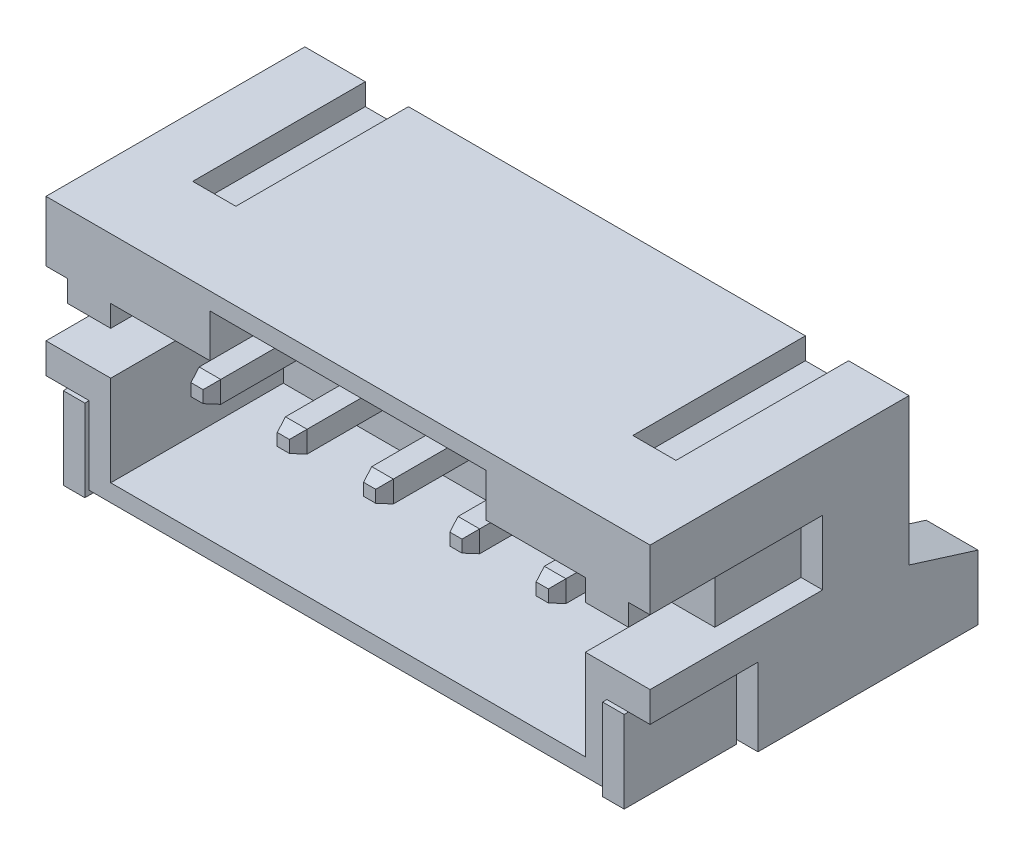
ISO-10303-21;
HEADER;
FILE_DESCRIPTION(('STEP AP214'),'2;1');
FILE_NAME('part.step','',(''),(''),'','','');
FILE_SCHEMA(('AUTOMOTIVE_DESIGN { 1 0 10303 214 1 1 1 1 }'));
ENDSEC;
DATA;
#1=APPLICATION_CONTEXT('core data for automotive mechanical design processes');
#2=APPLICATION_PROTOCOL_DEFINITION('international standard','automotive_design',2000,#1);
#3=PRODUCT_CONTEXT('',#1,'mechanical');
#4=PRODUCT('Part','Part','',(#3));
#5=PRODUCT_RELATED_PRODUCT_CATEGORY('part','',(#4));
#6=PRODUCT_DEFINITION_FORMATION('','',#4);
#7=PRODUCT_DEFINITION_CONTEXT('part definition',#1,'design');
#8=PRODUCT_DEFINITION('design','',#6,#7);
#9=PRODUCT_DEFINITION_SHAPE('','',#8);
#10=(LENGTH_UNIT() NAMED_UNIT(*) SI_UNIT(.MILLI.,.METRE.));
#11=(NAMED_UNIT(*) PLANE_ANGLE_UNIT() SI_UNIT($,.RADIAN.));
#12=(NAMED_UNIT(*) SI_UNIT($,.STERADIAN.) SOLID_ANGLE_UNIT());
#13=UNCERTAINTY_MEASURE_WITH_UNIT(LENGTH_MEASURE(1.E-05),#10,'distance_accuracy_value','');
#14=(GEOMETRIC_REPRESENTATION_CONTEXT(3) GLOBAL_UNCERTAINTY_ASSIGNED_CONTEXT((#13)) GLOBAL_UNIT_ASSIGNED_CONTEXT((#10,
#11,#12)) REPRESENTATION_CONTEXT('',''));
#15=CARTESIAN_POINT('',(0.,0.,0.));
#16=DIRECTION('',(0.,0.,1.));
#17=DIRECTION('',(1.,0.,0.));
#18=AXIS2_PLACEMENT_3D('',#15,#16,#17);
#19=CARTESIAN_POINT('',(7.,0.1,-7.6));
#20=DIRECTION('',(0.,0.,1.));
#21=DIRECTION('',(1.,0.,0.));
#22=AXIS2_PLACEMENT_3D('',#19,#20,#21);
#23=PLANE('',#22);
#24=DIRECTION('',(-1.,0.,0.));
#25=VECTOR('',#24,1.);
#26=CARTESIAN_POINT('',(7.,1.6,-7.6));
#27=LINE('',#26,#25);
#28=CARTESIAN_POINT('',(-5.8,1.6,-7.6));
#29=VERTEX_POINT('',#28);
#30=CARTESIAN_POINT('',(-7.,1.6,-7.6));
#31=VERTEX_POINT('',#30);
#32=EDGE_CURVE('E1620',#29,#31,#27,.T.);
#33=ORIENTED_EDGE('',*,*,#32,.F.);
#34=DIRECTION('',(0.,1.,0.));
#35=VECTOR('',#34,1.);
#36=CARTESIAN_POINT('',(-5.8,0.1,-7.6));
#37=LINE('',#36,#35);
#38=CARTESIAN_POINT('',(-5.8,0.1,-7.6));
#39=VERTEX_POINT('',#38);
#40=EDGE_CURVE('E1405',#39,#29,#37,.T.);
#41=ORIENTED_EDGE('',*,*,#40,.F.);
#42=DIRECTION('',(-1.,0.,0.));
#43=VECTOR('',#42,1.);
#44=CARTESIAN_POINT('',(7.,0.1,-7.6));
#45=LINE('',#44,#43);
#46=CARTESIAN_POINT('',(-7.,0.1,-7.6));
#47=VERTEX_POINT('',#46);
#48=EDGE_CURVE('E1624',#39,#47,#45,.T.);
#49=ORIENTED_EDGE('',*,*,#48,.T.);
#50=DIRECTION('',(0.,1.,0.));
#51=VECTOR('',#50,1.);
#52=CARTESIAN_POINT('',(-7.,0.1,-7.6));
#53=LINE('',#52,#51);
#54=EDGE_CURVE('E1582',#47,#31,#53,.T.);
#55=ORIENTED_EDGE('',*,*,#54,.T.);
#56=EDGE_LOOP('',(#33,#41,#49,#55));
#57=FACE_BOUND('',#56,.T.);
#58=ADVANCED_FACE('F31',(#57),#23,.F.);
#59=CARTESIAN_POINT('',(7.,1.6,-7.6));
#60=DIRECTION('',(0.,-0.95447997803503,0.298274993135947));
#61=DIRECTION('',(0.,-0.298274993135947,-0.95447997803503));
#62=AXIS2_PLACEMENT_3D('',#59,#60,#61);
#63=PLANE('',#62);
#64=DIRECTION('',(-1.,0.,0.));
#65=VECTOR('',#64,1.);
#66=CARTESIAN_POINT('',(7.,2.1,-6.));
#67=LINE('',#66,#65);
#68=CARTESIAN_POINT('',(-5.8,2.1,-6.));
#69=VERTEX_POINT('',#68);
#70=CARTESIAN_POINT('',(-7.,2.1,-6.));
#71=VERTEX_POINT('',#70);
#72=EDGE_CURVE('E1616',#69,#71,#67,.T.);
#73=ORIENTED_EDGE('',*,*,#72,.F.);
#74=DIRECTION('',(0.,-0.298274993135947,-0.95447997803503));
#75=VECTOR('',#74,1.);
#76=CARTESIAN_POINT('',(-5.8,1.6,-7.6));
#77=LINE('',#76,#75);
#78=EDGE_CURVE('E1416',#69,#29,#77,.T.);
#79=ORIENTED_EDGE('',*,*,#78,.T.);
#80=ORIENTED_EDGE('',*,*,#32,.T.);
#81=DIRECTION('',(0.,0.298274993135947,0.95447997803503));
#82=VECTOR('',#81,1.);
#83=CARTESIAN_POINT('',(-7.,1.6,-7.6));
#84=LINE('',#83,#82);
#85=EDGE_CURVE('E1585',#31,#71,#84,.T.);
#86=ORIENTED_EDGE('',*,*,#85,.T.);
#87=EDGE_LOOP('',(#73,#79,#80,#86));
#88=FACE_BOUND('',#87,.T.);
#89=ADVANCED_FACE('F1910',(#88),#63,.F.);
#90=CARTESIAN_POINT('',(7.,3.6,0.));
#91=DIRECTION('',(0.,1.,0.));
#92=DIRECTION('',(0.,0.,1.));
#93=AXIS2_PLACEMENT_3D('',#90,#91,#92);
#94=PLANE('',#93);
#95=DIRECTION('',(-1.,0.,0.));
#96=VECTOR('',#95,1.);
#97=CARTESIAN_POINT('',(7.,3.6,0.));
#98=LINE('',#97,#96);
#99=CARTESIAN_POINT('',(-5.5,3.6,0.));
#100=VERTEX_POINT('',#99);
#101=CARTESIAN_POINT('',(-6.5,3.6,0.));
#102=VERTEX_POINT('',#101);
#103=EDGE_CURVE('E1606',#100,#102,#98,.T.);
#104=ORIENTED_EDGE('',*,*,#103,.T.);
#105=DIRECTION('',(0.,0.,-1.));
#106=VECTOR('',#105,1.);
#107=CARTESIAN_POINT('',(-6.5,3.6,0.));
#108=LINE('',#107,#106);
#109=CARTESIAN_POINT('',(-6.5,3.6,-2.));
#110=VERTEX_POINT('',#109);
#111=EDGE_CURVE('E1475',#102,#110,#108,.T.);
#112=ORIENTED_EDGE('',*,*,#111,.T.);
#113=DIRECTION('',(-1.,0.,0.));
#114=VECTOR('',#113,1.);
#115=CARTESIAN_POINT('',(7.,3.6,-2.));
#116=LINE('',#115,#114);
#117=CARTESIAN_POINT('',(-5.5,3.6,-2.));
#118=VERTEX_POINT('',#117);
#119=EDGE_CURVE('E1603',#118,#110,#116,.T.);
#120=ORIENTED_EDGE('',*,*,#119,.F.);
#121=DIRECTION('',(0.,0.,1.));
#122=VECTOR('',#121,1.);
#123=CARTESIAN_POINT('',(-5.5,3.6,0.));
#124=LINE('',#123,#122);
#125=EDGE_CURVE('E1554',#118,#100,#124,.T.);
#126=ORIENTED_EDGE('',*,*,#125,.T.);
#127=EDGE_LOOP('',(#104,#112,#120,#126));
#128=FACE_BOUND('',#127,.T.);
#129=ADVANCED_FACE('F1917',(#128),#94,.F.);
#130=CARTESIAN_POINT('',(7.,3.6,-2.));
#131=DIRECTION('',(0.,0.,-1.));
#132=DIRECTION('',(-1.,0.,0.));
#133=AXIS2_PLACEMENT_3D('',#130,#131,#132);
#134=PLANE('',#133);
#135=ORIENTED_EDGE('',*,*,#119,.T.);
#136=DIRECTION('',(0.,-1.,0.));
#137=VECTOR('',#136,1.);
#138=CARTESIAN_POINT('',(-6.5,3.60000000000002,-2.));
#139=LINE('',#138,#137);
#140=CARTESIAN_POINT('',(-6.5,2.6,-2.));
#141=VERTEX_POINT('',#140);
#142=EDGE_CURVE('E1468',#110,#141,#139,.T.);
#143=ORIENTED_EDGE('',*,*,#142,.T.);
#144=DIRECTION('',(-1.,0.,0.));
#145=VECTOR('',#144,1.);
#146=CARTESIAN_POINT('',(7.,2.6,-2.));
#147=LINE('',#146,#145);
#148=CARTESIAN_POINT('',(-5.5,2.6,-2.));
#149=VERTEX_POINT('',#148);
#150=EDGE_CURVE('E1600',#149,#141,#147,.T.);
#151=ORIENTED_EDGE('',*,*,#150,.F.);
#152=DIRECTION('',(0.,1.,0.));
#153=VECTOR('',#152,1.);
#154=CARTESIAN_POINT('',(-5.5,3.6,-2.));
#155=LINE('',#154,#153);
#156=EDGE_CURVE('E1551',#149,#118,#155,.T.);
#157=ORIENTED_EDGE('',*,*,#156,.T.);
#158=EDGE_LOOP('',(#135,#143,#151,#157));
#159=FACE_BOUND('',#158,.T.);
#160=ADVANCED_FACE('F2137',(#159),#134,.F.);
#161=CARTESIAN_POINT('',(7.,2.6,0.));
#162=DIRECTION('',(0.,-1.,0.));
#163=DIRECTION('',(0.,0.,-1.));
#164=AXIS2_PLACEMENT_3D('',#161,#162,#163);
#165=PLANE('',#164);
#166=ORIENTED_EDGE('',*,*,#150,.T.);
#167=DIRECTION('',(0.,0.,1.));
#168=VECTOR('',#167,1.);
#169=CARTESIAN_POINT('',(-6.5,2.6,-4.));
#170=LINE('',#169,#168);
#171=CARTESIAN_POINT('',(-6.5,2.6,-4.));
#172=VERTEX_POINT('',#171);
#173=EDGE_CURVE('E1462',#172,#141,#170,.T.);
#174=ORIENTED_EDGE('',*,*,#173,.F.);
#175=DIRECTION('',(1.,0.,0.));
#176=VECTOR('',#175,1.);
#177=CARTESIAN_POINT('',(-7.,2.6,-4.));
#178=LINE('',#177,#176);
#179=CARTESIAN_POINT('',(-7.,2.6,-4.));
#180=VERTEX_POINT('',#179);
#181=EDGE_CURVE('E1453',#180,#172,#178,.T.);
#182=ORIENTED_EDGE('',*,*,#181,.F.);
#183=DIRECTION('',(0.,0.,1.));
#184=VECTOR('',#183,1.);
#185=CARTESIAN_POINT('',(-7.,2.6,0.));
#186=LINE('',#185,#184);
#187=CARTESIAN_POINT('',(-7.,2.6,0.));
#188=VERTEX_POINT('',#187);
#189=EDGE_CURVE('E1562',#180,#188,#186,.T.);
#190=ORIENTED_EDGE('',*,*,#189,.T.);
#191=DIRECTION('',(-1.,0.,0.));
#192=VECTOR('',#191,1.);
#193=CARTESIAN_POINT('',(7.,2.6,0.));
#194=LINE('',#193,#192);
#195=CARTESIAN_POINT('',(-5.5,2.6,0.));
#196=VERTEX_POINT('',#195);
#197=EDGE_CURVE('E1577',#196,#188,#194,.T.);
#198=ORIENTED_EDGE('',*,*,#197,.F.);
#199=DIRECTION('',(0.,0.,-1.));
#200=VECTOR('',#199,1.);
#201=CARTESIAN_POINT('',(-5.5,2.6,0.));
#202=LINE('',#201,#200);
#203=EDGE_CURVE('E1633',#196,#149,#202,.T.);
#204=ORIENTED_EDGE('',*,*,#203,.T.);
#205=EDGE_LOOP('',(#166,#174,#182,#190,#198,#204));
#206=FACE_BOUND('',#205,.T.);
#207=ADVANCED_FACE('F2132',(#206),#165,.F.);
#208=CARTESIAN_POINT('',(7.,0.1,0.));
#209=DIRECTION('',(0.,0.,-1.));
#210=DIRECTION('',(-1.,0.,0.));
#211=AXIS2_PLACEMENT_3D('',#208,#209,#210);
#212=PLANE('',#211);
#213=DIRECTION('',(0.,1.,0.));
#214=VECTOR('',#213,1.);
#215=CARTESIAN_POINT('',(6.,0.1,0.));
#216=LINE('',#215,#214);
#217=CARTESIAN_POINT('',(6.,0.1,0.));
#218=VERTEX_POINT('',#217);
#219=CARTESIAN_POINT('',(6.,1.9,0.));
#220=VERTEX_POINT('',#219);
#221=EDGE_CURVE('E1252',#218,#220,#216,.T.);
#222=ORIENTED_EDGE('',*,*,#221,.T.);
#223=DIRECTION('',(1.,0.,0.));
#224=VECTOR('',#223,1.);
#225=CARTESIAN_POINT('',(7.,1.9,0.));
#226=LINE('',#225,#224);
#227=CARTESIAN_POINT('',(6.5,1.9,0.));
#228=VERTEX_POINT('',#227);
#229=EDGE_CURVE('E1244',#220,#228,#226,.T.);
#230=ORIENTED_EDGE('',*,*,#229,.T.);
#231=DIRECTION('',(-1.,0.,0.));
#232=VECTOR('',#231,1.);
#233=CARTESIAN_POINT('',(7.,1.9,0.));
#234=LINE('',#233,#232);
#235=CARTESIAN_POINT('',(7.,1.9,0.));
#236=VERTEX_POINT('',#235);
#237=EDGE_CURVE('E1367',#236,#228,#234,.T.);
#238=ORIENTED_EDGE('',*,*,#237,.F.);
#239=DIRECTION('',(0.,-1.,0.));
#240=VECTOR('',#239,1.);
#241=CARTESIAN_POINT('',(7.,0.1,0.));
#242=LINE('',#241,#240);
#243=CARTESIAN_POINT('',(7.,2.6,0.));
#244=VERTEX_POINT('',#243);
#245=EDGE_CURVE('E1558',#244,#236,#242,.T.);
#246=ORIENTED_EDGE('',*,*,#245,.F.);
#247=CARTESIAN_POINT('',(5.5,2.6,0.));
#248=VERTEX_POINT('',#247);
#249=EDGE_CURVE('E1598',#244,#248,#194,.T.);
#250=ORIENTED_EDGE('',*,*,#249,.T.);
#251=DIRECTION('',(0.,1.,0.));
#252=VECTOR('',#251,1.);
#253=CARTESIAN_POINT('',(5.5,0.5,0.));
#254=LINE('',#253,#252);
#255=CARTESIAN_POINT('',(5.5,0.5,0.));
#256=VERTEX_POINT('',#255);
#257=EDGE_CURVE('E1511',#256,#248,#254,.T.);
#258=ORIENTED_EDGE('',*,*,#257,.F.);
#259=DIRECTION('',(1.,0.,0.));
#260=VECTOR('',#259,1.);
#261=CARTESIAN_POINT('',(-5.5,0.5,0.));
#262=LINE('',#261,#260);
#263=CARTESIAN_POINT('',(-5.5,0.5,0.));
#264=VERTEX_POINT('',#263);
#265=EDGE_CURVE('E1507',#264,#256,#262,.T.);
#266=ORIENTED_EDGE('',*,*,#265,.F.);
#267=DIRECTION('',(0.,-1.,0.));
#268=VECTOR('',#267,1.);
#269=CARTESIAN_POINT('',(-5.5,0.5,0.));
#270=LINE('',#269,#268);
#271=EDGE_CURVE('E1478',#196,#264,#270,.T.);
#272=ORIENTED_EDGE('',*,*,#271,.F.);
#273=ORIENTED_EDGE('',*,*,#197,.T.);
#274=DIRECTION('',(0.,-1.,0.));
#275=VECTOR('',#274,1.);
#276=CARTESIAN_POINT('',(-7.,0.1,0.));
#277=LINE('',#276,#275);
#278=CARTESIAN_POINT('',(-7.,1.9,0.));
#279=VERTEX_POINT('',#278);
#280=EDGE_CURVE('E1557',#188,#279,#277,.T.);
#281=ORIENTED_EDGE('',*,*,#280,.T.);
#282=DIRECTION('',(-1.,0.,0.));
#283=VECTOR('',#282,1.);
#284=CARTESIAN_POINT('',(-7.,1.9,0.));
#285=LINE('',#284,#283);
#286=CARTESIAN_POINT('',(-6.5,1.9,0.));
#287=VERTEX_POINT('',#286);
#288=EDGE_CURVE('E1381',#287,#279,#285,.T.);
#289=ORIENTED_EDGE('',*,*,#288,.F.);
#290=CARTESIAN_POINT('',(-6.,1.9,0.));
#291=VERTEX_POINT('',#290);
#292=EDGE_CURVE('E1385',#291,#287,#285,.T.);
#293=ORIENTED_EDGE('',*,*,#292,.F.);
#294=DIRECTION('',(0.,-1.,0.));
#295=VECTOR('',#294,1.);
#296=CARTESIAN_POINT('',(-6.,0.1,0.));
#297=LINE('',#296,#295);
#298=CARTESIAN_POINT('',(-6.,0.1,0.));
#299=VERTEX_POINT('',#298);
#300=EDGE_CURVE('E1279',#291,#299,#297,.T.);
#301=ORIENTED_EDGE('',*,*,#300,.T.);
#302=DIRECTION('',(-1.,0.,0.));
#303=VECTOR('',#302,1.);
#304=CARTESIAN_POINT('',(7.,0.1,0.));
#305=LINE('',#304,#303);
#306=EDGE_CURVE('E1628',#218,#299,#305,.T.);
#307=ORIENTED_EDGE('',*,*,#306,.F.);
#308=EDGE_LOOP('',(#222,#230,#238,#246,#250,#258,#266,#272,#273,#281,#289,#293,#301,#307));
#309=FACE_BOUND('',#308,.T.);
#310=ADVANCED_FACE('F1931',(#309),#212,.F.);
#311=CARTESIAN_POINT('',(7.,0.1,0.));
#312=DIRECTION('',(0.,1.,0.));
#313=DIRECTION('',(0.,0.,1.));
#314=AXIS2_PLACEMENT_3D('',#311,#312,#313);
#315=PLANE('',#314);
#316=DIRECTION('',(1.,0.,0.));
#317=VECTOR('',#316,1.);
#318=CARTESIAN_POINT('',(7.,0.1,-2.5));
#319=LINE('',#318,#317);
#320=CARTESIAN_POINT('',(6.,0.1,-2.5));
#321=VERTEX_POINT('',#320);
#322=CARTESIAN_POINT('',(6.5,0.1,-2.5));
#323=VERTEX_POINT('',#322);
#324=EDGE_CURVE('E1371',#321,#323,#319,.T.);
#325=ORIENTED_EDGE('',*,*,#324,.F.);
#326=DIRECTION('',(0.,0.,1.));
#327=VECTOR('',#326,1.);
#328=CARTESIAN_POINT('',(6.,0.1,0.));
#329=LINE('',#328,#327);
#330=EDGE_CURVE('E1686',#321,#218,#329,.T.);
#331=ORIENTED_EDGE('',*,*,#330,.T.);
#332=ORIENTED_EDGE('',*,*,#306,.T.);
#333=DIRECTION('',(0.,0.,-1.));
#334=VECTOR('',#333,1.);
#335=CARTESIAN_POINT('',(-6.,0.1,0.));
#336=LINE('',#335,#334);
#337=CARTESIAN_POINT('',(-6.,0.1,-2.5));
#338=VERTEX_POINT('',#337);
#339=EDGE_CURVE('E1672',#299,#338,#336,.T.);
#340=ORIENTED_EDGE('',*,*,#339,.T.);
#341=DIRECTION('',(1.,0.,0.));
#342=VECTOR('',#341,1.);
#343=CARTESIAN_POINT('',(-7.,0.1,-2.5));
#344=LINE('',#343,#342);
#345=CARTESIAN_POINT('',(-6.5,0.1,-2.5));
#346=VERTEX_POINT('',#345);
#347=EDGE_CURVE('E1384',#346,#338,#344,.T.);
#348=ORIENTED_EDGE('',*,*,#347,.F.);
#349=CARTESIAN_POINT('',(-7.,0.1,-2.5));
#350=VERTEX_POINT('',#349);
#351=EDGE_CURVE('E1386',#350,#346,#344,.T.);
#352=ORIENTED_EDGE('',*,*,#351,.F.);
#353=DIRECTION('',(0.,0.,-1.));
#354=VECTOR('',#353,1.);
#355=CARTESIAN_POINT('',(-7.,0.1,0.));
#356=LINE('',#355,#354);
#357=EDGE_CURVE('E1580',#350,#47,#356,.T.);
#358=ORIENTED_EDGE('',*,*,#357,.T.);
#359=ORIENTED_EDGE('',*,*,#48,.F.);
#360=DIRECTION('',(0.,0.,1.));
#361=VECTOR('',#360,1.);
#362=CARTESIAN_POINT('',(-5.8,0.1,-6.));
#363=LINE('',#362,#361);
#364=CARTESIAN_POINT('',(-5.8,0.1,-6.));
#365=VERTEX_POINT('',#364);
#366=EDGE_CURVE('E1395',#39,#365,#363,.T.);
#367=ORIENTED_EDGE('',*,*,#366,.T.);
#368=DIRECTION('',(1.,0.,0.));
#369=VECTOR('',#368,1.);
#370=CARTESIAN_POINT('',(-5.8,0.1,-6.));
#371=LINE('',#370,#369);
#372=CARTESIAN_POINT('',(5.8,0.1,-6.));
#373=VERTEX_POINT('',#372);
#374=EDGE_CURVE('E1398',#365,#373,#371,.T.);
#375=ORIENTED_EDGE('',*,*,#374,.T.);
#376=DIRECTION('',(0.,0.,-1.));
#377=VECTOR('',#376,1.);
#378=CARTESIAN_POINT('',(5.8,0.1,-6.));
#379=LINE('',#378,#377);
#380=CARTESIAN_POINT('',(5.8,0.1,-7.6));
#381=VERTEX_POINT('',#380);
#382=EDGE_CURVE('E1401',#373,#381,#379,.T.);
#383=ORIENTED_EDGE('',*,*,#382,.T.);
#384=CARTESIAN_POINT('',(7.,0.1,-7.6));
#385=VERTEX_POINT('',#384);
#386=EDGE_CURVE('E1625',#385,#381,#45,.T.);
#387=ORIENTED_EDGE('',*,*,#386,.F.);
#388=DIRECTION('',(0.,0.,-1.));
#389=VECTOR('',#388,1.);
#390=CARTESIAN_POINT('',(7.,0.1,0.));
#391=LINE('',#390,#389);
#392=CARTESIAN_POINT('',(7.,0.1,-2.5));
#393=VERTEX_POINT('',#392);
#394=EDGE_CURVE('E1561',#393,#385,#391,.T.);
#395=ORIENTED_EDGE('',*,*,#394,.F.);
#396=EDGE_CURVE('E1370',#323,#393,#319,.T.);
#397=ORIENTED_EDGE('',*,*,#396,.F.);
#398=EDGE_LOOP('',(#325,#331,#332,#340,#348,#352,#358,#359,#367,#375,#383,#387,#395,#397));
#399=FACE_BOUND('',#398,.T.);
#400=ADVANCED_FACE('F1924',(#399),#315,.F.);
#401=ORIENTED_EDGE('',*,*,#386,.T.);
#402=DIRECTION('',(0.,1.,0.));
#403=VECTOR('',#402,1.);
#404=CARTESIAN_POINT('',(5.8,0.1,-7.6));
#405=LINE('',#404,#403);
#406=CARTESIAN_POINT('',(5.8,1.6,-7.6));
#407=VERTEX_POINT('',#406);
#408=EDGE_CURVE('E1408',#381,#407,#405,.T.);
#409=ORIENTED_EDGE('',*,*,#408,.T.);
#410=CARTESIAN_POINT('',(7.,1.6,-7.6));
#411=VERTEX_POINT('',#410);
#412=EDGE_CURVE('E1621',#411,#407,#27,.T.);
#413=ORIENTED_EDGE('',*,*,#412,.F.);
#414=DIRECTION('',(0.,1.,0.));
#415=VECTOR('',#414,1.);
#416=CARTESIAN_POINT('',(7.,0.1,-7.6));
#417=LINE('',#416,#415);
#418=EDGE_CURVE('E1564',#385,#411,#417,.T.);
#419=ORIENTED_EDGE('',*,*,#418,.F.);
#420=EDGE_LOOP('',(#401,#409,#413,#419));
#421=FACE_BOUND('',#420,.T.);
#422=ADVANCED_FACE('F1913',(#421),#23,.F.);
#423=ORIENTED_EDGE('',*,*,#412,.T.);
#424=DIRECTION('',(0.,0.298274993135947,0.95447997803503));
#425=VECTOR('',#424,1.);
#426=CARTESIAN_POINT('',(5.8,1.6,-7.6));
#427=LINE('',#426,#425);
#428=CARTESIAN_POINT('',(5.8,2.1,-6.));
#429=VERTEX_POINT('',#428);
#430=EDGE_CURVE('E1407',#407,#429,#427,.T.);
#431=ORIENTED_EDGE('',*,*,#430,.T.);
#432=CARTESIAN_POINT('',(7.,2.1,-6.));
#433=VERTEX_POINT('',#432);
#434=EDGE_CURVE('E1617',#433,#429,#67,.T.);
#435=ORIENTED_EDGE('',*,*,#434,.F.);
#436=DIRECTION('',(0.,0.298274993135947,0.95447997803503));
#437=VECTOR('',#436,1.);
#438=CARTESIAN_POINT('',(7.,1.6,-7.6));
#439=LINE('',#438,#437);
#440=EDGE_CURVE('E1566',#411,#433,#439,.T.);
#441=ORIENTED_EDGE('',*,*,#440,.F.);
#442=EDGE_LOOP('',(#423,#431,#435,#441));
#443=FACE_BOUND('',#442,.T.);
#444=ADVANCED_FACE('F1920',(#443),#63,.F.);
#445=CARTESIAN_POINT('',(7.,2.1,-6.));
#446=DIRECTION('',(0.,0.,1.));
#447=DIRECTION('',(1.,0.,0.));
#448=AXIS2_PLACEMENT_3D('',#445,#446,#447);
#449=PLANE('',#448);
#450=DIRECTION('',(-1.,0.,0.));
#451=VECTOR('',#450,1.);
#452=CARTESIAN_POINT('',(5.6,5.,-6.));
#453=LINE('',#452,#451);
#454=CARTESIAN_POINT('',(5.6,5.,-6.));
#455=VERTEX_POINT('',#454);
#456=CARTESIAN_POINT('',(4.6,5.,-6.));
#457=VERTEX_POINT('',#456);
#458=EDGE_CURVE('E860',#455,#457,#453,.T.);
#459=ORIENTED_EDGE('',*,*,#458,.F.);
#460=DIRECTION('',(0.,1.,0.));
#461=VECTOR('',#460,1.);
#462=CARTESIAN_POINT('',(5.6,5.,-6.));
#463=LINE('',#462,#461);
#464=CARTESIAN_POINT('',(5.6,5.5,-6.));
#465=VERTEX_POINT('',#464);
#466=EDGE_CURVE('E898',#455,#465,#463,.T.);
#467=ORIENTED_EDGE('',*,*,#466,.T.);
#468=DIRECTION('',(-1.,0.,0.));
#469=VECTOR('',#468,1.);
#470=CARTESIAN_POINT('',(7.,5.5,-6.));
#471=LINE('',#470,#469);
#472=CARTESIAN_POINT('',(7.,5.5,-6.));
#473=VERTEX_POINT('',#472);
#474=EDGE_CURVE('E1613',#473,#465,#471,.T.);
#475=ORIENTED_EDGE('',*,*,#474,.F.);
#476=DIRECTION('',(0.,1.,0.));
#477=VECTOR('',#476,1.);
#478=CARTESIAN_POINT('',(7.,2.1,-6.));
#479=LINE('',#478,#477);
#480=EDGE_CURVE('E1568',#433,#473,#479,.T.);
#481=ORIENTED_EDGE('',*,*,#480,.F.);
#482=ORIENTED_EDGE('',*,*,#434,.T.);
#483=DIRECTION('',(0.,1.,0.));
#484=VECTOR('',#483,1.);
#485=CARTESIAN_POINT('',(5.8,0.1,-6.));
#486=LINE('',#485,#484);
#487=EDGE_CURVE('E1411',#373,#429,#486,.T.);
#488=ORIENTED_EDGE('',*,*,#487,.F.);
#489=ORIENTED_EDGE('',*,*,#374,.F.);
#490=DIRECTION('',(0.,1.,0.));
#491=VECTOR('',#490,1.);
#492=CARTESIAN_POINT('',(-5.8,0.1,-6.));
#493=LINE('',#492,#491);
#494=EDGE_CURVE('E1404',#365,#69,#493,.T.);
#495=ORIENTED_EDGE('',*,*,#494,.T.);
#496=ORIENTED_EDGE('',*,*,#72,.T.);
#497=DIRECTION('',(0.,1.,0.));
#498=VECTOR('',#497,1.);
#499=CARTESIAN_POINT('',(-7.,2.1,-6.));
#500=LINE('',#499,#498);
#501=CARTESIAN_POINT('',(-7.,5.5,-6.));
#502=VERTEX_POINT('',#501);
#503=EDGE_CURVE('E1588',#71,#502,#500,.T.);
#504=ORIENTED_EDGE('',*,*,#503,.T.);
#505=CARTESIAN_POINT('',(-5.6,5.5,-6.));
#506=VERTEX_POINT('',#505);
#507=EDGE_CURVE('E1612',#506,#502,#471,.T.);
#508=ORIENTED_EDGE('',*,*,#507,.F.);
#509=DIRECTION('',(0.,1.,0.));
#510=VECTOR('',#509,1.);
#511=CARTESIAN_POINT('',(-5.6,5.,-6.));
#512=LINE('',#511,#510);
#513=CARTESIAN_POINT('',(-5.6,5.,-6.));
#514=VERTEX_POINT('',#513);
#515=EDGE_CURVE('E903',#514,#506,#512,.T.);
#516=ORIENTED_EDGE('',*,*,#515,.F.);
#517=DIRECTION('',(-1.,0.,0.));
#518=VECTOR('',#517,1.);
#519=CARTESIAN_POINT('',(-5.6,5.,-6.));
#520=LINE('',#519,#518);
#521=CARTESIAN_POINT('',(-4.6,5.,-6.));
#522=VERTEX_POINT('',#521);
#523=EDGE_CURVE('E892',#522,#514,#520,.T.);
#524=ORIENTED_EDGE('',*,*,#523,.F.);
#525=DIRECTION('',(0.,1.,0.));
#526=VECTOR('',#525,1.);
#527=CARTESIAN_POINT('',(-4.6,5.,-6.));
#528=LINE('',#527,#526);
#529=CARTESIAN_POINT('',(-4.6,5.5,-6.));
#530=VERTEX_POINT('',#529);
#531=EDGE_CURVE('E906',#522,#530,#528,.T.);
#532=ORIENTED_EDGE('',*,*,#531,.T.);
#533=CARTESIAN_POINT('',(4.6,5.5,-6.));
#534=VERTEX_POINT('',#533);
#535=EDGE_CURVE('E875',#534,#530,#471,.T.);
#536=ORIENTED_EDGE('',*,*,#535,.F.);
#537=DIRECTION('',(0.,1.,0.));
#538=VECTOR('',#537,1.);
#539=CARTESIAN_POINT('',(4.6,5.,-6.));
#540=LINE('',#539,#538);
#541=EDGE_CURVE('E48',#457,#534,#540,.T.);
#542=ORIENTED_EDGE('',*,*,#541,.F.);
#543=EDGE_LOOP('',(#459,#467,#475,#481,#482,#488,#489,#495,#496,#504,#508,#516,#524,#532,#536,#542));
#544=FACE_BOUND('',#543,.T.);
#545=DIRECTION('',(1.,0.,0.));
#546=VECTOR('',#545,1.);
#547=CARTESIAN_POINT('',(3.75,2.96651513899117,-6.));
#548=LINE('',#547,#546);
#549=CARTESIAN_POINT('',(3.75,2.96651513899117,-6.));
#550=VERTEX_POINT('',#549);
#551=CARTESIAN_POINT('',(4.25,2.96651513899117,-6.));
#552=VERTEX_POINT('',#551);
#553=EDGE_CURVE('E1757',#550,#552,#548,.T.);
#554=ORIENTED_EDGE('',*,*,#553,.F.);
#555=DIRECTION('',(0.,-1.,0.));
#556=VECTOR('',#555,1.);
#557=CARTESIAN_POINT('',(3.75,2.1,-6.));
#558=LINE('',#557,#556);
#559=CARTESIAN_POINT('',(3.75,2.35,-6.));
#560=VERTEX_POINT('',#559);
#561=EDGE_CURVE('E987',#550,#560,#558,.T.);
#562=ORIENTED_EDGE('',*,*,#561,.T.);
#563=DIRECTION('',(1.,0.,0.));
#564=VECTOR('',#563,1.);
#565=CARTESIAN_POINT('',(3.75,2.35,-6.));
#566=LINE('',#565,#564);
#567=CARTESIAN_POINT('',(4.25,2.35,-6.));
#568=VERTEX_POINT('',#567);
#569=EDGE_CURVE('E1754',#568,#560,#566,.F.);
#570=ORIENTED_EDGE('',*,*,#569,.F.);
#571=DIRECTION('',(0.,-1.,0.));
#572=VECTOR('',#571,1.);
#573=CARTESIAN_POINT('',(4.25,2.1,-6.));
#574=LINE('',#573,#572);
#575=EDGE_CURVE('E984',#552,#568,#574,.T.);
#576=ORIENTED_EDGE('',*,*,#575,.F.);
#577=EDGE_LOOP('',(#554,#562,#570,#576));
#578=FACE_BOUND('',#577,.T.);
#579=DIRECTION('',(1.,0.,0.));
#580=VECTOR('',#579,1.);
#581=CARTESIAN_POINT('',(1.75,2.96651513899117,-6.));
#582=LINE('',#581,#580);
#583=CARTESIAN_POINT('',(1.75,2.96651513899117,-6.));
#584=VERTEX_POINT('',#583);
#585=CARTESIAN_POINT('',(2.25,2.96651513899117,-6.));
#586=VERTEX_POINT('',#585);
#587=EDGE_CURVE('E1739',#584,#586,#582,.T.);
#588=ORIENTED_EDGE('',*,*,#587,.F.);
#589=DIRECTION('',(0.,-1.,0.));
#590=VECTOR('',#589,1.);
#591=CARTESIAN_POINT('',(1.75,2.1,-6.));
#592=LINE('',#591,#590);
#593=CARTESIAN_POINT('',(1.75,2.35,-6.));
#594=VERTEX_POINT('',#593);
#595=EDGE_CURVE('E1064',#584,#594,#592,.T.);
#596=ORIENTED_EDGE('',*,*,#595,.T.);
#597=DIRECTION('',(1.,0.,0.));
#598=VECTOR('',#597,1.);
#599=CARTESIAN_POINT('',(1.75,2.35,-6.));
#600=LINE('',#599,#598);
#601=CARTESIAN_POINT('',(2.25,2.35,-6.));
#602=VERTEX_POINT('',#601);
#603=EDGE_CURVE('E1736',#602,#594,#600,.F.);
#604=ORIENTED_EDGE('',*,*,#603,.F.);
#605=DIRECTION('',(0.,-1.,0.));
#606=VECTOR('',#605,1.);
#607=CARTESIAN_POINT('',(2.25,2.1,-6.));
#608=LINE('',#607,#606);
#609=EDGE_CURVE('E1061',#586,#602,#608,.T.);
#610=ORIENTED_EDGE('',*,*,#609,.F.);
#611=EDGE_LOOP('',(#588,#596,#604,#610));
#612=FACE_BOUND('',#611,.T.);
#613=DIRECTION('',(1.,0.,0.));
#614=VECTOR('',#613,1.);
#615=CARTESIAN_POINT('',(-0.25,2.96651513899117,-6.));
#616=LINE('',#615,#614);
#617=CARTESIAN_POINT('',(-0.25,2.96651513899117,-6.));
#618=VERTEX_POINT('',#617);
#619=CARTESIAN_POINT('',(0.25,2.96651513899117,-6.));
#620=VERTEX_POINT('',#619);
#621=EDGE_CURVE('E1721',#618,#620,#616,.T.);
#622=ORIENTED_EDGE('',*,*,#621,.F.);
#623=DIRECTION('',(0.,-1.,0.));
#624=VECTOR('',#623,1.);
#625=CARTESIAN_POINT('',(-0.25,2.1,-6.));
#626=LINE('',#625,#624);
#627=CARTESIAN_POINT('',(-0.25,2.35,-6.));
#628=VERTEX_POINT('',#627);
#629=EDGE_CURVE('E1141',#618,#628,#626,.T.);
#630=ORIENTED_EDGE('',*,*,#629,.T.);
#631=DIRECTION('',(1.,0.,0.));
#632=VECTOR('',#631,1.);
#633=CARTESIAN_POINT('',(-0.25,2.35,-6.));
#634=LINE('',#633,#632);
#635=CARTESIAN_POINT('',(0.25,2.35,-6.));
#636=VERTEX_POINT('',#635);
#637=EDGE_CURVE('E1718',#636,#628,#634,.F.);
#638=ORIENTED_EDGE('',*,*,#637,.F.);
#639=DIRECTION('',(0.,-1.,0.));
#640=VECTOR('',#639,1.);
#641=CARTESIAN_POINT('',(0.25,2.1,-6.));
#642=LINE('',#641,#640);
#643=EDGE_CURVE('E1138',#620,#636,#642,.T.);
#644=ORIENTED_EDGE('',*,*,#643,.F.);
#645=EDGE_LOOP('',(#622,#630,#638,#644));
#646=FACE_BOUND('',#645,.T.);
#647=DIRECTION('',(1.,0.,0.));
#648=VECTOR('',#647,1.);
#649=CARTESIAN_POINT('',(-2.25,2.96651513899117,-6.));
#650=LINE('',#649,#648);
#651=CARTESIAN_POINT('',(-2.25,2.96651513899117,-6.));
#652=VERTEX_POINT('',#651);
#653=CARTESIAN_POINT('',(-1.75,2.96651513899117,-6.));
#654=VERTEX_POINT('',#653);
#655=EDGE_CURVE('E1703',#652,#654,#650,.T.);
#656=ORIENTED_EDGE('',*,*,#655,.F.);
#657=DIRECTION('',(0.,-1.,0.));
#658=VECTOR('',#657,1.);
#659=CARTESIAN_POINT('',(-2.25,2.1,-6.));
#660=LINE('',#659,#658);
#661=CARTESIAN_POINT('',(-2.25,2.35,-6.));
#662=VERTEX_POINT('',#661);
#663=EDGE_CURVE('E1218',#652,#662,#660,.T.);
#664=ORIENTED_EDGE('',*,*,#663,.T.);
#665=DIRECTION('',(1.,0.,0.));
#666=VECTOR('',#665,1.);
#667=CARTESIAN_POINT('',(-2.25,2.35,-6.));
#668=LINE('',#667,#666);
#669=CARTESIAN_POINT('',(-1.75,2.35,-6.));
#670=VERTEX_POINT('',#669);
#671=EDGE_CURVE('E1700',#670,#662,#668,.F.);
#672=ORIENTED_EDGE('',*,*,#671,.F.);
#673=DIRECTION('',(0.,-1.,0.));
#674=VECTOR('',#673,1.);
#675=CARTESIAN_POINT('',(-1.75,2.1,-6.));
#676=LINE('',#675,#674);
#677=EDGE_CURVE('E1215',#654,#670,#676,.T.);
#678=ORIENTED_EDGE('',*,*,#677,.F.);
#679=EDGE_LOOP('',(#656,#664,#672,#678));
#680=FACE_BOUND('',#679,.T.);
#681=DIRECTION('',(1.,0.,0.));
#682=VECTOR('',#681,1.);
#683=CARTESIAN_POINT('',(-4.25,2.96651513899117,-6.));
#684=LINE('',#683,#682);
#685=CARTESIAN_POINT('',(-4.25,2.96651513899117,-6.));
#686=VERTEX_POINT('',#685);
#687=CARTESIAN_POINT('',(-3.75,2.96651513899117,-6.));
#688=VERTEX_POINT('',#687);
#689=EDGE_CURVE('E1651',#686,#688,#684,.T.);
#690=ORIENTED_EDGE('',*,*,#689,.F.);
#691=DIRECTION('',(0.,-1.,0.));
#692=VECTOR('',#691,1.);
#693=CARTESIAN_POINT('',(-4.25,2.1,-6.));
#694=LINE('',#693,#692);
#695=CARTESIAN_POINT('',(-4.25,2.35,-6.));
#696=VERTEX_POINT('',#695);
#697=EDGE_CURVE('E1365',#686,#696,#694,.T.);
#698=ORIENTED_EDGE('',*,*,#697,.T.);
#699=DIRECTION('',(1.,0.,0.));
#700=VECTOR('',#699,1.);
#701=CARTESIAN_POINT('',(-4.25,2.35,-6.));
#702=LINE('',#701,#700);
#703=CARTESIAN_POINT('',(-3.75,2.35,-6.));
#704=VERTEX_POINT('',#703);
#705=EDGE_CURVE('E1648',#704,#696,#702,.F.);
#706=ORIENTED_EDGE('',*,*,#705,.F.);
#707=DIRECTION('',(0.,-1.,0.));
#708=VECTOR('',#707,1.);
#709=CARTESIAN_POINT('',(-3.75,2.1,-6.));
#710=LINE('',#709,#708);
#711=EDGE_CURVE('E1362',#688,#704,#710,.T.);
#712=ORIENTED_EDGE('',*,*,#711,.F.);
#713=EDGE_LOOP('',(#690,#698,#706,#712));
#714=FACE_BOUND('',#713,.T.);
#715=ADVANCED_FACE('F872',(#544,#578,#612,#646,#680,#714),#449,.F.);
#716=CARTESIAN_POINT('',(7.,5.5,0.));
#717=DIRECTION('',(0.,-1.,0.));
#718=DIRECTION('',(0.,0.,-1.));
#719=AXIS2_PLACEMENT_3D('',#716,#717,#718);
#720=PLANE('',#719);
#721=ORIENTED_EDGE('',*,*,#474,.T.);
#722=DIRECTION('',(0.,0.,-1.));
#723=VECTOR('',#722,1.);
#724=CARTESIAN_POINT('',(5.6,5.5,-6.));
#725=LINE('',#724,#723);
#726=CARTESIAN_POINT('',(5.6,5.5,-2.));
#727=VERTEX_POINT('',#726);
#728=EDGE_CURVE('E869',#727,#465,#725,.T.);
#729=ORIENTED_EDGE('',*,*,#728,.F.);
#730=DIRECTION('',(1.,0.,0.));
#731=VECTOR('',#730,1.);
#732=CARTESIAN_POINT('',(5.6,5.5,-2.));
#733=LINE('',#732,#731);
#734=CARTESIAN_POINT('',(4.6,5.5,-2.));
#735=VERTEX_POINT('',#734);
#736=EDGE_CURVE('E3117',#735,#727,#733,.T.);
#737=ORIENTED_EDGE('',*,*,#736,.F.);
#738=DIRECTION('',(0.,0.,1.));
#739=VECTOR('',#738,1.);
#740=CARTESIAN_POINT('',(4.6,5.5,-6.));
#741=LINE('',#740,#739);
#742=EDGE_CURVE('E3119',#534,#735,#741,.T.);
#743=ORIENTED_EDGE('',*,*,#742,.F.);
#744=ORIENTED_EDGE('',*,*,#535,.T.);
#745=DIRECTION('',(0.,0.,-1.));
#746=VECTOR('',#745,1.);
#747=CARTESIAN_POINT('',(-4.6,5.5,-6.));
#748=LINE('',#747,#746);
#749=CARTESIAN_POINT('',(-4.6,5.5,-2.));
#750=VERTEX_POINT('',#749);
#751=EDGE_CURVE('E886',#750,#530,#748,.T.);
#752=ORIENTED_EDGE('',*,*,#751,.F.);
#753=DIRECTION('',(1.,0.,0.));
#754=VECTOR('',#753,1.);
#755=CARTESIAN_POINT('',(-5.6,5.5,-2.));
#756=LINE('',#755,#754);
#757=CARTESIAN_POINT('',(-5.6,5.5,-2.));
#758=VERTEX_POINT('',#757);
#759=EDGE_CURVE('E897',#758,#750,#756,.T.);
#760=ORIENTED_EDGE('',*,*,#759,.F.);
#761=DIRECTION('',(0.,0.,1.));
#762=VECTOR('',#761,1.);
#763=CARTESIAN_POINT('',(-5.6,5.5,-6.));
#764=LINE('',#763,#762);
#765=EDGE_CURVE('E56',#506,#758,#764,.T.);
#766=ORIENTED_EDGE('',*,*,#765,.F.);
#767=ORIENTED_EDGE('',*,*,#507,.T.);
#768=DIRECTION('',(0.,0.,1.));
#769=VECTOR('',#768,1.);
#770=CARTESIAN_POINT('',(-7.,5.5,0.));
#771=LINE('',#770,#769);
#772=CARTESIAN_POINT('',(-7.,5.5,0.));
#773=VERTEX_POINT('',#772);
#774=EDGE_CURVE('E1591',#502,#773,#771,.T.);
#775=ORIENTED_EDGE('',*,*,#774,.T.);
#776=DIRECTION('',(-1.,0.,0.));
#777=VECTOR('',#776,1.);
#778=CARTESIAN_POINT('',(7.,5.5,0.));
#779=LINE('',#778,#777);
#780=CARTESIAN_POINT('',(7.,5.5,0.));
#781=VERTEX_POINT('',#780);
#782=EDGE_CURVE('E1609',#781,#773,#779,.T.);
#783=ORIENTED_EDGE('',*,*,#782,.F.);
#784=DIRECTION('',(0.,0.,1.));
#785=VECTOR('',#784,1.);
#786=CARTESIAN_POINT('',(7.,5.5,0.));
#787=LINE('',#786,#785);
#788=EDGE_CURVE('E1570',#473,#781,#787,.T.);
#789=ORIENTED_EDGE('',*,*,#788,.F.);
#790=EDGE_LOOP('',(#721,#729,#737,#743,#744,#752,#760,#766,#767,#775,#783,#789));
#791=FACE_BOUND('',#790,.T.);
#792=ADVANCED_FACE('F2031',(#791),#720,.F.);
#793=CARTESIAN_POINT('',(7.,3.6,0.));
#794=DIRECTION('',(0.,0.,-1.));
#795=DIRECTION('',(-1.,0.,0.));
#796=AXIS2_PLACEMENT_3D('',#793,#794,#795);
#797=PLANE('',#796);
#798=DIRECTION('',(0.,-1.,0.));
#799=VECTOR('',#798,1.);
#800=CARTESIAN_POINT('',(6.5,4.1,0.));
#801=LINE('',#800,#799);
#802=CARTESIAN_POINT('',(6.5,4.1,0.));
#803=VERTEX_POINT('',#802);
#804=CARTESIAN_POINT('',(6.5,3.6,0.));
#805=VERTEX_POINT('',#804);
#806=EDGE_CURVE('E1424',#803,#805,#801,.T.);
#807=ORIENTED_EDGE('',*,*,#806,.F.);
#808=DIRECTION('',(-1.,0.,0.));
#809=VECTOR('',#808,1.);
#810=CARTESIAN_POINT('',(7.,4.1,0.));
#811=LINE('',#810,#809);
#812=CARTESIAN_POINT('',(7.,4.1,0.));
#813=VERTEX_POINT('',#812);
#814=EDGE_CURVE('E1419',#813,#803,#811,.T.);
#815=ORIENTED_EDGE('',*,*,#814,.F.);
#816=DIRECTION('',(0.,-1.,0.));
#817=VECTOR('',#816,1.);
#818=CARTESIAN_POINT('',(7.,3.6,0.));
#819=LINE('',#818,#817);
#820=EDGE_CURVE('E1572',#781,#813,#819,.T.);
#821=ORIENTED_EDGE('',*,*,#820,.F.);
#822=ORIENTED_EDGE('',*,*,#782,.T.);
#823=DIRECTION('',(0.,-1.,0.));
#824=VECTOR('',#823,1.);
#825=CARTESIAN_POINT('',(-7.,3.6,0.));
#826=LINE('',#825,#824);
#827=CARTESIAN_POINT('',(-7.,4.1,0.));
#828=VERTEX_POINT('',#827);
#829=EDGE_CURVE('E1593',#773,#828,#826,.T.);
#830=ORIENTED_EDGE('',*,*,#829,.T.);
#831=DIRECTION('',(-1.,0.,0.));
#832=VECTOR('',#831,1.);
#833=CARTESIAN_POINT('',(-7.,4.1,0.));
#834=LINE('',#833,#832);
#835=CARTESIAN_POINT('',(-6.5,4.1,0.));
#836=VERTEX_POINT('',#835);
#837=EDGE_CURVE('E1454',#836,#828,#834,.T.);
#838=ORIENTED_EDGE('',*,*,#837,.F.);
#839=DIRECTION('',(0.,1.,0.));
#840=VECTOR('',#839,1.);
#841=CARTESIAN_POINT('',(-6.5,4.1,0.));
#842=LINE('',#841,#840);
#843=EDGE_CURVE('E1449',#102,#836,#842,.T.);
#844=ORIENTED_EDGE('',*,*,#843,.F.);
#845=ORIENTED_EDGE('',*,*,#103,.F.);
#846=CARTESIAN_POINT('',(-5.5,4.1,0.));
#847=VERTEX_POINT('',#846);
#848=EDGE_CURVE('E1505',#847,#100,#270,.T.);
#849=ORIENTED_EDGE('',*,*,#848,.F.);
#850=DIRECTION('',(-1.,0.,0.));
#851=VECTOR('',#850,1.);
#852=CARTESIAN_POINT('',(-5.5,4.1,0.));
#853=LINE('',#852,#851);
#854=CARTESIAN_POINT('',(-3.2,4.1,0.));
#855=VERTEX_POINT('',#854);
#856=EDGE_CURVE('E1483',#855,#847,#853,.T.);
#857=ORIENTED_EDGE('',*,*,#856,.F.);
#858=DIRECTION('',(0.,-1.,0.));
#859=VECTOR('',#858,1.);
#860=CARTESIAN_POINT('',(-3.2,4.1,0.));
#861=LINE('',#860,#859);
#862=CARTESIAN_POINT('',(-3.2,5.1,0.));
#863=VERTEX_POINT('',#862);
#864=EDGE_CURVE('E1523',#863,#855,#861,.T.);
#865=ORIENTED_EDGE('',*,*,#864,.F.);
#866=DIRECTION('',(-1.,0.,0.));
#867=VECTOR('',#866,1.);
#868=CARTESIAN_POINT('',(-3.2,5.1,0.));
#869=LINE('',#868,#867);
#870=CARTESIAN_POINT('',(3.2,5.1,0.));
#871=VERTEX_POINT('',#870);
#872=EDGE_CURVE('E1520',#871,#863,#869,.T.);
#873=ORIENTED_EDGE('',*,*,#872,.F.);
#874=DIRECTION('',(0.,1.,0.));
#875=VECTOR('',#874,1.);
#876=CARTESIAN_POINT('',(3.2,4.1,0.));
#877=LINE('',#876,#875);
#878=CARTESIAN_POINT('',(3.2,4.1,0.));
#879=VERTEX_POINT('',#878);
#880=EDGE_CURVE('E1517',#879,#871,#877,.T.);
#881=ORIENTED_EDGE('',*,*,#880,.F.);
#882=DIRECTION('',(-1.,0.,0.));
#883=VECTOR('',#882,1.);
#884=CARTESIAN_POINT('',(3.2,4.1,0.));
#885=LINE('',#884,#883);
#886=CARTESIAN_POINT('',(5.5,4.1,0.));
#887=VERTEX_POINT('',#886);
#888=EDGE_CURVE('E1514',#887,#879,#885,.T.);
#889=ORIENTED_EDGE('',*,*,#888,.F.);
#890=CARTESIAN_POINT('',(5.5,3.6,0.));
#891=VERTEX_POINT('',#890);
#892=EDGE_CURVE('E1510',#891,#887,#254,.T.);
#893=ORIENTED_EDGE('',*,*,#892,.F.);
#894=EDGE_CURVE('E1607',#805,#891,#98,.T.);
#895=ORIENTED_EDGE('',*,*,#894,.F.);
#896=EDGE_LOOP('',(#807,#815,#821,#822,#830,#838,#844,#845,#849,#857,#865,#873,#881,#889,#893,#895));
#897=FACE_BOUND('',#896,.T.);
#898=ADVANCED_FACE('F2035',(#897),#797,.F.);
#899=CARTESIAN_POINT('',(6.5,3.6,-2.));
#900=VERTEX_POINT('',#899);
#901=CARTESIAN_POINT('',(5.5,3.6,-2.));
#902=VERTEX_POINT('',#901);
#903=EDGE_CURVE('E1604',#900,#902,#116,.T.);
#904=ORIENTED_EDGE('',*,*,#903,.F.);
#905=DIRECTION('',(0.,0.,1.));
#906=VECTOR('',#905,1.);
#907=CARTESIAN_POINT('',(6.5,3.6,0.));
#908=LINE('',#907,#906);
#909=EDGE_CURVE('E1446',#900,#805,#908,.T.);
#910=ORIENTED_EDGE('',*,*,#909,.T.);
#911=ORIENTED_EDGE('',*,*,#894,.T.);
#912=DIRECTION('',(0.,0.,-1.));
#913=VECTOR('',#912,1.);
#914=CARTESIAN_POINT('',(5.5,3.6,0.));
#915=LINE('',#914,#913);
#916=EDGE_CURVE('E1548',#891,#902,#915,.T.);
#917=ORIENTED_EDGE('',*,*,#916,.T.);
#918=EDGE_LOOP('',(#904,#910,#911,#917));
#919=FACE_BOUND('',#918,.T.);
#920=ADVANCED_FACE('F2135',(#919),#94,.F.);
#921=CARTESIAN_POINT('',(6.5,2.6,-2.));
#922=VERTEX_POINT('',#921);
#923=CARTESIAN_POINT('',(5.5,2.6,-2.));
#924=VERTEX_POINT('',#923);
#925=EDGE_CURVE('E1601',#922,#924,#147,.T.);
#926=ORIENTED_EDGE('',*,*,#925,.F.);
#927=DIRECTION('',(0.,1.,0.));
#928=VECTOR('',#927,1.);
#929=CARTESIAN_POINT('',(6.5,3.6,-2.));
#930=LINE('',#929,#928);
#931=EDGE_CURVE('E1439',#922,#900,#930,.T.);
#932=ORIENTED_EDGE('',*,*,#931,.T.);
#933=ORIENTED_EDGE('',*,*,#903,.T.);
#934=DIRECTION('',(0.,-1.,0.));
#935=VECTOR('',#934,1.);
#936=CARTESIAN_POINT('',(5.5,3.6,-2.));
#937=LINE('',#936,#935);
#938=EDGE_CURVE('E1530',#902,#924,#937,.T.);
#939=ORIENTED_EDGE('',*,*,#938,.T.);
#940=EDGE_LOOP('',(#926,#932,#933,#939));
#941=FACE_BOUND('',#940,.T.);
#942=ADVANCED_FACE('F2131',(#941),#134,.F.);
#943=DIRECTION('',(0.,0.,1.));
#944=VECTOR('',#943,1.);
#945=CARTESIAN_POINT('',(5.5,2.6,0.));
#946=LINE('',#945,#944);
#947=EDGE_CURVE('E1630',#924,#248,#946,.T.);
#948=ORIENTED_EDGE('',*,*,#947,.T.);
#949=ORIENTED_EDGE('',*,*,#249,.F.);
#950=DIRECTION('',(0.,0.,1.));
#951=VECTOR('',#950,1.);
#952=CARTESIAN_POINT('',(7.,2.6,0.));
#953=LINE('',#952,#951);
#954=CARTESIAN_POINT('',(7.,2.6,-4.));
#955=VERTEX_POINT('',#954);
#956=EDGE_CURVE('E1575',#955,#244,#953,.T.);
#957=ORIENTED_EDGE('',*,*,#956,.F.);
#958=DIRECTION('',(1.,0.,0.));
#959=VECTOR('',#958,1.);
#960=CARTESIAN_POINT('',(7.,2.6,-4.));
#961=LINE('',#960,#959);
#962=CARTESIAN_POINT('',(6.5,2.6,-4.));
#963=VERTEX_POINT('',#962);
#964=EDGE_CURVE('E1427',#963,#955,#961,.T.);
#965=ORIENTED_EDGE('',*,*,#964,.F.);
#966=DIRECTION('',(0.,0.,1.));
#967=VECTOR('',#966,1.);
#968=CARTESIAN_POINT('',(6.5,2.6,-4.));
#969=LINE('',#968,#967);
#970=EDGE_CURVE('E1440',#963,#922,#969,.T.);
#971=ORIENTED_EDGE('',*,*,#970,.T.);
#972=ORIENTED_EDGE('',*,*,#925,.T.);
#973=EDGE_LOOP('',(#948,#949,#957,#965,#971,#972));
#974=FACE_BOUND('',#973,.T.);
#975=ADVANCED_FACE('F2047',(#974),#165,.F.);
#976=CARTESIAN_POINT('',(7.,2.6,0.));
#977=DIRECTION('',(-1.,0.,0.));
#978=DIRECTION('',(0.,0.,1.));
#979=AXIS2_PLACEMENT_3D('',#976,#977,#978);
#980=PLANE('',#979);
#981=ORIENTED_EDGE('',*,*,#245,.T.);
#982=DIRECTION('',(0.,0.,1.));
#983=VECTOR('',#982,1.);
#984=CARTESIAN_POINT('',(7.,1.9,-2.5));
#985=LINE('',#984,#983);
#986=CARTESIAN_POINT('',(7.,1.9,-2.5));
#987=VERTEX_POINT('',#986);
#988=EDGE_CURVE('E1377',#987,#236,#985,.T.);
#989=ORIENTED_EDGE('',*,*,#988,.F.);
#990=DIRECTION('',(0.,1.,0.));
#991=VECTOR('',#990,1.);
#992=CARTESIAN_POINT('',(7.,1.9,-2.5));
#993=LINE('',#992,#991);
#994=EDGE_CURVE('E1374',#393,#987,#993,.T.);
#995=ORIENTED_EDGE('',*,*,#994,.F.);
#996=ORIENTED_EDGE('',*,*,#394,.T.);
#997=ORIENTED_EDGE('',*,*,#418,.T.);
#998=ORIENTED_EDGE('',*,*,#440,.T.);
#999=ORIENTED_EDGE('',*,*,#480,.T.);
#1000=ORIENTED_EDGE('',*,*,#788,.T.);
#1001=ORIENTED_EDGE('',*,*,#820,.T.);
#1002=DIRECTION('',(0.,0.,1.));
#1003=VECTOR('',#1002,1.);
#1004=CARTESIAN_POINT('',(7.,4.1,-4.));
#1005=LINE('',#1004,#1003);
#1006=CARTESIAN_POINT('',(7.,4.1,-4.));
#1007=VERTEX_POINT('',#1006);
#1008=EDGE_CURVE('E1437',#1007,#813,#1005,.T.);
#1009=ORIENTED_EDGE('',*,*,#1008,.F.);
#1010=DIRECTION('',(0.,1.,0.));
#1011=VECTOR('',#1010,1.);
#1012=CARTESIAN_POINT('',(7.,4.1,-4.));
#1013=LINE('',#1012,#1011);
#1014=EDGE_CURVE('E1430',#955,#1007,#1013,.T.);
#1015=ORIENTED_EDGE('',*,*,#1014,.F.);
#1016=ORIENTED_EDGE('',*,*,#956,.T.);
#1017=EDGE_LOOP('',(#981,#989,#995,#996,#997,#998,#999,#1000,#1001,#1009,#1015,#1016));
#1018=FACE_BOUND('',#1017,.T.);
#1019=ADVANCED_FACE('F1948',(#1018),#980,.F.);
#1020=CARTESIAN_POINT('',(-7.,2.6,0.));
#1021=DIRECTION('',(-1.,0.,0.));
#1022=DIRECTION('',(0.,0.,1.));
#1023=AXIS2_PLACEMENT_3D('',#1020,#1021,#1022);
#1024=PLANE('',#1023);
#1025=DIRECTION('',(0.,0.,1.));
#1026=VECTOR('',#1025,1.);
#1027=CARTESIAN_POINT('',(-7.,1.9,-2.5));
#1028=LINE('',#1027,#1026);
#1029=CARTESIAN_POINT('',(-7.,1.9,-2.5));
#1030=VERTEX_POINT('',#1029);
#1031=EDGE_CURVE('E1390',#1030,#279,#1028,.T.);
#1032=ORIENTED_EDGE('',*,*,#1031,.T.);
#1033=ORIENTED_EDGE('',*,*,#280,.F.);
#1034=ORIENTED_EDGE('',*,*,#189,.F.);
#1035=DIRECTION('',(0.,-1.,0.));
#1036=VECTOR('',#1035,1.);
#1037=CARTESIAN_POINT('',(-7.,4.1,-4.));
#1038=LINE('',#1037,#1036);
#1039=CARTESIAN_POINT('',(-7.,4.1,-4.));
#1040=VERTEX_POINT('',#1039);
#1041=EDGE_CURVE('E1450',#1040,#180,#1038,.T.);
#1042=ORIENTED_EDGE('',*,*,#1041,.F.);
#1043=DIRECTION('',(0.,0.,1.));
#1044=VECTOR('',#1043,1.);
#1045=CARTESIAN_POINT('',(-7.,4.1,-4.));
#1046=LINE('',#1045,#1044);
#1047=EDGE_CURVE('E1465',#1040,#828,#1046,.T.);
#1048=ORIENTED_EDGE('',*,*,#1047,.T.);
#1049=ORIENTED_EDGE('',*,*,#829,.F.);
#1050=ORIENTED_EDGE('',*,*,#774,.F.);
#1051=ORIENTED_EDGE('',*,*,#503,.F.);
#1052=ORIENTED_EDGE('',*,*,#85,.F.);
#1053=ORIENTED_EDGE('',*,*,#54,.F.);
#1054=ORIENTED_EDGE('',*,*,#357,.F.);
#1055=DIRECTION('',(0.,-1.,0.));
#1056=VECTOR('',#1055,1.);
#1057=CARTESIAN_POINT('',(-7.,1.9,-2.5));
#1058=LINE('',#1057,#1056);
#1059=EDGE_CURVE('E1382',#1030,#350,#1058,.T.);
#1060=ORIENTED_EDGE('',*,*,#1059,.F.);
#1061=EDGE_LOOP('',(#1032,#1033,#1034,#1042,#1048,#1049,#1050,#1051,#1052,#1053,#1054,#1060));
#1062=FACE_BOUND('',#1061,.T.);
#1063=ADVANCED_FACE('F2015',(#1062),#1024,.T.);
#1064=CARTESIAN_POINT('',(-5.5,0.5,-4.));
#1065=DIRECTION('',(-1.,0.,0.));
#1066=DIRECTION('',(0.,0.,1.));
#1067=AXIS2_PLACEMENT_3D('',#1064,#1065,#1066);
#1068=PLANE('',#1067);
#1069=ORIENTED_EDGE('',*,*,#156,.F.);
#1070=ORIENTED_EDGE('',*,*,#203,.F.);
#1071=ORIENTED_EDGE('',*,*,#271,.T.);
#1072=DIRECTION('',(0.,0.,1.));
#1073=VECTOR('',#1072,1.);
#1074=CARTESIAN_POINT('',(-5.5,0.5,-4.));
#1075=LINE('',#1074,#1073);
#1076=CARTESIAN_POINT('',(-5.5,0.5,-4.));
#1077=VERTEX_POINT('',#1076);
#1078=EDGE_CURVE('E1504',#1077,#264,#1075,.T.);
#1079=ORIENTED_EDGE('',*,*,#1078,.F.);
#1080=DIRECTION('',(0.,-1.,0.));
#1081=VECTOR('',#1080,1.);
#1082=CARTESIAN_POINT('',(-5.5,0.5,-4.));
#1083=LINE('',#1082,#1081);
#1084=CARTESIAN_POINT('',(-5.5,4.1,-4.));
#1085=VERTEX_POINT('',#1084);
#1086=EDGE_CURVE('E1479',#1085,#1077,#1083,.T.);
#1087=ORIENTED_EDGE('',*,*,#1086,.F.);
#1088=DIRECTION('',(0.,0.,1.));
#1089=VECTOR('',#1088,1.);
#1090=CARTESIAN_POINT('',(-5.5,4.1,-4.));
#1091=LINE('',#1090,#1089);
#1092=EDGE_CURVE('E1528',#1085,#847,#1091,.T.);
#1093=ORIENTED_EDGE('',*,*,#1092,.T.);
#1094=ORIENTED_EDGE('',*,*,#848,.T.);
#1095=ORIENTED_EDGE('',*,*,#125,.F.);
#1096=EDGE_LOOP('',(#1069,#1070,#1071,#1079,#1087,#1093,#1094,#1095));
#1097=FACE_BOUND('',#1096,.T.);
#1098=ADVANCED_FACE('F2117',(#1097),#1068,.F.);
#1099=CARTESIAN_POINT('',(5.5,0.5,-4.));
#1100=DIRECTION('',(1.,0.,0.));
#1101=DIRECTION('',(0.,0.,-1.));
#1102=AXIS2_PLACEMENT_3D('',#1099,#1100,#1101);
#1103=PLANE('',#1102);
#1104=ORIENTED_EDGE('',*,*,#892,.T.);
#1105=DIRECTION('',(0.,0.,1.));
#1106=VECTOR('',#1105,1.);
#1107=CARTESIAN_POINT('',(5.5,4.1,-4.));
#1108=LINE('',#1107,#1106);
#1109=CARTESIAN_POINT('',(5.5,4.1,-4.));
#1110=VERTEX_POINT('',#1109);
#1111=EDGE_CURVE('E1539',#1110,#887,#1108,.T.);
#1112=ORIENTED_EDGE('',*,*,#1111,.F.);
#1113=DIRECTION('',(0.,1.,0.));
#1114=VECTOR('',#1113,1.);
#1115=CARTESIAN_POINT('',(5.5,0.5,-4.));
#1116=LINE('',#1115,#1114);
#1117=CARTESIAN_POINT('',(5.5,0.5,-4.));
#1118=VERTEX_POINT('',#1117);
#1119=EDGE_CURVE('E1486',#1118,#1110,#1116,.T.);
#1120=ORIENTED_EDGE('',*,*,#1119,.F.);
#1121=DIRECTION('',(0.,0.,1.));
#1122=VECTOR('',#1121,1.);
#1123=CARTESIAN_POINT('',(5.5,0.5,-4.));
#1124=LINE('',#1123,#1122);
#1125=EDGE_CURVE('E1542',#1118,#256,#1124,.T.);
#1126=ORIENTED_EDGE('',*,*,#1125,.T.);
#1127=ORIENTED_EDGE('',*,*,#257,.T.);
#1128=ORIENTED_EDGE('',*,*,#947,.F.);
#1129=ORIENTED_EDGE('',*,*,#938,.F.);
#1130=ORIENTED_EDGE('',*,*,#916,.F.);
#1131=EDGE_LOOP('',(#1104,#1112,#1120,#1126,#1127,#1128,#1129,#1130));
#1132=FACE_BOUND('',#1131,.T.);
#1133=ADVANCED_FACE('F2098',(#1132),#1103,.F.);
#1134=CARTESIAN_POINT('',(-5.5,4.1,-4.));
#1135=DIRECTION('',(0.,1.,0.));
#1136=DIRECTION('',(0.,0.,1.));
#1137=AXIS2_PLACEMENT_3D('',#1134,#1135,#1136);
#1138=PLANE('',#1137);
#1139=ORIENTED_EDGE('',*,*,#856,.T.);
#1140=ORIENTED_EDGE('',*,*,#1092,.F.);
#1141=DIRECTION('',(-1.,0.,0.));
#1142=VECTOR('',#1141,1.);
#1143=CARTESIAN_POINT('',(-5.5,4.1,-4.));
#1144=LINE('',#1143,#1142);
#1145=CARTESIAN_POINT('',(-3.2,4.1,-4.));
#1146=VERTEX_POINT('',#1145);
#1147=EDGE_CURVE('E1501',#1146,#1085,#1144,.T.);
#1148=ORIENTED_EDGE('',*,*,#1147,.F.);
#1149=DIRECTION('',(0.,0.,1.));
#1150=VECTOR('',#1149,1.);
#1151=CARTESIAN_POINT('',(-3.2,4.1,-4.));
#1152=LINE('',#1151,#1150);
#1153=EDGE_CURVE('E1531',#1146,#855,#1152,.T.);
#1154=ORIENTED_EDGE('',*,*,#1153,.T.);
#1155=EDGE_LOOP('',(#1139,#1140,#1148,#1154));
#1156=FACE_BOUND('',#1155,.T.);
#1157=ADVANCED_FACE('F2094',(#1156),#1138,.F.);
#1158=CARTESIAN_POINT('',(-3.2,4.1,-4.));
#1159=DIRECTION('',(-1.,0.,0.));
#1160=DIRECTION('',(0.,-1.,0.));
#1161=AXIS2_PLACEMENT_3D('',#1158,#1159,#1160);
#1162=PLANE('',#1161);
#1163=ORIENTED_EDGE('',*,*,#864,.T.);
#1164=ORIENTED_EDGE('',*,*,#1153,.F.);
#1165=DIRECTION('',(0.,-1.,0.));
#1166=VECTOR('',#1165,1.);
#1167=CARTESIAN_POINT('',(-3.2,4.1,-4.));
#1168=LINE('',#1167,#1166);
#1169=CARTESIAN_POINT('',(-3.2,5.1,-4.));
#1170=VERTEX_POINT('',#1169);
#1171=EDGE_CURVE('E1498',#1170,#1146,#1168,.T.);
#1172=ORIENTED_EDGE('',*,*,#1171,.F.);
#1173=DIRECTION('',(0.,0.,1.));
#1174=VECTOR('',#1173,1.);
#1175=CARTESIAN_POINT('',(-3.2,5.1,-4.));
#1176=LINE('',#1175,#1174);
#1177=EDGE_CURVE('E1533',#1170,#863,#1176,.T.);
#1178=ORIENTED_EDGE('',*,*,#1177,.T.);
#1179=EDGE_LOOP('',(#1163,#1164,#1172,#1178));
#1180=FACE_BOUND('',#1179,.T.);
#1181=ADVANCED_FACE('F2097',(#1180),#1162,.F.);
#1182=CARTESIAN_POINT('',(-3.2,5.1,-4.));
#1183=DIRECTION('',(0.,1.,0.));
#1184=DIRECTION('',(0.,0.,1.));
#1185=AXIS2_PLACEMENT_3D('',#1182,#1183,#1184);
#1186=PLANE('',#1185);
#1187=ORIENTED_EDGE('',*,*,#872,.T.);
#1188=ORIENTED_EDGE('',*,*,#1177,.F.);
#1189=DIRECTION('',(-1.,0.,0.));
#1190=VECTOR('',#1189,1.);
#1191=CARTESIAN_POINT('',(-3.2,5.1,-4.));
#1192=LINE('',#1191,#1190);
#1193=CARTESIAN_POINT('',(3.2,5.1,-4.));
#1194=VERTEX_POINT('',#1193);
#1195=EDGE_CURVE('E1495',#1194,#1170,#1192,.T.);
#1196=ORIENTED_EDGE('',*,*,#1195,.F.);
#1197=DIRECTION('',(0.,0.,1.));
#1198=VECTOR('',#1197,1.);
#1199=CARTESIAN_POINT('',(3.2,5.1,-4.));
#1200=LINE('',#1199,#1198);
#1201=EDGE_CURVE('E1535',#1194,#871,#1200,.T.);
#1202=ORIENTED_EDGE('',*,*,#1201,.T.);
#1203=EDGE_LOOP('',(#1187,#1188,#1196,#1202));
#1204=FACE_BOUND('',#1203,.T.);
#1205=ADVANCED_FACE('F2102',(#1204),#1186,.F.);
#1206=CARTESIAN_POINT('',(3.2,4.1,-4.));
#1207=DIRECTION('',(1.,0.,0.));
#1208=DIRECTION('',(0.,1.,0.));
#1209=AXIS2_PLACEMENT_3D('',#1206,#1207,#1208);
#1210=PLANE('',#1209);
#1211=ORIENTED_EDGE('',*,*,#880,.T.);
#1212=ORIENTED_EDGE('',*,*,#1201,.F.);
#1213=DIRECTION('',(0.,1.,0.));
#1214=VECTOR('',#1213,1.);
#1215=CARTESIAN_POINT('',(3.2,4.1,-4.));
#1216=LINE('',#1215,#1214);
#1217=CARTESIAN_POINT('',(3.2,4.1,-4.));
#1218=VERTEX_POINT('',#1217);
#1219=EDGE_CURVE('E1492',#1218,#1194,#1216,.T.);
#1220=ORIENTED_EDGE('',*,*,#1219,.F.);
#1221=DIRECTION('',(0.,0.,1.));
#1222=VECTOR('',#1221,1.);
#1223=CARTESIAN_POINT('',(3.2,4.1,-4.));
#1224=LINE('',#1223,#1222);
#1225=EDGE_CURVE('E1537',#1218,#879,#1224,.T.);
#1226=ORIENTED_EDGE('',*,*,#1225,.T.);
#1227=EDGE_LOOP('',(#1211,#1212,#1220,#1226));
#1228=FACE_BOUND('',#1227,.T.);
#1229=ADVANCED_FACE('F2106',(#1228),#1210,.F.);
#1230=CARTESIAN_POINT('',(3.2,4.1,-4.));
#1231=DIRECTION('',(0.,1.,0.));
#1232=DIRECTION('',(0.,0.,1.));
#1233=AXIS2_PLACEMENT_3D('',#1230,#1231,#1232);
#1234=PLANE('',#1233);
#1235=ORIENTED_EDGE('',*,*,#888,.T.);
#1236=ORIENTED_EDGE('',*,*,#1225,.F.);
#1237=DIRECTION('',(-1.,0.,0.));
#1238=VECTOR('',#1237,1.);
#1239=CARTESIAN_POINT('',(3.2,4.1,-4.));
#1240=LINE('',#1239,#1238);
#1241=EDGE_CURVE('E1489',#1110,#1218,#1240,.T.);
#1242=ORIENTED_EDGE('',*,*,#1241,.F.);
#1243=ORIENTED_EDGE('',*,*,#1111,.T.);
#1244=EDGE_LOOP('',(#1235,#1236,#1242,#1243));
#1245=FACE_BOUND('',#1244,.T.);
#1246=ADVANCED_FACE('F2110',(#1245),#1234,.F.);
#1247=CARTESIAN_POINT('',(-5.5,0.5,-4.));
#1248=DIRECTION('',(0.,-1.,0.));
#1249=DIRECTION('',(0.,0.,-1.));
#1250=AXIS2_PLACEMENT_3D('',#1247,#1248,#1249);
#1251=PLANE('',#1250);
#1252=ORIENTED_EDGE('',*,*,#265,.T.);
#1253=ORIENTED_EDGE('',*,*,#1125,.F.);
#1254=DIRECTION('',(1.,0.,0.));
#1255=VECTOR('',#1254,1.);
#1256=CARTESIAN_POINT('',(-5.5,0.5,-4.));
#1257=LINE('',#1256,#1255);
#1258=EDGE_CURVE('E1482',#1077,#1118,#1257,.T.);
#1259=ORIENTED_EDGE('',*,*,#1258,.F.);
#1260=ORIENTED_EDGE('',*,*,#1078,.T.);
#1261=EDGE_LOOP('',(#1252,#1253,#1259,#1260));
#1262=FACE_BOUND('',#1261,.T.);
#1263=ADVANCED_FACE('F2093',(#1262),#1251,.F.);
#1264=CARTESIAN_POINT('',(-5.5,4.1,-4.));
#1265=DIRECTION('',(0.,0.,-1.));
#1266=DIRECTION('',(-1.,0.,0.));
#1267=AXIS2_PLACEMENT_3D('',#1264,#1265,#1266);
#1268=PLANE('',#1267);
#1269=DIRECTION('',(1.,0.,0.));
#1270=VECTOR('',#1269,1.);
#1271=CARTESIAN_POINT('',(-5.5,2.55,-4.));
#1272=LINE('',#1271,#1270);
#1273=CARTESIAN_POINT('',(3.75,2.55,-4.));
#1274=VERTEX_POINT('',#1273);
#1275=CARTESIAN_POINT('',(4.25,2.55,-4.));
#1276=VERTEX_POINT('',#1275);
#1277=EDGE_CURVE('E1745',#1274,#1276,#1272,.T.);
#1278=ORIENTED_EDGE('',*,*,#1277,.F.);
#1279=DIRECTION('',(0.,1.,0.));
#1280=VECTOR('',#1279,1.);
#1281=CARTESIAN_POINT('',(3.75,4.1,-4.));
#1282=LINE('',#1281,#1280);
#1283=CARTESIAN_POINT('',(3.75,3.05,-4.));
#1284=VERTEX_POINT('',#1283);
#1285=EDGE_CURVE('E1751',#1274,#1284,#1282,.T.);
#1286=ORIENTED_EDGE('',*,*,#1285,.T.);
#1287=DIRECTION('',(-1.,0.,0.));
#1288=VECTOR('',#1287,1.);
#1289=CARTESIAN_POINT('',(-5.5,3.05,-4.));
#1290=LINE('',#1289,#1288);
#1291=CARTESIAN_POINT('',(4.25,3.05,-4.));
#1292=VERTEX_POINT('',#1291);
#1293=EDGE_CURVE('E1748',#1292,#1284,#1290,.T.);
#1294=ORIENTED_EDGE('',*,*,#1293,.F.);
#1295=DIRECTION('',(0.,1.,0.));
#1296=VECTOR('',#1295,1.);
#1297=CARTESIAN_POINT('',(4.25,4.1,-4.));
#1298=LINE('',#1297,#1296);
#1299=EDGE_CURVE('E1742',#1276,#1292,#1298,.T.);
#1300=ORIENTED_EDGE('',*,*,#1299,.F.);
#1301=EDGE_LOOP('',(#1278,#1286,#1294,#1300));
#1302=FACE_BOUND('',#1301,.T.);
#1303=DIRECTION('',(1.,0.,0.));
#1304=VECTOR('',#1303,1.);
#1305=CARTESIAN_POINT('',(-5.5,2.55,-4.));
#1306=LINE('',#1305,#1304);
#1307=CARTESIAN_POINT('',(1.75,2.55,-4.));
#1308=VERTEX_POINT('',#1307);
#1309=CARTESIAN_POINT('',(2.25,2.55,-4.));
#1310=VERTEX_POINT('',#1309);
#1311=EDGE_CURVE('E1727',#1308,#1310,#1306,.T.);
#1312=ORIENTED_EDGE('',*,*,#1311,.F.);
#1313=DIRECTION('',(0.,1.,0.));
#1314=VECTOR('',#1313,1.);
#1315=CARTESIAN_POINT('',(1.75,4.1,-4.));
#1316=LINE('',#1315,#1314);
#1317=CARTESIAN_POINT('',(1.75,3.05,-4.));
#1318=VERTEX_POINT('',#1317);
#1319=EDGE_CURVE('E1733',#1308,#1318,#1316,.T.);
#1320=ORIENTED_EDGE('',*,*,#1319,.T.);
#1321=DIRECTION('',(-1.,0.,0.));
#1322=VECTOR('',#1321,1.);
#1323=CARTESIAN_POINT('',(-5.5,3.05,-4.));
#1324=LINE('',#1323,#1322);
#1325=CARTESIAN_POINT('',(2.25,3.05,-4.));
#1326=VERTEX_POINT('',#1325);
#1327=EDGE_CURVE('E1730',#1326,#1318,#1324,.T.);
#1328=ORIENTED_EDGE('',*,*,#1327,.F.);
#1329=DIRECTION('',(0.,1.,0.));
#1330=VECTOR('',#1329,1.);
#1331=CARTESIAN_POINT('',(2.25,4.1,-4.));
#1332=LINE('',#1331,#1330);
#1333=EDGE_CURVE('E1724',#1310,#1326,#1332,.T.);
#1334=ORIENTED_EDGE('',*,*,#1333,.F.);
#1335=EDGE_LOOP('',(#1312,#1320,#1328,#1334));
#1336=FACE_BOUND('',#1335,.T.);
#1337=DIRECTION('',(1.,0.,0.));
#1338=VECTOR('',#1337,1.);
#1339=CARTESIAN_POINT('',(-5.5,2.55,-4.));
#1340=LINE('',#1339,#1338);
#1341=CARTESIAN_POINT('',(-0.25,2.55,-4.));
#1342=VERTEX_POINT('',#1341);
#1343=CARTESIAN_POINT('',(0.25,2.55,-4.));
#1344=VERTEX_POINT('',#1343);
#1345=EDGE_CURVE('E1709',#1342,#1344,#1340,.T.);
#1346=ORIENTED_EDGE('',*,*,#1345,.F.);
#1347=DIRECTION('',(0.,1.,0.));
#1348=VECTOR('',#1347,1.);
#1349=CARTESIAN_POINT('',(-0.25,4.1,-4.));
#1350=LINE('',#1349,#1348);
#1351=CARTESIAN_POINT('',(-0.25,3.05,-4.));
#1352=VERTEX_POINT('',#1351);
#1353=EDGE_CURVE('E1715',#1342,#1352,#1350,.T.);
#1354=ORIENTED_EDGE('',*,*,#1353,.T.);
#1355=DIRECTION('',(-1.,0.,0.));
#1356=VECTOR('',#1355,1.);
#1357=CARTESIAN_POINT('',(-5.5,3.05,-4.));
#1358=LINE('',#1357,#1356);
#1359=CARTESIAN_POINT('',(0.25,3.05,-4.));
#1360=VERTEX_POINT('',#1359);
#1361=EDGE_CURVE('E1712',#1360,#1352,#1358,.T.);
#1362=ORIENTED_EDGE('',*,*,#1361,.F.);
#1363=DIRECTION('',(0.,1.,0.));
#1364=VECTOR('',#1363,1.);
#1365=CARTESIAN_POINT('',(0.25,4.1,-4.));
#1366=LINE('',#1365,#1364);
#1367=EDGE_CURVE('E1706',#1344,#1360,#1366,.T.);
#1368=ORIENTED_EDGE('',*,*,#1367,.F.);
#1369=EDGE_LOOP('',(#1346,#1354,#1362,#1368));
#1370=FACE_BOUND('',#1369,.T.);
#1371=DIRECTION('',(1.,0.,0.));
#1372=VECTOR('',#1371,1.);
#1373=CARTESIAN_POINT('',(-5.5,2.55,-4.));
#1374=LINE('',#1373,#1372);
#1375=CARTESIAN_POINT('',(-2.25,2.55,-4.));
#1376=VERTEX_POINT('',#1375);
#1377=CARTESIAN_POINT('',(-1.75,2.55,-4.));
#1378=VERTEX_POINT('',#1377);
#1379=EDGE_CURVE('E1691',#1376,#1378,#1374,.T.);
#1380=ORIENTED_EDGE('',*,*,#1379,.F.);
#1381=DIRECTION('',(0.,1.,0.));
#1382=VECTOR('',#1381,1.);
#1383=CARTESIAN_POINT('',(-2.25,4.1,-4.));
#1384=LINE('',#1383,#1382);
#1385=CARTESIAN_POINT('',(-2.25,3.05,-4.));
#1386=VERTEX_POINT('',#1385);
#1387=EDGE_CURVE('E1697',#1376,#1386,#1384,.T.);
#1388=ORIENTED_EDGE('',*,*,#1387,.T.);
#1389=DIRECTION('',(-1.,0.,0.));
#1390=VECTOR('',#1389,1.);
#1391=CARTESIAN_POINT('',(-5.5,3.05,-4.));
#1392=LINE('',#1391,#1390);
#1393=CARTESIAN_POINT('',(-1.75,3.05,-4.));
#1394=VERTEX_POINT('',#1393);
#1395=EDGE_CURVE('E1694',#1394,#1386,#1392,.T.);
#1396=ORIENTED_EDGE('',*,*,#1395,.F.);
#1397=DIRECTION('',(0.,1.,0.));
#1398=VECTOR('',#1397,1.);
#1399=CARTESIAN_POINT('',(-1.75,4.1,-4.));
#1400=LINE('',#1399,#1398);
#1401=EDGE_CURVE('E1688',#1378,#1394,#1400,.T.);
#1402=ORIENTED_EDGE('',*,*,#1401,.F.);
#1403=EDGE_LOOP('',(#1380,#1388,#1396,#1402));
#1404=FACE_BOUND('',#1403,.T.);
#1405=DIRECTION('',(1.,0.,0.));
#1406=VECTOR('',#1405,1.);
#1407=CARTESIAN_POINT('',(-5.5,2.55,-4.));
#1408=LINE('',#1407,#1406);
#1409=CARTESIAN_POINT('',(-4.25,2.55,-4.));
#1410=VERTEX_POINT('',#1409);
#1411=CARTESIAN_POINT('',(-3.75,2.55,-4.));
#1412=VERTEX_POINT('',#1411);
#1413=EDGE_CURVE('E1639',#1410,#1412,#1408,.T.);
#1414=ORIENTED_EDGE('',*,*,#1413,.F.);
#1415=DIRECTION('',(0.,1.,0.));
#1416=VECTOR('',#1415,1.);
#1417=CARTESIAN_POINT('',(-4.25,4.1,-4.));
#1418=LINE('',#1417,#1416);
#1419=CARTESIAN_POINT('',(-4.25,3.05,-4.));
#1420=VERTEX_POINT('',#1419);
#1421=EDGE_CURVE('E1645',#1410,#1420,#1418,.T.);
#1422=ORIENTED_EDGE('',*,*,#1421,.T.);
#1423=DIRECTION('',(-1.,0.,0.));
#1424=VECTOR('',#1423,1.);
#1425=CARTESIAN_POINT('',(-5.5,3.05,-4.));
#1426=LINE('',#1425,#1424);
#1427=CARTESIAN_POINT('',(-3.75,3.05,-4.));
#1428=VERTEX_POINT('',#1427);
#1429=EDGE_CURVE('E1642',#1428,#1420,#1426,.T.);
#1430=ORIENTED_EDGE('',*,*,#1429,.F.);
#1431=DIRECTION('',(0.,1.,0.));
#1432=VECTOR('',#1431,1.);
#1433=CARTESIAN_POINT('',(-3.75,4.1,-4.));
#1434=LINE('',#1433,#1432);
#1435=EDGE_CURVE('E1636',#1412,#1428,#1434,.T.);
#1436=ORIENTED_EDGE('',*,*,#1435,.F.);
#1437=EDGE_LOOP('',(#1414,#1422,#1430,#1436));
#1438=FACE_BOUND('',#1437,.T.);
#1439=ORIENTED_EDGE('',*,*,#1086,.T.);
#1440=ORIENTED_EDGE('',*,*,#1258,.T.);
#1441=ORIENTED_EDGE('',*,*,#1119,.T.);
#1442=ORIENTED_EDGE('',*,*,#1241,.T.);
#1443=ORIENTED_EDGE('',*,*,#1219,.T.);
#1444=ORIENTED_EDGE('',*,*,#1195,.T.);
#1445=ORIENTED_EDGE('',*,*,#1171,.T.);
#1446=ORIENTED_EDGE('',*,*,#1147,.T.);
#1447=EDGE_LOOP('',(#1439,#1440,#1441,#1442,#1443,#1444,#1445,#1446));
#1448=FACE_BOUND('',#1447,.T.);
#1449=ADVANCED_FACE('F1885',(#1302,#1336,#1370,#1404,#1438,#1448),#1268,.F.);
#1450=CARTESIAN_POINT('',(-6.5,4.1,-4.));
#1451=DIRECTION('',(1.,0.,0.));
#1452=DIRECTION('',(0.,1.,0.));
#1453=AXIS2_PLACEMENT_3D('',#1450,#1451,#1452);
#1454=PLANE('',#1453);
#1455=ORIENTED_EDGE('',*,*,#843,.T.);
#1456=DIRECTION('',(0.,0.,1.));
#1457=VECTOR('',#1456,1.);
#1458=CARTESIAN_POINT('',(-6.5,4.1,-4.));
#1459=LINE('',#1458,#1457);
#1460=CARTESIAN_POINT('',(-6.5,4.1,-4.));
#1461=VERTEX_POINT('',#1460);
#1462=EDGE_CURVE('E1469',#1461,#836,#1459,.T.);
#1463=ORIENTED_EDGE('',*,*,#1462,.F.);
#1464=DIRECTION('',(0.,1.,0.));
#1465=VECTOR('',#1464,1.);
#1466=CARTESIAN_POINT('',(-6.5,4.1,-4.));
#1467=LINE('',#1466,#1465);
#1468=EDGE_CURVE('E1457',#172,#1461,#1467,.T.);
#1469=ORIENTED_EDGE('',*,*,#1468,.F.);
#1470=ORIENTED_EDGE('',*,*,#173,.T.);
#1471=ORIENTED_EDGE('',*,*,#142,.F.);
#1472=ORIENTED_EDGE('',*,*,#111,.F.);
#1473=EDGE_LOOP('',(#1455,#1463,#1469,#1470,#1471,#1472));
#1474=FACE_BOUND('',#1473,.T.);
#1475=ADVANCED_FACE('F2086',(#1474),#1454,.F.);
#1476=CARTESIAN_POINT('',(-7.,4.1,-4.));
#1477=DIRECTION('',(0.,1.,0.));
#1478=DIRECTION('',(0.,0.,1.));
#1479=AXIS2_PLACEMENT_3D('',#1476,#1477,#1478);
#1480=PLANE('',#1479);
#1481=ORIENTED_EDGE('',*,*,#837,.T.);
#1482=ORIENTED_EDGE('',*,*,#1047,.F.);
#1483=DIRECTION('',(-1.,0.,0.));
#1484=VECTOR('',#1483,1.);
#1485=CARTESIAN_POINT('',(-7.,4.1,-4.));
#1486=LINE('',#1485,#1484);
#1487=EDGE_CURVE('E1460',#1461,#1040,#1486,.T.);
#1488=ORIENTED_EDGE('',*,*,#1487,.F.);
#1489=ORIENTED_EDGE('',*,*,#1462,.T.);
#1490=EDGE_LOOP('',(#1481,#1482,#1488,#1489));
#1491=FACE_BOUND('',#1490,.T.);
#1492=ADVANCED_FACE('F2082',(#1491),#1480,.F.);
#1493=CARTESIAN_POINT('',(-7.,2.6,-4.));
#1494=DIRECTION('',(0.,0.,1.));
#1495=DIRECTION('',(1.,0.,0.));
#1496=AXIS2_PLACEMENT_3D('',#1493,#1494,#1495);
#1497=PLANE('',#1496);
#1498=ORIENTED_EDGE('',*,*,#1041,.T.);
#1499=ORIENTED_EDGE('',*,*,#181,.T.);
#1500=ORIENTED_EDGE('',*,*,#1468,.T.);
#1501=ORIENTED_EDGE('',*,*,#1487,.T.);
#1502=EDGE_LOOP('',(#1498,#1499,#1500,#1501));
#1503=FACE_BOUND('',#1502,.T.);
#1504=ADVANCED_FACE('F2076',(#1503),#1497,.T.);
#1505=CARTESIAN_POINT('',(6.5,4.1,-4.));
#1506=DIRECTION('',(-1.,0.,0.));
#1507=DIRECTION('',(0.,-1.,0.));
#1508=AXIS2_PLACEMENT_3D('',#1505,#1506,#1507);
#1509=PLANE('',#1508);
#1510=ORIENTED_EDGE('',*,*,#931,.F.);
#1511=ORIENTED_EDGE('',*,*,#970,.F.);
#1512=DIRECTION('',(0.,-1.,0.));
#1513=VECTOR('',#1512,1.);
#1514=CARTESIAN_POINT('',(6.5,4.1,-4.));
#1515=LINE('',#1514,#1513);
#1516=CARTESIAN_POINT('',(6.5,4.1,-4.));
#1517=VERTEX_POINT('',#1516);
#1518=EDGE_CURVE('E1423',#1517,#963,#1515,.T.);
#1519=ORIENTED_EDGE('',*,*,#1518,.F.);
#1520=DIRECTION('',(0.,0.,1.));
#1521=VECTOR('',#1520,1.);
#1522=CARTESIAN_POINT('',(6.5,4.1,-4.));
#1523=LINE('',#1522,#1521);
#1524=EDGE_CURVE('E1433',#1517,#803,#1523,.T.);
#1525=ORIENTED_EDGE('',*,*,#1524,.T.);
#1526=ORIENTED_EDGE('',*,*,#806,.T.);
#1527=ORIENTED_EDGE('',*,*,#909,.F.);
#1528=EDGE_LOOP('',(#1510,#1511,#1519,#1525,#1526,#1527));
#1529=FACE_BOUND('',#1528,.T.);
#1530=ADVANCED_FACE('F2073',(#1529),#1509,.F.);
#1531=CARTESIAN_POINT('',(7.,4.1,-4.));
#1532=DIRECTION('',(0.,1.,0.));
#1533=DIRECTION('',(0.,0.,1.));
#1534=AXIS2_PLACEMENT_3D('',#1531,#1532,#1533);
#1535=PLANE('',#1534);
#1536=ORIENTED_EDGE('',*,*,#814,.T.);
#1537=ORIENTED_EDGE('',*,*,#1524,.F.);
#1538=DIRECTION('',(-1.,0.,0.));
#1539=VECTOR('',#1538,1.);
#1540=CARTESIAN_POINT('',(7.,4.1,-4.));
#1541=LINE('',#1540,#1539);
#1542=EDGE_CURVE('E1420',#1007,#1517,#1541,.T.);
#1543=ORIENTED_EDGE('',*,*,#1542,.F.);
#1544=ORIENTED_EDGE('',*,*,#1008,.T.);
#1545=EDGE_LOOP('',(#1536,#1537,#1543,#1544));
#1546=FACE_BOUND('',#1545,.T.);
#1547=ADVANCED_FACE('F2041',(#1546),#1535,.F.);
#1548=CARTESIAN_POINT('',(6.5,4.1,-4.));
#1549=DIRECTION('',(0.,0.,1.));
#1550=DIRECTION('',(1.,0.,0.));
#1551=AXIS2_PLACEMENT_3D('',#1548,#1549,#1550);
#1552=PLANE('',#1551);
#1553=ORIENTED_EDGE('',*,*,#1542,.T.);
#1554=ORIENTED_EDGE('',*,*,#1518,.T.);
#1555=ORIENTED_EDGE('',*,*,#964,.T.);
#1556=ORIENTED_EDGE('',*,*,#1014,.T.);
#1557=EDGE_LOOP('',(#1553,#1554,#1555,#1556));
#1558=FACE_BOUND('',#1557,.T.);
#1559=ADVANCED_FACE('F2044',(#1558),#1552,.T.);
#1560=CARTESIAN_POINT('',(-5.8,0.1,-6.));
#1561=DIRECTION('',(-1.,0.,0.));
#1562=DIRECTION('',(0.,0.,1.));
#1563=AXIS2_PLACEMENT_3D('',#1560,#1561,#1562);
#1564=PLANE('',#1563);
#1565=ORIENTED_EDGE('',*,*,#494,.F.);
#1566=ORIENTED_EDGE('',*,*,#366,.F.);
#1567=ORIENTED_EDGE('',*,*,#40,.T.);
#1568=ORIENTED_EDGE('',*,*,#78,.F.);
#1569=EDGE_LOOP('',(#1565,#1566,#1567,#1568));
#1570=FACE_BOUND('',#1569,.T.);
#1571=ADVANCED_FACE('F2026',(#1570),#1564,.F.);
#1572=CARTESIAN_POINT('',(5.8,0.1,-6.));
#1573=DIRECTION('',(1.,0.,0.));
#1574=DIRECTION('',(0.,0.,-1.));
#1575=AXIS2_PLACEMENT_3D('',#1572,#1573,#1574);
#1576=PLANE('',#1575);
#1577=ORIENTED_EDGE('',*,*,#408,.F.);
#1578=ORIENTED_EDGE('',*,*,#382,.F.);
#1579=ORIENTED_EDGE('',*,*,#487,.T.);
#1580=ORIENTED_EDGE('',*,*,#430,.F.);
#1581=EDGE_LOOP('',(#1577,#1578,#1579,#1580));
#1582=FACE_BOUND('',#1581,.T.);
#1583=ADVANCED_FACE('F1941',(#1582),#1576,.F.);
#1584=CARTESIAN_POINT('',(-7.,1.9,-2.5));
#1585=DIRECTION('',(0.,1.,0.));
#1586=DIRECTION('',(0.,0.,1.));
#1587=AXIS2_PLACEMENT_3D('',#1584,#1585,#1586);
#1588=PLANE('',#1587);
#1589=DIRECTION('',(-1.,0.,0.));
#1590=VECTOR('',#1589,1.);
#1591=CARTESIAN_POINT('',(-7.,1.9,-2.5));
#1592=LINE('',#1591,#1590);
#1593=CARTESIAN_POINT('',(-6.5,1.9,-2.5));
#1594=VERTEX_POINT('',#1593);
#1595=EDGE_CURVE('E1388',#1594,#1030,#1592,.T.);
#1596=ORIENTED_EDGE('',*,*,#1595,.F.);
#1597=DIRECTION('',(0.,0.,1.));
#1598=VECTOR('',#1597,1.);
#1599=CARTESIAN_POINT('',(-6.5,1.9,-2.5));
#1600=LINE('',#1599,#1598);
#1601=EDGE_CURVE('E1277',#1594,#287,#1600,.T.);
#1602=ORIENTED_EDGE('',*,*,#1601,.T.);
#1603=ORIENTED_EDGE('',*,*,#288,.T.);
#1604=ORIENTED_EDGE('',*,*,#1031,.F.);
#1605=EDGE_LOOP('',(#1596,#1602,#1603,#1604));
#1606=FACE_BOUND('',#1605,.T.);
#1607=ADVANCED_FACE('F2009',(#1606),#1588,.F.);
#1608=CARTESIAN_POINT('',(-7.,0.1,-2.5));
#1609=DIRECTION('',(0.,0.,1.));
#1610=DIRECTION('',(1.,0.,0.));
#1611=AXIS2_PLACEMENT_3D('',#1608,#1609,#1610);
#1612=PLANE('',#1611);
#1613=DIRECTION('',(0.,-1.,0.));
#1614=VECTOR('',#1613,1.);
#1615=CARTESIAN_POINT('',(-6.5,1.9,-2.5));
#1616=LINE('',#1615,#1614);
#1617=EDGE_CURVE('E1267',#1594,#346,#1616,.T.);
#1618=ORIENTED_EDGE('',*,*,#1617,.F.);
#1619=ORIENTED_EDGE('',*,*,#1595,.T.);
#1620=ORIENTED_EDGE('',*,*,#1059,.T.);
#1621=ORIENTED_EDGE('',*,*,#351,.T.);
#1622=EDGE_LOOP('',(#1618,#1619,#1620,#1621));
#1623=FACE_BOUND('',#1622,.T.);
#1624=ADVANCED_FACE('F2006',(#1623),#1612,.T.);
#1625=CARTESIAN_POINT('',(7.,1.9,-2.5));
#1626=DIRECTION('',(0.,1.,0.));
#1627=DIRECTION('',(0.,0.,1.));
#1628=AXIS2_PLACEMENT_3D('',#1625,#1626,#1627);
#1629=PLANE('',#1628);
#1630=ORIENTED_EDGE('',*,*,#237,.T.);
#1631=DIRECTION('',(0.,0.,1.));
#1632=VECTOR('',#1631,1.);
#1633=CARTESIAN_POINT('',(6.5,1.9,-2.5));
#1634=LINE('',#1633,#1632);
#1635=CARTESIAN_POINT('',(6.5,1.9,-2.5));
#1636=VERTEX_POINT('',#1635);
#1637=EDGE_CURVE('E1241',#1636,#228,#1634,.T.);
#1638=ORIENTED_EDGE('',*,*,#1637,.F.);
#1639=DIRECTION('',(-1.,0.,0.));
#1640=VECTOR('',#1639,1.);
#1641=CARTESIAN_POINT('',(7.,1.9,-2.5));
#1642=LINE('',#1641,#1640);
#1643=EDGE_CURVE('E1368',#987,#1636,#1642,.T.);
#1644=ORIENTED_EDGE('',*,*,#1643,.F.);
#1645=ORIENTED_EDGE('',*,*,#988,.T.);
#1646=EDGE_LOOP('',(#1630,#1638,#1644,#1645));
#1647=FACE_BOUND('',#1646,.T.);
#1648=ADVANCED_FACE('F2053',(#1647),#1629,.F.);
#1649=CARTESIAN_POINT('',(6.1,1.9,-2.5));
#1650=DIRECTION('',(0.,0.,1.));
#1651=DIRECTION('',(1.,0.,0.));
#1652=AXIS2_PLACEMENT_3D('',#1649,#1650,#1651);
#1653=PLANE('',#1652);
#1654=DIRECTION('',(0.,1.,0.));
#1655=VECTOR('',#1654,1.);
#1656=CARTESIAN_POINT('',(6.5,1.9,-2.5));
#1657=LINE('',#1656,#1655);
#1658=EDGE_CURVE('E1683',#323,#1636,#1657,.T.);
#1659=ORIENTED_EDGE('',*,*,#1658,.F.);
#1660=ORIENTED_EDGE('',*,*,#396,.T.);
#1661=ORIENTED_EDGE('',*,*,#994,.T.);
#1662=ORIENTED_EDGE('',*,*,#1643,.T.);
#1663=EDGE_LOOP('',(#1659,#1660,#1661,#1662));
#1664=FACE_BOUND('',#1663,.T.);
#1665=ADVANCED_FACE('F1953',(#1664),#1653,.T.);
#1666=CARTESIAN_POINT('',(-4.25,2.55,-0.5));
#1667=DIRECTION('',(0.,0.,-1.));
#1668=DIRECTION('',(0.,1.,0.));
#1669=AXIS2_PLACEMENT_3D('',#1666,#1667,#1668);
#1670=PLANE('',#1669);
#1671=DIRECTION('',(0.,-1.,0.));
#1672=VECTOR('',#1671,1.);
#1673=CARTESIAN_POINT('',(-4.14080892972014,2.55,-0.5));
#1674=LINE('',#1673,#1672);
#1675=CARTESIAN_POINT('',(-4.14080892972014,2.94080892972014,-0.5));
#1676=VERTEX_POINT('',#1675);
#1677=CARTESIAN_POINT('',(-4.14080892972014,2.65919107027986,-0.5));
#1678=VERTEX_POINT('',#1677);
#1679=EDGE_CURVE('E1658',#1676,#1678,#1674,.T.);
#1680=ORIENTED_EDGE('',*,*,#1679,.T.);
#1681=DIRECTION('',(1.,0.,0.));
#1682=VECTOR('',#1681,1.);
#1683=CARTESIAN_POINT('',(-4.25,2.65919107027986,-0.5));
#1684=LINE('',#1683,#1682);
#1685=CARTESIAN_POINT('',(-3.85919107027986,2.65919107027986,-0.5));
#1686=VERTEX_POINT('',#1685);
#1687=EDGE_CURVE('E1660',#1678,#1686,#1684,.T.);
#1688=ORIENTED_EDGE('',*,*,#1687,.T.);
#1689=DIRECTION('',(0.,1.,0.));
#1690=VECTOR('',#1689,1.);
#1691=CARTESIAN_POINT('',(-3.85919107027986,2.55,-0.5));
#1692=LINE('',#1691,#1690);
#1693=CARTESIAN_POINT('',(-3.85919107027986,2.94080892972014,-0.5));
#1694=VERTEX_POINT('',#1693);
#1695=EDGE_CURVE('E1654',#1686,#1694,#1692,.T.);
#1696=ORIENTED_EDGE('',*,*,#1695,.T.);
#1697=DIRECTION('',(-1.,0.,0.));
#1698=VECTOR('',#1697,1.);
#1699=CARTESIAN_POINT('',(-4.25,2.94080892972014,-0.5));
#1700=LINE('',#1699,#1698);
#1701=EDGE_CURVE('E1656',#1694,#1676,#1700,.T.);
#1702=ORIENTED_EDGE('',*,*,#1701,.T.);
#1703=EDGE_LOOP('',(#1680,#1688,#1696,#1702));
#1704=FACE_BOUND('',#1703,.T.);
#1705=ADVANCED_FACE('F2060',(#1704),#1670,.F.);
#1706=CARTESIAN_POINT('',(-3.75,2.05,-5.6));
#1707=DIRECTION('',(-1.,0.,0.));
#1708=DIRECTION('',(0.,0.,1.));
#1709=AXIS2_PLACEMENT_3D('',#1706,#1707,#1708);
#1710=PLANE('',#1709);
#1711=DIRECTION('',(0.,0.,-1.));
#1712=VECTOR('',#1711,1.);
#1713=CARTESIAN_POINT('',(-3.75,3.05,-0.5));
#1714=LINE('',#1713,#1712);
#1715=CARTESIAN_POINT('',(-3.75,3.05,-0.800000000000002));
#1716=VERTEX_POINT('',#1715);
#1717=EDGE_CURVE('E1315',#1716,#1428,#1714,.T.);
#1718=ORIENTED_EDGE('',*,*,#1717,.F.);
#1719=DIRECTION('',(0.,-1.,0.));
#1720=VECTOR('',#1719,1.);
#1721=CARTESIAN_POINT('',(-3.75,2.05,-0.800000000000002));
#1722=LINE('',#1721,#1720);
#1723=CARTESIAN_POINT('',(-3.75,2.55,-0.800000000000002));
#1724=VERTEX_POINT('',#1723);
#1725=EDGE_CURVE('E1670',#1716,#1724,#1722,.T.);
#1726=ORIENTED_EDGE('',*,*,#1725,.T.);
#1727=DIRECTION('',(0.,0.,1.));
#1728=VECTOR('',#1727,1.);
#1729=CARTESIAN_POINT('',(-3.75,2.55,-0.5));
#1730=LINE('',#1729,#1728);
#1731=EDGE_CURVE('E1292',#1412,#1724,#1730,.T.);
#1732=ORIENTED_EDGE('',*,*,#1731,.F.);
#1733=ORIENTED_EDGE('',*,*,#1435,.T.);
#1734=EDGE_LOOP('',(#1718,#1726,#1732,#1733));
#1735=FACE_BOUND('',#1734,.T.);
#1736=ADVANCED_FACE('F3347',(#1735),#1710,.F.);
#1737=CARTESIAN_POINT('',(-4.25,2.05,-5.6));
#1738=DIRECTION('',(-1.,0.,0.));
#1739=DIRECTION('',(0.,0.,1.));
#1740=AXIS2_PLACEMENT_3D('',#1737,#1738,#1739);
#1741=PLANE('',#1740);
#1742=DIRECTION('',(0.,0.,1.));
#1743=VECTOR('',#1742,1.);
#1744=CARTESIAN_POINT('',(-4.25,2.55,-0.5));
#1745=LINE('',#1744,#1743);
#1746=CARTESIAN_POINT('',(-4.25,2.55,-0.800000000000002));
#1747=VERTEX_POINT('',#1746);
#1748=EDGE_CURVE('E1311',#1410,#1747,#1745,.T.);
#1749=ORIENTED_EDGE('',*,*,#1748,.T.);
#1750=DIRECTION('',(0.,1.,0.));
#1751=VECTOR('',#1750,1.);
#1752=CARTESIAN_POINT('',(-4.25,3.05,-0.800000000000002));
#1753=LINE('',#1752,#1751);
#1754=CARTESIAN_POINT('',(-4.25,3.05,-0.800000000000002));
#1755=VERTEX_POINT('',#1754);
#1756=EDGE_CURVE('E1666',#1747,#1755,#1753,.T.);
#1757=ORIENTED_EDGE('',*,*,#1756,.T.);
#1758=DIRECTION('',(0.,0.,-1.));
#1759=VECTOR('',#1758,1.);
#1760=CARTESIAN_POINT('',(-4.25,3.05,-0.5));
#1761=LINE('',#1760,#1759);
#1762=EDGE_CURVE('E1289',#1755,#1420,#1761,.T.);
#1763=ORIENTED_EDGE('',*,*,#1762,.T.);
#1764=ORIENTED_EDGE('',*,*,#1421,.F.);
#1765=EDGE_LOOP('',(#1749,#1757,#1763,#1764));
#1766=FACE_BOUND('',#1765,.T.);
#1767=ADVANCED_FACE('F3337',(#1766),#1741,.T.);
#1768=CARTESIAN_POINT('',(-4.25,2.55,-0.5));
#1769=DIRECTION('',(0.,1.,0.));
#1770=DIRECTION('',(0.,0.,1.));
#1771=AXIS2_PLACEMENT_3D('',#1768,#1769,#1770);
#1772=PLANE('',#1771);
#1773=ORIENTED_EDGE('',*,*,#1731,.T.);
#1774=DIRECTION('',(-1.,0.,0.));
#1775=VECTOR('',#1774,1.);
#1776=CARTESIAN_POINT('',(-4.25,2.55,-0.800000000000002));
#1777=LINE('',#1776,#1775);
#1778=EDGE_CURVE('E1663',#1724,#1747,#1777,.T.);
#1779=ORIENTED_EDGE('',*,*,#1778,.T.);
#1780=ORIENTED_EDGE('',*,*,#1748,.F.);
#1781=ORIENTED_EDGE('',*,*,#1413,.T.);
#1782=EDGE_LOOP('',(#1773,#1779,#1780,#1781));
#1783=FACE_BOUND('',#1782,.T.);
#1784=ADVANCED_FACE('F3325',(#1783),#1772,.F.);
#1785=CARTESIAN_POINT('',(-4.25,3.05,-0.5));
#1786=DIRECTION('',(0.,-1.,0.));
#1787=DIRECTION('',(0.,0.,-1.));
#1788=AXIS2_PLACEMENT_3D('',#1785,#1786,#1787);
#1789=PLANE('',#1788);
#1790=ORIENTED_EDGE('',*,*,#1762,.F.);
#1791=DIRECTION('',(1.,0.,0.));
#1792=VECTOR('',#1791,1.);
#1793=CARTESIAN_POINT('',(-4.25,3.05,-0.800000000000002));
#1794=LINE('',#1793,#1792);
#1795=EDGE_CURVE('E1668',#1755,#1716,#1794,.T.);
#1796=ORIENTED_EDGE('',*,*,#1795,.T.);
#1797=ORIENTED_EDGE('',*,*,#1717,.T.);
#1798=ORIENTED_EDGE('',*,*,#1429,.T.);
#1799=EDGE_LOOP('',(#1790,#1796,#1797,#1798));
#1800=FACE_BOUND('',#1799,.T.);
#1801=ADVANCED_FACE('F3319',(#1800),#1789,.F.);
#1802=CARTESIAN_POINT('',(-4.25,2.05,-5.6));
#1803=DIRECTION('',(1.,0.,0.));
#1804=DIRECTION('',(0.,0.,-1.));
#1805=AXIS2_PLACEMENT_3D('',#1802,#1803,#1804);
#1806=CYLINDRICAL_SURFACE('',#1805,1.);
#1807=CARTESIAN_POINT('',(-4.25,2.05,-5.6));
#1808=DIRECTION('',(-1.,0.,0.));
#1809=DIRECTION('',(0.,0.,1.));
#1810=AXIS2_PLACEMENT_3D('',#1807,#1808,#1809);
#1811=CIRCLE('',#1810,1.);
#1812=CARTESIAN_POINT('',(-4.25,2.05,-6.6));
#1813=VERTEX_POINT('',#1812);
#1814=EDGE_CURVE('E1291',#686,#1813,#1811,.T.);
#1815=ORIENTED_EDGE('',*,*,#1814,.F.);
#1816=ORIENTED_EDGE('',*,*,#689,.T.);
#1817=CARTESIAN_POINT('',(-3.75,2.05,-5.6));
#1818=DIRECTION('',(-1.,0.,0.));
#1819=DIRECTION('',(0.,0.,1.));
#1820=AXIS2_PLACEMENT_3D('',#1817,#1818,#1819);
#1821=CIRCLE('',#1820,1.);
#1822=CARTESIAN_POINT('',(-3.75,2.05,-6.6));
#1823=VERTEX_POINT('',#1822);
#1824=EDGE_CURVE('E1317',#688,#1823,#1821,.T.);
#1825=ORIENTED_EDGE('',*,*,#1824,.T.);
#1826=DIRECTION('',(1.,0.,0.));
#1827=VECTOR('',#1826,1.);
#1828=CARTESIAN_POINT('',(-4.25,2.05,-6.6));
#1829=LINE('',#1828,#1827);
#1830=EDGE_CURVE('E1359',#1813,#1823,#1829,.T.);
#1831=ORIENTED_EDGE('',*,*,#1830,.F.);
#1832=EDGE_LOOP('',(#1815,#1816,#1825,#1831));
#1833=FACE_BOUND('',#1832,.T.);
#1834=ADVANCED_FACE('F3324',(#1833),#1806,.T.);
#1835=CARTESIAN_POINT('',(-4.25,2.05,-5.6));
#1836=DIRECTION('',(1.,0.,0.));
#1837=DIRECTION('',(0.,0.,-1.));
#1838=AXIS2_PLACEMENT_3D('',#1835,#1836,#1837);
#1839=CYLINDRICAL_SURFACE('',#1838,0.5);
#1840=CARTESIAN_POINT('',(-3.75,2.05,-5.6));
#1841=DIRECTION('',(1.,0.,0.));
#1842=DIRECTION('',(0.,0.,1.));
#1843=AXIS2_PLACEMENT_3D('',#1840,#1841,#1842);
#1844=CIRCLE('',#1843,0.5);
#1845=CARTESIAN_POINT('',(-3.75,2.05,-6.1));
#1846=VERTEX_POINT('',#1845);
#1847=EDGE_CURVE('E1334',#1846,#704,#1844,.T.);
#1848=ORIENTED_EDGE('',*,*,#1847,.T.);
#1849=ORIENTED_EDGE('',*,*,#705,.T.);
#1850=CARTESIAN_POINT('',(-4.25,2.05,-5.6));
#1851=DIRECTION('',(1.,0.,0.));
#1852=DIRECTION('',(0.,0.,1.));
#1853=AXIS2_PLACEMENT_3D('',#1850,#1851,#1852);
#1854=CIRCLE('',#1853,0.5);
#1855=CARTESIAN_POINT('',(-4.25,2.05,-6.1));
#1856=VERTEX_POINT('',#1855);
#1857=EDGE_CURVE('E1308',#1856,#696,#1854,.T.);
#1858=ORIENTED_EDGE('',*,*,#1857,.F.);
#1859=DIRECTION('',(1.,0.,0.));
#1860=VECTOR('',#1859,1.);
#1861=CARTESIAN_POINT('',(-4.25,2.05,-6.1));
#1862=LINE('',#1861,#1860);
#1863=EDGE_CURVE('E1314',#1856,#1846,#1862,.T.);
#1864=ORIENTED_EDGE('',*,*,#1863,.T.);
#1865=EDGE_LOOP('',(#1848,#1849,#1858,#1864));
#1866=FACE_BOUND('',#1865,.T.);
#1867=ADVANCED_FACE('F3449',(#1866),#1839,.F.);
#1868=ORIENTED_EDGE('',*,*,#697,.F.);
#1869=ORIENTED_EDGE('',*,*,#1814,.T.);
#1870=DIRECTION('',(0.,-1.,0.));
#1871=VECTOR('',#1870,1.);
#1872=CARTESIAN_POINT('',(-4.25,2.05,-6.6));
#1873=LINE('',#1872,#1871);
#1874=CARTESIAN_POINT('',(-4.25,1.,-6.6));
#1875=VERTEX_POINT('',#1874);
#1876=EDGE_CURVE('E1294',#1813,#1875,#1873,.T.);
#1877=ORIENTED_EDGE('',*,*,#1876,.T.);
#1878=CARTESIAN_POINT('',(-4.25,1.,-7.1));
#1879=DIRECTION('',(1.,0.,0.));
#1880=DIRECTION('',(0.,0.,-1.));
#1881=AXIS2_PLACEMENT_3D('',#1878,#1879,#1880);
#1882=CIRCLE('',#1881,0.5);
#1883=CARTESIAN_POINT('',(-4.25,0.5,-7.1));
#1884=VERTEX_POINT('',#1883);
#1885=EDGE_CURVE('E1296',#1875,#1884,#1882,.T.);
#1886=ORIENTED_EDGE('',*,*,#1885,.T.);
#1887=DIRECTION('',(0.,0.,-1.));
#1888=VECTOR('',#1887,1.);
#1889=CARTESIAN_POINT('',(-4.25,0.5,-7.1));
#1890=LINE('',#1889,#1888);
#1891=CARTESIAN_POINT('',(-4.25,0.5,-8.6));
#1892=VERTEX_POINT('',#1891);
#1893=EDGE_CURVE('E1298',#1884,#1892,#1890,.T.);
#1894=ORIENTED_EDGE('',*,*,#1893,.T.);
#1895=DIRECTION('',(0.,-1.,0.));
#1896=VECTOR('',#1895,1.);
#1897=CARTESIAN_POINT('',(-4.25,0.,-8.6));
#1898=LINE('',#1897,#1896);
#1899=CARTESIAN_POINT('',(-4.25,0.,-8.6));
#1900=VERTEX_POINT('',#1899);
#1901=EDGE_CURVE('E1300',#1892,#1900,#1898,.T.);
#1902=ORIENTED_EDGE('',*,*,#1901,.T.);
#1903=DIRECTION('',(0.,0.,1.));
#1904=VECTOR('',#1903,1.);
#1905=CARTESIAN_POINT('',(-4.25,0.,-7.1));
#1906=LINE('',#1905,#1904);
#1907=CARTESIAN_POINT('',(-4.25,0.,-7.1));
#1908=VERTEX_POINT('',#1907);
#1909=EDGE_CURVE('E1302',#1900,#1908,#1906,.T.);
#1910=ORIENTED_EDGE('',*,*,#1909,.T.);
#1911=CARTESIAN_POINT('',(-4.25,1.,-7.1));
#1912=DIRECTION('',(-1.,0.,0.));
#1913=DIRECTION('',(0.,0.,-1.));
#1914=AXIS2_PLACEMENT_3D('',#1911,#1912,#1913);
#1915=CIRCLE('',#1914,1.);
#1916=CARTESIAN_POINT('',(-4.25,1.,-6.1));
#1917=VERTEX_POINT('',#1916);
#1918=EDGE_CURVE('E1304',#1908,#1917,#1915,.T.);
#1919=ORIENTED_EDGE('',*,*,#1918,.T.);
#1920=DIRECTION('',(0.,1.,0.));
#1921=VECTOR('',#1920,1.);
#1922=CARTESIAN_POINT('',(-4.25,2.05,-6.1));
#1923=LINE('',#1922,#1921);
#1924=EDGE_CURVE('E1306',#1917,#1856,#1923,.T.);
#1925=ORIENTED_EDGE('',*,*,#1924,.T.);
#1926=ORIENTED_EDGE('',*,*,#1857,.T.);
#1927=EDGE_LOOP('',(#1868,#1869,#1877,#1886,#1894,#1902,#1910,#1919,#1925,#1926));
#1928=FACE_BOUND('',#1927,.T.);
#1929=ADVANCED_FACE('F3350',(#1928),#1741,.T.);
#1930=ORIENTED_EDGE('',*,*,#1824,.F.);
#1931=ORIENTED_EDGE('',*,*,#711,.T.);
#1932=ORIENTED_EDGE('',*,*,#1847,.F.);
#1933=DIRECTION('',(0.,1.,0.));
#1934=VECTOR('',#1933,1.);
#1935=CARTESIAN_POINT('',(-3.75,2.05,-6.1));
#1936=LINE('',#1935,#1934);
#1937=CARTESIAN_POINT('',(-3.75,1.,-6.1));
#1938=VERTEX_POINT('',#1937);
#1939=EDGE_CURVE('E1332',#1938,#1846,#1936,.T.);
#1940=ORIENTED_EDGE('',*,*,#1939,.F.);
#1941=CARTESIAN_POINT('',(-3.75,1.,-7.1));
#1942=DIRECTION('',(-1.,0.,0.));
#1943=DIRECTION('',(0.,0.,-1.));
#1944=AXIS2_PLACEMENT_3D('',#1941,#1942,#1943);
#1945=CIRCLE('',#1944,1.);
#1946=CARTESIAN_POINT('',(-3.75,0.,-7.1));
#1947=VERTEX_POINT('',#1946);
#1948=EDGE_CURVE('E1330',#1947,#1938,#1945,.T.);
#1949=ORIENTED_EDGE('',*,*,#1948,.F.);
#1950=DIRECTION('',(0.,0.,1.));
#1951=VECTOR('',#1950,1.);
#1952=CARTESIAN_POINT('',(-3.75,0.,-7.1));
#1953=LINE('',#1952,#1951);
#1954=CARTESIAN_POINT('',(-3.75,0.,-8.6));
#1955=VERTEX_POINT('',#1954);
#1956=EDGE_CURVE('E1328',#1955,#1947,#1953,.T.);
#1957=ORIENTED_EDGE('',*,*,#1956,.F.);
#1958=DIRECTION('',(0.,-1.,0.));
#1959=VECTOR('',#1958,1.);
#1960=CARTESIAN_POINT('',(-3.75,0.,-8.6));
#1961=LINE('',#1960,#1959);
#1962=CARTESIAN_POINT('',(-3.75,0.5,-8.6));
#1963=VERTEX_POINT('',#1962);
#1964=EDGE_CURVE('E1326',#1963,#1955,#1961,.T.);
#1965=ORIENTED_EDGE('',*,*,#1964,.F.);
#1966=DIRECTION('',(0.,0.,-1.));
#1967=VECTOR('',#1966,1.);
#1968=CARTESIAN_POINT('',(-3.75,0.5,-7.1));
#1969=LINE('',#1968,#1967);
#1970=CARTESIAN_POINT('',(-3.75,0.5,-7.1));
#1971=VERTEX_POINT('',#1970);
#1972=EDGE_CURVE('E1324',#1971,#1963,#1969,.T.);
#1973=ORIENTED_EDGE('',*,*,#1972,.F.);
#1974=CARTESIAN_POINT('',(-3.75,1.,-7.1));
#1975=DIRECTION('',(1.,0.,0.));
#1976=DIRECTION('',(0.,0.,-1.));
#1977=AXIS2_PLACEMENT_3D('',#1974,#1975,#1976);
#1978=CIRCLE('',#1977,0.5);
#1979=CARTESIAN_POINT('',(-3.75,1.,-6.6));
#1980=VERTEX_POINT('',#1979);
#1981=EDGE_CURVE('E1322',#1980,#1971,#1978,.T.);
#1982=ORIENTED_EDGE('',*,*,#1981,.F.);
#1983=DIRECTION('',(0.,-1.,0.));
#1984=VECTOR('',#1983,1.);
#1985=CARTESIAN_POINT('',(-3.75,2.05,-6.6));
#1986=LINE('',#1985,#1984);
#1987=EDGE_CURVE('E1320',#1823,#1980,#1986,.T.);
#1988=ORIENTED_EDGE('',*,*,#1987,.F.);
#1989=EDGE_LOOP('',(#1930,#1931,#1932,#1940,#1949,#1957,#1965,#1973,#1982,#1988));
#1990=FACE_BOUND('',#1989,.T.);
#1991=ADVANCED_FACE('F3360',(#1990),#1710,.F.);
#1992=CARTESIAN_POINT('',(-4.25,2.05,-6.6));
#1993=DIRECTION('',(0.,0.,1.));
#1994=DIRECTION('',(0.,-1.,0.));
#1995=AXIS2_PLACEMENT_3D('',#1992,#1993,#1994);
#1996=PLANE('',#1995);
#1997=ORIENTED_EDGE('',*,*,#1987,.T.);
#1998=DIRECTION('',(1.,0.,0.));
#1999=VECTOR('',#1998,1.);
#2000=CARTESIAN_POINT('',(-4.25,1.,-6.6));
#2001=LINE('',#2000,#1999);
#2002=EDGE_CURVE('E1356',#1875,#1980,#2001,.T.);
#2003=ORIENTED_EDGE('',*,*,#2002,.F.);
#2004=ORIENTED_EDGE('',*,*,#1876,.F.);
#2005=ORIENTED_EDGE('',*,*,#1830,.T.);
#2006=EDGE_LOOP('',(#1997,#2003,#2004,#2005));
#2007=FACE_BOUND('',#2006,.T.);
#2008=ADVANCED_FACE('F3422',(#2007),#1996,.F.);
#2009=CARTESIAN_POINT('',(-4.25,1.,-7.1));
#2010=DIRECTION('',(1.,0.,0.));
#2011=DIRECTION('',(0.,0.,-1.));
#2012=AXIS2_PLACEMENT_3D('',#2009,#2010,#2011);
#2013=CYLINDRICAL_SURFACE('',#2012,0.5);
#2014=ORIENTED_EDGE('',*,*,#1981,.T.);
#2015=DIRECTION('',(1.,0.,0.));
#2016=VECTOR('',#2015,1.);
#2017=CARTESIAN_POINT('',(-4.25,0.5,-7.1));
#2018=LINE('',#2017,#2016);
#2019=EDGE_CURVE('E1353',#1884,#1971,#2018,.T.);
#2020=ORIENTED_EDGE('',*,*,#2019,.F.);
#2021=ORIENTED_EDGE('',*,*,#1885,.F.);
#2022=ORIENTED_EDGE('',*,*,#2002,.T.);
#2023=EDGE_LOOP('',(#2014,#2020,#2021,#2022));
#2024=FACE_BOUND('',#2023,.T.);
#2025=ADVANCED_FACE('F3412',(#2024),#2013,.F.);
#2026=CARTESIAN_POINT('',(-4.25,0.5,-7.1));
#2027=DIRECTION('',(0.,-1.,0.));
#2028=DIRECTION('',(0.,0.,-1.));
#2029=AXIS2_PLACEMENT_3D('',#2026,#2027,#2028);
#2030=PLANE('',#2029);
#2031=ORIENTED_EDGE('',*,*,#1972,.T.);
#2032=DIRECTION('',(1.,0.,0.));
#2033=VECTOR('',#2032,1.);
#2034=CARTESIAN_POINT('',(-4.25,0.5,-8.6));
#2035=LINE('',#2034,#2033);
#2036=EDGE_CURVE('E1350',#1892,#1963,#2035,.T.);
#2037=ORIENTED_EDGE('',*,*,#2036,.F.);
#2038=ORIENTED_EDGE('',*,*,#1893,.F.);
#2039=ORIENTED_EDGE('',*,*,#2019,.T.);
#2040=EDGE_LOOP('',(#2031,#2037,#2038,#2039));
#2041=FACE_BOUND('',#2040,.T.);
#2042=ADVANCED_FACE('F3402',(#2041),#2030,.F.);
#2043=CARTESIAN_POINT('',(-4.25,0.,-8.6));
#2044=DIRECTION('',(0.,0.,1.));
#2045=DIRECTION('',(1.,0.,0.));
#2046=AXIS2_PLACEMENT_3D('',#2043,#2044,#2045);
#2047=PLANE('',#2046);
#2048=ORIENTED_EDGE('',*,*,#1964,.T.);
#2049=DIRECTION('',(1.,0.,0.));
#2050=VECTOR('',#2049,1.);
#2051=CARTESIAN_POINT('',(-4.25,0.,-8.6));
#2052=LINE('',#2051,#2050);
#2053=EDGE_CURVE('E1347',#1900,#1955,#2052,.T.);
#2054=ORIENTED_EDGE('',*,*,#2053,.F.);
#2055=ORIENTED_EDGE('',*,*,#1901,.F.);
#2056=ORIENTED_EDGE('',*,*,#2036,.T.);
#2057=EDGE_LOOP('',(#2048,#2054,#2055,#2056));
#2058=FACE_BOUND('',#2057,.T.);
#2059=ADVANCED_FACE('F3392',(#2058),#2047,.F.);
#2060=CARTESIAN_POINT('',(-4.25,0.,-7.1));
#2061=DIRECTION('',(0.,1.,0.));
#2062=DIRECTION('',(0.,0.,1.));
#2063=AXIS2_PLACEMENT_3D('',#2060,#2061,#2062);
#2064=PLANE('',#2063);
#2065=ORIENTED_EDGE('',*,*,#1956,.T.);
#2066=DIRECTION('',(1.,0.,0.));
#2067=VECTOR('',#2066,1.);
#2068=CARTESIAN_POINT('',(-4.25,0.,-7.1));
#2069=LINE('',#2068,#2067);
#2070=EDGE_CURVE('E1344',#1908,#1947,#2069,.T.);
#2071=ORIENTED_EDGE('',*,*,#2070,.F.);
#2072=ORIENTED_EDGE('',*,*,#1909,.F.);
#2073=ORIENTED_EDGE('',*,*,#2053,.T.);
#2074=EDGE_LOOP('',(#2065,#2071,#2072,#2073));
#2075=FACE_BOUND('',#2074,.T.);
#2076=ADVANCED_FACE('F3382',(#2075),#2064,.F.);
#2077=CARTESIAN_POINT('',(-4.25,1.,-7.1));
#2078=DIRECTION('',(1.,0.,0.));
#2079=DIRECTION('',(0.,0.,-1.));
#2080=AXIS2_PLACEMENT_3D('',#2077,#2078,#2079);
#2081=CYLINDRICAL_SURFACE('',#2080,1.);
#2082=ORIENTED_EDGE('',*,*,#1948,.T.);
#2083=DIRECTION('',(1.,0.,0.));
#2084=VECTOR('',#2083,1.);
#2085=CARTESIAN_POINT('',(-4.25,1.,-6.1));
#2086=LINE('',#2085,#2084);
#2087=EDGE_CURVE('E1341',#1917,#1938,#2086,.T.);
#2088=ORIENTED_EDGE('',*,*,#2087,.F.);
#2089=ORIENTED_EDGE('',*,*,#1918,.F.);
#2090=ORIENTED_EDGE('',*,*,#2070,.T.);
#2091=EDGE_LOOP('',(#2082,#2088,#2089,#2090));
#2092=FACE_BOUND('',#2091,.T.);
#2093=ADVANCED_FACE('F3372',(#2092),#2081,.T.);
#2094=CARTESIAN_POINT('',(-4.25,2.05,-6.1));
#2095=DIRECTION('',(0.,0.,-1.));
#2096=DIRECTION('',(-1.,0.,0.));
#2097=AXIS2_PLACEMENT_3D('',#2094,#2095,#2096);
#2098=PLANE('',#2097);
#2099=ORIENTED_EDGE('',*,*,#1939,.T.);
#2100=ORIENTED_EDGE('',*,*,#1863,.F.);
#2101=ORIENTED_EDGE('',*,*,#1924,.F.);
#2102=ORIENTED_EDGE('',*,*,#2087,.T.);
#2103=EDGE_LOOP('',(#2099,#2100,#2101,#2102));
#2104=FACE_BOUND('',#2103,.T.);
#2105=ADVANCED_FACE('F3135',(#2104),#2098,.F.);
#2106=CARTESIAN_POINT('',(-4.25,3.05,-0.800000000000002));
#2107=DIRECTION('',(0.,-0.939692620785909,-0.342020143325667));
#2108=DIRECTION('',(0.,0.342020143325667,-0.939692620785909));
#2109=AXIS2_PLACEMENT_3D('',#2106,#2107,#2108);
#2110=PLANE('',#2109);
#2111=DIRECTION('',(-0.323615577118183,-0.323615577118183,0.88912649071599));
#2112=VECTOR('',#2111,1.);
#2113=CARTESIAN_POINT('',(-3.90011933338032,2.89988066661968,-0.387550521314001));
#2114=LINE('',#2113,#2112);
#2115=EDGE_CURVE('E1676',#1716,#1694,#2114,.T.);
#2116=ORIENTED_EDGE('',*,*,#2115,.F.);
#2117=ORIENTED_EDGE('',*,*,#1795,.F.);
#2118=DIRECTION('',(-0.323615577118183,0.323615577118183,-0.88912649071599));
#2119=VECTOR('',#2118,1.);
#2120=CARTESIAN_POINT('',(-4.25,3.05,-0.800000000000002));
#2121=LINE('',#2120,#2119);
#2122=EDGE_CURVE('E1318',#1676,#1755,#2121,.T.);
#2123=ORIENTED_EDGE('',*,*,#2122,.F.);
#2124=ORIENTED_EDGE('',*,*,#1701,.F.);
#2125=EDGE_LOOP('',(#2116,#2117,#2123,#2124));
#2126=FACE_BOUND('',#2125,.T.);
#2127=ADVANCED_FACE('F3131',(#2126),#2110,.F.);
#2128=CARTESIAN_POINT('',(-4.25,2.05,-0.800000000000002));
#2129=DIRECTION('',(-0.939692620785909,0.,0.342020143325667));
#2130=DIRECTION('',(0.342020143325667,0.,0.939692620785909));
#2131=AXIS2_PLACEMENT_3D('',#2128,#2129,#2130);
#2132=PLANE('',#2131);
#2133=ORIENTED_EDGE('',*,*,#2122,.T.);
#2134=ORIENTED_EDGE('',*,*,#1756,.F.);
#2135=DIRECTION('',(-0.323615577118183,-0.323615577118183,-0.88912649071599));
#2136=VECTOR('',#2135,1.);
#2137=CARTESIAN_POINT('',(-4.30236352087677,2.49763647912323,-0.943867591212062));
#2138=LINE('',#2137,#2136);
#2139=EDGE_CURVE('E1674',#1678,#1747,#2138,.T.);
#2140=ORIENTED_EDGE('',*,*,#2139,.F.);
#2141=ORIENTED_EDGE('',*,*,#1679,.F.);
#2142=EDGE_LOOP('',(#2133,#2134,#2140,#2141));
#2143=FACE_BOUND('',#2142,.T.);
#2144=ADVANCED_FACE('F3134',(#2143),#2132,.T.);
#2145=CARTESIAN_POINT('',(-3.85919107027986,2.55,-0.5));
#2146=DIRECTION('',(-0.939692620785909,0.,-0.342020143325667));
#2147=DIRECTION('',(-0.342020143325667,0.,0.939692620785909));
#2148=AXIS2_PLACEMENT_3D('',#2145,#2146,#2147);
#2149=PLANE('',#2148);
#2150=ORIENTED_EDGE('',*,*,#2115,.T.);
#2151=ORIENTED_EDGE('',*,*,#1695,.F.);
#2152=DIRECTION('',(0.323615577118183,-0.323615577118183,-0.88912649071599));
#2153=VECTOR('',#2152,1.);
#2154=CARTESIAN_POINT('',(-3.84775581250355,2.64775581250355,-0.531418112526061));
#2155=LINE('',#2154,#2153);
#2156=EDGE_CURVE('E1288',#1724,#1686,#2155,.F.);
#2157=ORIENTED_EDGE('',*,*,#2156,.F.);
#2158=ORIENTED_EDGE('',*,*,#1725,.F.);
#2159=EDGE_LOOP('',(#2150,#2151,#2157,#2158));
#2160=FACE_BOUND('',#2159,.T.);
#2161=ADVANCED_FACE('F3139',(#2160),#2149,.F.);
#2162=CARTESIAN_POINT('',(-4.25,2.65919107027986,-0.5));
#2163=DIRECTION('',(0.,0.939692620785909,-0.342020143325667));
#2164=DIRECTION('',(0.,0.342020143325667,0.939692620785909));
#2165=AXIS2_PLACEMENT_3D('',#2162,#2163,#2164);
#2166=PLANE('',#2165);
#2167=ORIENTED_EDGE('',*,*,#2139,.T.);
#2168=ORIENTED_EDGE('',*,*,#1778,.F.);
#2169=ORIENTED_EDGE('',*,*,#2156,.T.);
#2170=ORIENTED_EDGE('',*,*,#1687,.F.);
#2171=EDGE_LOOP('',(#2167,#2168,#2169,#2170));
#2172=FACE_BOUND('',#2171,.T.);
#2173=ADVANCED_FACE('F2282',(#2172),#2166,.F.);
#2174=CARTESIAN_POINT('',(-6.,1.9,-2.5));
#2175=DIRECTION('',(1.,0.,0.));
#2176=DIRECTION('',(0.,0.,-1.));
#2177=AXIS2_PLACEMENT_3D('',#2174,#2175,#2176);
#2178=PLANE('',#2177);
#2179=ORIENTED_EDGE('',*,*,#300,.F.);
#2180=DIRECTION('',(0.,0.,1.));
#2181=VECTOR('',#2180,1.);
#2182=CARTESIAN_POINT('',(-6.,1.9,-2.5));
#2183=LINE('',#2182,#2181);
#2184=CARTESIAN_POINT('',(-6.,1.9,0.1));
#2185=VERTEX_POINT('',#2184);
#2186=EDGE_CURVE('E1281',#291,#2185,#2183,.T.);
#2187=ORIENTED_EDGE('',*,*,#2186,.T.);
#2188=DIRECTION('',(0.,1.,0.));
#2189=VECTOR('',#2188,1.);
#2190=CARTESIAN_POINT('',(-6.,1.9,0.1));
#2191=LINE('',#2190,#2189);
#2192=CARTESIAN_POINT('',(-6.,0.,0.1));
#2193=VERTEX_POINT('',#2192);
#2194=EDGE_CURVE('E1260',#2193,#2185,#2191,.T.);
#2195=ORIENTED_EDGE('',*,*,#2194,.F.);
#2196=DIRECTION('',(0.,0.,1.));
#2197=VECTOR('',#2196,1.);
#2198=CARTESIAN_POINT('',(-6.,0.,-2.5));
#2199=LINE('',#2198,#2197);
#2200=CARTESIAN_POINT('',(-6.,0.,-2.5));
#2201=VERTEX_POINT('',#2200);
#2202=EDGE_CURVE('E1283',#2201,#2193,#2199,.T.);
#2203=ORIENTED_EDGE('',*,*,#2202,.F.);
#2204=DIRECTION('',(0.,1.,0.));
#2205=VECTOR('',#2204,1.);
#2206=CARTESIAN_POINT('',(-6.,1.9,-2.5));
#2207=LINE('',#2206,#2205);
#2208=EDGE_CURVE('E1273',#2201,#338,#2207,.T.);
#2209=ORIENTED_EDGE('',*,*,#2208,.T.);
#2210=ORIENTED_EDGE('',*,*,#339,.F.);
#2211=EDGE_LOOP('',(#2179,#2187,#2195,#2203,#2209,#2210));
#2212=FACE_BOUND('',#2211,.T.);
#2213=ADVANCED_FACE('F1990',(#2212),#2178,.T.);
#2214=CARTESIAN_POINT('',(-6.5,0.,-2.5));
#2215=DIRECTION('',(0.,0.,1.));
#2216=DIRECTION('',(1.,0.,0.));
#2217=AXIS2_PLACEMENT_3D('',#2214,#2215,#2216);
#2218=PLANE('',#2217);
#2219=CARTESIAN_POINT('',(-6.5,0.,-2.5));
#2220=VERTEX_POINT('',#2219);
#2221=EDGE_CURVE('E1266',#346,#2220,#1616,.T.);
#2222=ORIENTED_EDGE('',*,*,#2221,.F.);
#2223=ORIENTED_EDGE('',*,*,#347,.T.);
#2224=ORIENTED_EDGE('',*,*,#2208,.F.);
#2225=DIRECTION('',(1.,0.,0.));
#2226=VECTOR('',#2225,1.);
#2227=CARTESIAN_POINT('',(-6.5,0.,-2.5));
#2228=LINE('',#2227,#2226);
#2229=EDGE_CURVE('E1270',#2220,#2201,#2228,.T.);
#2230=ORIENTED_EDGE('',*,*,#2229,.F.);
#2231=EDGE_LOOP('',(#2222,#2223,#2224,#2230));
#2232=FACE_BOUND('',#2231,.T.);
#2233=ADVANCED_FACE('F1994',(#2232),#2218,.F.);
#2234=CARTESIAN_POINT('',(-6.5,1.9,-2.5));
#2235=DIRECTION('',(0.,1.,0.));
#2236=DIRECTION('',(0.,0.,1.));
#2237=AXIS2_PLACEMENT_3D('',#2234,#2235,#2236);
#2238=PLANE('',#2237);
#2239=ORIENTED_EDGE('',*,*,#292,.T.);
#2240=CARTESIAN_POINT('',(-6.5,1.9,0.1));
#2241=VERTEX_POINT('',#2240);
#2242=EDGE_CURVE('E1280',#287,#2241,#1600,.T.);
#2243=ORIENTED_EDGE('',*,*,#2242,.T.);
#2244=DIRECTION('',(-1.,0.,0.));
#2245=VECTOR('',#2244,1.);
#2246=CARTESIAN_POINT('',(-6.5,1.9,0.1));
#2247=LINE('',#2246,#2245);
#2248=EDGE_CURVE('E1263',#2185,#2241,#2247,.T.);
#2249=ORIENTED_EDGE('',*,*,#2248,.F.);
#2250=ORIENTED_EDGE('',*,*,#2186,.F.);
#2251=EDGE_LOOP('',(#2239,#2243,#2249,#2250));
#2252=FACE_BOUND('',#2251,.T.);
#2253=ADVANCED_FACE('F2293',(#2252),#2238,.T.);
#2254=CARTESIAN_POINT('',(-6.5,1.9,-2.5));
#2255=DIRECTION('',(-1.,0.,0.));
#2256=DIRECTION('',(0.,0.,1.));
#2257=AXIS2_PLACEMENT_3D('',#2254,#2255,#2256);
#2258=PLANE('',#2257);
#2259=DIRECTION('',(0.,0.,1.));
#2260=VECTOR('',#2259,1.);
#2261=CARTESIAN_POINT('',(-6.5,0.,-2.5));
#2262=LINE('',#2261,#2260);
#2263=CARTESIAN_POINT('',(-6.5,0.,0.1));
#2264=VERTEX_POINT('',#2263);
#2265=EDGE_CURVE('E1276',#2220,#2264,#2262,.T.);
#2266=ORIENTED_EDGE('',*,*,#2265,.T.);
#2267=DIRECTION('',(0.,-1.,0.));
#2268=VECTOR('',#2267,1.);
#2269=CARTESIAN_POINT('',(-6.5,1.9,0.1));
#2270=LINE('',#2269,#2268);
#2271=EDGE_CURVE('E1254',#2241,#2264,#2270,.T.);
#2272=ORIENTED_EDGE('',*,*,#2271,.F.);
#2273=ORIENTED_EDGE('',*,*,#2242,.F.);
#2274=ORIENTED_EDGE('',*,*,#1601,.F.);
#2275=ORIENTED_EDGE('',*,*,#1617,.T.);
#2276=ORIENTED_EDGE('',*,*,#2221,.T.);
#2277=EDGE_LOOP('',(#2266,#2272,#2273,#2274,#2275,#2276));
#2278=FACE_BOUND('',#2277,.T.);
#2279=ADVANCED_FACE('F2001',(#2278),#2258,.T.);
#2280=CARTESIAN_POINT('',(-6.5,0.,-2.5));
#2281=DIRECTION('',(0.,-1.,0.));
#2282=DIRECTION('',(0.,0.,-1.));
#2283=AXIS2_PLACEMENT_3D('',#2280,#2281,#2282);
#2284=PLANE('',#2283);
#2285=ORIENTED_EDGE('',*,*,#2202,.T.);
#2286=DIRECTION('',(1.,0.,0.));
#2287=VECTOR('',#2286,1.);
#2288=CARTESIAN_POINT('',(-6.5,0.,0.1));
#2289=LINE('',#2288,#2287);
#2290=EDGE_CURVE('E1257',#2264,#2193,#2289,.T.);
#2291=ORIENTED_EDGE('',*,*,#2290,.F.);
#2292=ORIENTED_EDGE('',*,*,#2265,.F.);
#2293=ORIENTED_EDGE('',*,*,#2229,.T.);
#2294=EDGE_LOOP('',(#2285,#2291,#2292,#2293));
#2295=FACE_BOUND('',#2294,.T.);
#2296=ADVANCED_FACE('F1997',(#2295),#2284,.T.);
#2297=CARTESIAN_POINT('',(-6.5,0.,0.1));
#2298=DIRECTION('',(0.,0.,1.));
#2299=DIRECTION('',(1.,0.,0.));
#2300=AXIS2_PLACEMENT_3D('',#2297,#2298,#2299);
#2301=PLANE('',#2300);
#2302=ORIENTED_EDGE('',*,*,#2271,.T.);
#2303=ORIENTED_EDGE('',*,*,#2290,.T.);
#2304=ORIENTED_EDGE('',*,*,#2194,.T.);
#2305=ORIENTED_EDGE('',*,*,#2248,.T.);
#2306=EDGE_LOOP('',(#2302,#2303,#2304,#2305));
#2307=FACE_BOUND('',#2306,.T.);
#2308=ADVANCED_FACE('F2319',(#2307),#2301,.T.);
#2309=CARTESIAN_POINT('',(6.,1.9,-2.5));
#2310=DIRECTION('',(-1.,0.,0.));
#2311=DIRECTION('',(0.,0.,1.));
#2312=AXIS2_PLACEMENT_3D('',#2309,#2310,#2311);
#2313=PLANE('',#2312);
#2314=ORIENTED_EDGE('',*,*,#221,.F.);
#2315=ORIENTED_EDGE('',*,*,#330,.F.);
#2316=DIRECTION('',(0.,-1.,0.));
#2317=VECTOR('',#2316,1.);
#2318=CARTESIAN_POINT('',(6.,1.9,-2.5));
#2319=LINE('',#2318,#2317);
#2320=CARTESIAN_POINT('',(6.,0.,-2.5));
#2321=VERTEX_POINT('',#2320);
#2322=EDGE_CURVE('E1232',#321,#2321,#2319,.T.);
#2323=ORIENTED_EDGE('',*,*,#2322,.T.);
#2324=DIRECTION('',(0.,0.,1.));
#2325=VECTOR('',#2324,1.);
#2326=CARTESIAN_POINT('',(6.,0.,-2.5));
#2327=LINE('',#2326,#2325);
#2328=CARTESIAN_POINT('',(6.,0.,0.1));
#2329=VERTEX_POINT('',#2328);
#2330=EDGE_CURVE('E1248',#2321,#2329,#2327,.T.);
#2331=ORIENTED_EDGE('',*,*,#2330,.T.);
#2332=DIRECTION('',(0.,-1.,0.));
#2333=VECTOR('',#2332,1.);
#2334=CARTESIAN_POINT('',(6.,1.9,0.1));
#2335=LINE('',#2334,#2333);
#2336=CARTESIAN_POINT('',(6.,1.9,0.1));
#2337=VERTEX_POINT('',#2336);
#2338=EDGE_CURVE('E1223',#2337,#2329,#2335,.T.);
#2339=ORIENTED_EDGE('',*,*,#2338,.F.);
#2340=DIRECTION('',(0.,0.,1.));
#2341=VECTOR('',#2340,1.);
#2342=CARTESIAN_POINT('',(6.,1.9,-2.5));
#2343=LINE('',#2342,#2341);
#2344=EDGE_CURVE('E1240',#220,#2337,#2343,.T.);
#2345=ORIENTED_EDGE('',*,*,#2344,.F.);
#2346=EDGE_LOOP('',(#2314,#2315,#2323,#2331,#2339,#2345));
#2347=FACE_BOUND('',#2346,.T.);
#2348=ADVANCED_FACE('F1971',(#2347),#2313,.T.);
#2349=CARTESIAN_POINT('',(6.,1.9,-2.5));
#2350=DIRECTION('',(0.,0.,1.));
#2351=DIRECTION('',(1.,0.,0.));
#2352=AXIS2_PLACEMENT_3D('',#2349,#2350,#2351);
#2353=PLANE('',#2352);
#2354=ORIENTED_EDGE('',*,*,#2322,.F.);
#2355=ORIENTED_EDGE('',*,*,#324,.T.);
#2356=DIRECTION('',(0.,1.,0.));
#2357=VECTOR('',#2356,1.);
#2358=CARTESIAN_POINT('',(6.5,1.9,-2.5));
#2359=LINE('',#2358,#2357);
#2360=CARTESIAN_POINT('',(6.5,0.,-2.5));
#2361=VERTEX_POINT('',#2360);
#2362=EDGE_CURVE('E1237',#2361,#323,#2359,.T.);
#2363=ORIENTED_EDGE('',*,*,#2362,.F.);
#2364=DIRECTION('',(1.,0.,0.));
#2365=VECTOR('',#2364,1.);
#2366=CARTESIAN_POINT('',(6.5,0.,-2.5));
#2367=LINE('',#2366,#2365);
#2368=EDGE_CURVE('E1234',#2321,#2361,#2367,.T.);
#2369=ORIENTED_EDGE('',*,*,#2368,.F.);
#2370=EDGE_LOOP('',(#2354,#2355,#2363,#2369));
#2371=FACE_BOUND('',#2370,.T.);
#2372=ADVANCED_FACE('F1959',(#2371),#2353,.F.);
#2373=CARTESIAN_POINT('',(6.5,1.9,-2.5));
#2374=DIRECTION('',(0.,1.,0.));
#2375=DIRECTION('',(0.,0.,1.));
#2376=AXIS2_PLACEMENT_3D('',#2373,#2374,#2375);
#2377=PLANE('',#2376);
#2378=ORIENTED_EDGE('',*,*,#229,.F.);
#2379=ORIENTED_EDGE('',*,*,#2344,.T.);
#2380=DIRECTION('',(-1.,0.,0.));
#2381=VECTOR('',#2380,1.);
#2382=CARTESIAN_POINT('',(6.5,1.9,0.1));
#2383=LINE('',#2382,#2381);
#2384=CARTESIAN_POINT('',(6.5,1.9,0.1));
#2385=VERTEX_POINT('',#2384);
#2386=EDGE_CURVE('E1220',#2385,#2337,#2383,.T.);
#2387=ORIENTED_EDGE('',*,*,#2386,.F.);
#2388=EDGE_CURVE('E1245',#228,#2385,#1634,.T.);
#2389=ORIENTED_EDGE('',*,*,#2388,.F.);
#2390=EDGE_LOOP('',(#2378,#2379,#2387,#2389));
#2391=FACE_BOUND('',#2390,.T.);
#2392=ADVANCED_FACE('F1979',(#2391),#2377,.T.);
#2393=CARTESIAN_POINT('',(6.5,1.9,-2.5));
#2394=DIRECTION('',(1.,0.,0.));
#2395=DIRECTION('',(0.,0.,-1.));
#2396=AXIS2_PLACEMENT_3D('',#2393,#2394,#2395);
#2397=PLANE('',#2396);
#2398=ORIENTED_EDGE('',*,*,#1637,.T.);
#2399=ORIENTED_EDGE('',*,*,#2388,.T.);
#2400=DIRECTION('',(0.,1.,0.));
#2401=VECTOR('',#2400,1.);
#2402=CARTESIAN_POINT('',(6.5,1.9,0.1));
#2403=LINE('',#2402,#2401);
#2404=CARTESIAN_POINT('',(6.5,0.,0.1));
#2405=VERTEX_POINT('',#2404);
#2406=EDGE_CURVE('E1229',#2405,#2385,#2403,.T.);
#2407=ORIENTED_EDGE('',*,*,#2406,.F.);
#2408=DIRECTION('',(0.,0.,1.));
#2409=VECTOR('',#2408,1.);
#2410=CARTESIAN_POINT('',(6.5,0.,-2.5));
#2411=LINE('',#2410,#2409);
#2412=EDGE_CURVE('E1246',#2361,#2405,#2411,.T.);
#2413=ORIENTED_EDGE('',*,*,#2412,.F.);
#2414=ORIENTED_EDGE('',*,*,#2362,.T.);
#2415=ORIENTED_EDGE('',*,*,#1658,.T.);
#2416=EDGE_LOOP('',(#2398,#2399,#2407,#2413,#2414,#2415));
#2417=FACE_BOUND('',#2416,.T.);
#2418=ADVANCED_FACE('F1962',(#2417),#2397,.T.);
#2419=CARTESIAN_POINT('',(6.5,0.,-2.5));
#2420=DIRECTION('',(0.,-1.,0.));
#2421=DIRECTION('',(0.,0.,-1.));
#2422=AXIS2_PLACEMENT_3D('',#2419,#2420,#2421);
#2423=PLANE('',#2422);
#2424=ORIENTED_EDGE('',*,*,#2412,.T.);
#2425=DIRECTION('',(1.,0.,0.));
#2426=VECTOR('',#2425,1.);
#2427=CARTESIAN_POINT('',(6.5,0.,0.1));
#2428=LINE('',#2427,#2426);
#2429=EDGE_CURVE('E1226',#2329,#2405,#2428,.T.);
#2430=ORIENTED_EDGE('',*,*,#2429,.F.);
#2431=ORIENTED_EDGE('',*,*,#2330,.F.);
#2432=ORIENTED_EDGE('',*,*,#2368,.T.);
#2433=EDGE_LOOP('',(#2424,#2430,#2431,#2432));
#2434=FACE_BOUND('',#2433,.T.);
#2435=ADVANCED_FACE('F1967',(#2434),#2423,.T.);
#2436=CARTESIAN_POINT('',(6.,1.9,0.1));
#2437=DIRECTION('',(0.,0.,1.));
#2438=DIRECTION('',(1.,0.,0.));
#2439=AXIS2_PLACEMENT_3D('',#2436,#2437,#2438);
#2440=PLANE('',#2439);
#2441=ORIENTED_EDGE('',*,*,#2386,.T.);
#2442=ORIENTED_EDGE('',*,*,#2338,.T.);
#2443=ORIENTED_EDGE('',*,*,#2429,.T.);
#2444=ORIENTED_EDGE('',*,*,#2406,.T.);
#2445=EDGE_LOOP('',(#2441,#2442,#2443,#2444));
#2446=FACE_BOUND('',#2445,.T.);
#2447=ADVANCED_FACE('F1974',(#2446),#2440,.T.);
#2448=CARTESIAN_POINT('',(-2.25,2.55,-0.5));
#2449=DIRECTION('',(0.,0.,-1.));
#2450=DIRECTION('',(0.,1.,0.));
#2451=AXIS2_PLACEMENT_3D('',#2448,#2449,#2450);
#2452=PLANE('',#2451);
#2453=DIRECTION('',(0.,-1.,0.));
#2454=VECTOR('',#2453,1.);
#2455=CARTESIAN_POINT('',(-2.14080892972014,2.55,-0.5));
#2456=LINE('',#2455,#2454);
#2457=CARTESIAN_POINT('',(-2.14080892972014,2.94080892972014,-0.5));
#2458=VERTEX_POINT('',#2457);
#2459=CARTESIAN_POINT('',(-2.14080892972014,2.65919107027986,-0.5));
#2460=VERTEX_POINT('',#2459);
#2461=EDGE_CURVE('E1764',#2458,#2460,#2456,.T.);
#2462=ORIENTED_EDGE('',*,*,#2461,.T.);
#2463=DIRECTION('',(1.,0.,0.));
#2464=VECTOR('',#2463,1.);
#2465=CARTESIAN_POINT('',(-2.25,2.65919107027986,-0.5));
#2466=LINE('',#2465,#2464);
#2467=CARTESIAN_POINT('',(-1.85919107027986,2.65919107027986,-0.5));
#2468=VERTEX_POINT('',#2467);
#2469=EDGE_CURVE('E1766',#2460,#2468,#2466,.T.);
#2470=ORIENTED_EDGE('',*,*,#2469,.T.);
#2471=DIRECTION('',(0.,1.,0.));
#2472=VECTOR('',#2471,1.);
#2473=CARTESIAN_POINT('',(-1.85919107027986,2.55,-0.5));
#2474=LINE('',#2473,#2472);
#2475=CARTESIAN_POINT('',(-1.85919107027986,2.94080892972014,-0.5));
#2476=VERTEX_POINT('',#2475);
#2477=EDGE_CURVE('E1760',#2468,#2476,#2474,.T.);
#2478=ORIENTED_EDGE('',*,*,#2477,.T.);
#2479=DIRECTION('',(-1.,0.,0.));
#2480=VECTOR('',#2479,1.);
#2481=CARTESIAN_POINT('',(-2.25,2.94080892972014,-0.5));
#2482=LINE('',#2481,#2480);
#2483=EDGE_CURVE('E1762',#2476,#2458,#2482,.T.);
#2484=ORIENTED_EDGE('',*,*,#2483,.T.);
#2485=EDGE_LOOP('',(#2462,#2470,#2478,#2484));
#2486=FACE_BOUND('',#2485,.T.);
#2487=ADVANCED_FACE('F2375',(#2486),#2452,.F.);
#2488=CARTESIAN_POINT('',(-1.75,2.05,-5.6));
#2489=DIRECTION('',(-1.,0.,0.));
#2490=DIRECTION('',(0.,0.,1.));
#2491=AXIS2_PLACEMENT_3D('',#2488,#2489,#2490);
#2492=PLANE('',#2491);
#2493=DIRECTION('',(0.,0.,-1.));
#2494=VECTOR('',#2493,1.);
#2495=CARTESIAN_POINT('',(-1.75,3.05,-0.5));
#2496=LINE('',#2495,#2494);
#2497=CARTESIAN_POINT('',(-1.75,3.05,-0.800000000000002));
#2498=VERTEX_POINT('',#2497);
#2499=EDGE_CURVE('E1143',#2498,#1394,#2496,.T.);
#2500=ORIENTED_EDGE('',*,*,#2499,.F.);
#2501=DIRECTION('',(0.,-1.,0.));
#2502=VECTOR('',#2501,1.);
#2503=CARTESIAN_POINT('',(-1.75,2.05,-0.800000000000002));
#2504=LINE('',#2503,#2502);
#2505=CARTESIAN_POINT('',(-1.75,2.55,-0.800000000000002));
#2506=VERTEX_POINT('',#2505);
#2507=EDGE_CURVE('E1776',#2498,#2506,#2504,.T.);
#2508=ORIENTED_EDGE('',*,*,#2507,.T.);
#2509=DIRECTION('',(0.,0.,1.));
#2510=VECTOR('',#2509,1.);
#2511=CARTESIAN_POINT('',(-1.75,2.55,-0.5));
#2512=LINE('',#2511,#2510);
#2513=EDGE_CURVE('E1147',#1378,#2506,#2512,.T.);
#2514=ORIENTED_EDGE('',*,*,#2513,.F.);
#2515=ORIENTED_EDGE('',*,*,#1401,.T.);
#2516=EDGE_LOOP('',(#2500,#2508,#2514,#2515));
#2517=FACE_BOUND('',#2516,.T.);
#2518=ADVANCED_FACE('F2384',(#2517),#2492,.F.);
#2519=CARTESIAN_POINT('',(-2.25,2.05,-5.6));
#2520=DIRECTION('',(-1.,0.,0.));
#2521=DIRECTION('',(0.,0.,1.));
#2522=AXIS2_PLACEMENT_3D('',#2519,#2520,#2521);
#2523=PLANE('',#2522);
#2524=DIRECTION('',(0.,0.,1.));
#2525=VECTOR('',#2524,1.);
#2526=CARTESIAN_POINT('',(-2.25,2.55,-0.5));
#2527=LINE('',#2526,#2525);
#2528=CARTESIAN_POINT('',(-2.25,2.55,-0.800000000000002));
#2529=VERTEX_POINT('',#2528);
#2530=EDGE_CURVE('E1166',#1376,#2529,#2527,.T.);
#2531=ORIENTED_EDGE('',*,*,#2530,.T.);
#2532=DIRECTION('',(0.,1.,0.));
#2533=VECTOR('',#2532,1.);
#2534=CARTESIAN_POINT('',(-2.25,3.05,-0.800000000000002));
#2535=LINE('',#2534,#2533);
#2536=CARTESIAN_POINT('',(-2.25,3.05,-0.800000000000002));
#2537=VERTEX_POINT('',#2536);
#2538=EDGE_CURVE('E1772',#2529,#2537,#2535,.T.);
#2539=ORIENTED_EDGE('',*,*,#2538,.T.);
#2540=DIRECTION('',(0.,0.,-1.));
#2541=VECTOR('',#2540,1.);
#2542=CARTESIAN_POINT('',(-2.25,3.05,-0.5));
#2543=LINE('',#2542,#2541);
#2544=EDGE_CURVE('E1144',#2537,#1386,#2543,.T.);
#2545=ORIENTED_EDGE('',*,*,#2544,.T.);
#2546=ORIENTED_EDGE('',*,*,#1387,.F.);
#2547=EDGE_LOOP('',(#2531,#2539,#2545,#2546));
#2548=FACE_BOUND('',#2547,.T.);
#2549=ADVANCED_FACE('F2391',(#2548),#2523,.T.);
#2550=CARTESIAN_POINT('',(-2.25,2.55,-0.5));
#2551=DIRECTION('',(0.,1.,0.));
#2552=DIRECTION('',(0.,0.,1.));
#2553=AXIS2_PLACEMENT_3D('',#2550,#2551,#2552);
#2554=PLANE('',#2553);
#2555=ORIENTED_EDGE('',*,*,#2513,.T.);
#2556=DIRECTION('',(-1.,0.,0.));
#2557=VECTOR('',#2556,1.);
#2558=CARTESIAN_POINT('',(-2.25,2.55,-0.800000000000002));
#2559=LINE('',#2558,#2557);
#2560=EDGE_CURVE('E1769',#2506,#2529,#2559,.T.);
#2561=ORIENTED_EDGE('',*,*,#2560,.T.);
#2562=ORIENTED_EDGE('',*,*,#2530,.F.);
#2563=ORIENTED_EDGE('',*,*,#1379,.T.);
#2564=EDGE_LOOP('',(#2555,#2561,#2562,#2563));
#2565=FACE_BOUND('',#2564,.T.);
#2566=ADVANCED_FACE('F2400',(#2565),#2554,.F.);
#2567=CARTESIAN_POINT('',(-2.25,3.05,-0.5));
#2568=DIRECTION('',(0.,-1.,0.));
#2569=DIRECTION('',(0.,0.,-1.));
#2570=AXIS2_PLACEMENT_3D('',#2567,#2568,#2569);
#2571=PLANE('',#2570);
#2572=ORIENTED_EDGE('',*,*,#2544,.F.);
#2573=DIRECTION('',(1.,0.,0.));
#2574=VECTOR('',#2573,1.);
#2575=CARTESIAN_POINT('',(-2.25,3.05,-0.800000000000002));
#2576=LINE('',#2575,#2574);
#2577=EDGE_CURVE('E1774',#2537,#2498,#2576,.T.);
#2578=ORIENTED_EDGE('',*,*,#2577,.T.);
#2579=ORIENTED_EDGE('',*,*,#2499,.T.);
#2580=ORIENTED_EDGE('',*,*,#1395,.T.);
#2581=EDGE_LOOP('',(#2572,#2578,#2579,#2580));
#2582=FACE_BOUND('',#2581,.T.);
#2583=ADVANCED_FACE('F2409',(#2582),#2571,.F.);
#2584=CARTESIAN_POINT('',(-2.25,2.05,-5.6));
#2585=DIRECTION('',(1.,0.,0.));
#2586=DIRECTION('',(0.,0.,-1.));
#2587=AXIS2_PLACEMENT_3D('',#2584,#2585,#2586);
#2588=CYLINDRICAL_SURFACE('',#2587,1.);
#2589=CARTESIAN_POINT('',(-2.25,2.05,-5.6));
#2590=DIRECTION('',(-1.,0.,0.));
#2591=DIRECTION('',(0.,0.,1.));
#2592=AXIS2_PLACEMENT_3D('',#2589,#2590,#2591);
#2593=CIRCLE('',#2592,1.);
#2594=CARTESIAN_POINT('',(-2.25,2.05,-6.6));
#2595=VERTEX_POINT('',#2594);
#2596=EDGE_CURVE('E1146',#652,#2595,#2593,.T.);
#2597=ORIENTED_EDGE('',*,*,#2596,.F.);
#2598=ORIENTED_EDGE('',*,*,#655,.T.);
#2599=CARTESIAN_POINT('',(-1.75,2.05,-5.6));
#2600=DIRECTION('',(-1.,0.,0.));
#2601=DIRECTION('',(0.,0.,1.));
#2602=AXIS2_PLACEMENT_3D('',#2599,#2600,#2601);
#2603=CIRCLE('',#2602,1.);
#2604=CARTESIAN_POINT('',(-1.75,2.05,-6.6));
#2605=VERTEX_POINT('',#2604);
#2606=EDGE_CURVE('E1171',#654,#2605,#2603,.T.);
#2607=ORIENTED_EDGE('',*,*,#2606,.T.);
#2608=DIRECTION('',(1.,0.,0.));
#2609=VECTOR('',#2608,1.);
#2610=CARTESIAN_POINT('',(-2.25,2.05,-6.6));
#2611=LINE('',#2610,#2609);
#2612=EDGE_CURVE('E1212',#2595,#2605,#2611,.T.);
#2613=ORIENTED_EDGE('',*,*,#2612,.F.);
#2614=EDGE_LOOP('',(#2597,#2598,#2607,#2613));
#2615=FACE_BOUND('',#2614,.T.);
#2616=ADVANCED_FACE('F2417',(#2615),#2588,.T.);
#2617=CARTESIAN_POINT('',(-2.25,2.05,-5.6));
#2618=DIRECTION('',(1.,0.,0.));
#2619=DIRECTION('',(0.,0.,-1.));
#2620=AXIS2_PLACEMENT_3D('',#2617,#2618,#2619);
#2621=CYLINDRICAL_SURFACE('',#2620,0.5);
#2622=CARTESIAN_POINT('',(-1.75,2.05,-5.6));
#2623=DIRECTION('',(1.,0.,0.));
#2624=DIRECTION('',(0.,0.,1.));
#2625=AXIS2_PLACEMENT_3D('',#2622,#2623,#2624);
#2626=CIRCLE('',#2625,0.5);
#2627=CARTESIAN_POINT('',(-1.75,2.05,-6.1));
#2628=VERTEX_POINT('',#2627);
#2629=EDGE_CURVE('E1187',#2628,#670,#2626,.T.);
#2630=ORIENTED_EDGE('',*,*,#2629,.T.);
#2631=ORIENTED_EDGE('',*,*,#671,.T.);
#2632=CARTESIAN_POINT('',(-2.25,2.05,-5.6));
#2633=DIRECTION('',(1.,0.,0.));
#2634=DIRECTION('',(0.,0.,1.));
#2635=AXIS2_PLACEMENT_3D('',#2632,#2633,#2634);
#2636=CIRCLE('',#2635,0.5);
#2637=CARTESIAN_POINT('',(-2.25,2.05,-6.1));
#2638=VERTEX_POINT('',#2637);
#2639=EDGE_CURVE('E1163',#2638,#662,#2636,.T.);
#2640=ORIENTED_EDGE('',*,*,#2639,.F.);
#2641=DIRECTION('',(1.,0.,0.));
#2642=VECTOR('',#2641,1.);
#2643=CARTESIAN_POINT('',(-2.25,2.05,-6.1));
#2644=LINE('',#2643,#2642);
#2645=EDGE_CURVE('E1169',#2638,#2628,#2644,.T.);
#2646=ORIENTED_EDGE('',*,*,#2645,.T.);
#2647=EDGE_LOOP('',(#2630,#2631,#2640,#2646));
#2648=FACE_BOUND('',#2647,.T.);
#2649=ADVANCED_FACE('F2425',(#2648),#2621,.F.);
#2650=ORIENTED_EDGE('',*,*,#663,.F.);
#2651=ORIENTED_EDGE('',*,*,#2596,.T.);
#2652=DIRECTION('',(0.,-1.,0.));
#2653=VECTOR('',#2652,1.);
#2654=CARTESIAN_POINT('',(-2.25,2.05,-6.6));
#2655=LINE('',#2654,#2653);
#2656=CARTESIAN_POINT('',(-2.25,1.,-6.6));
#2657=VERTEX_POINT('',#2656);
#2658=EDGE_CURVE('E1149',#2595,#2657,#2655,.T.);
#2659=ORIENTED_EDGE('',*,*,#2658,.T.);
#2660=CARTESIAN_POINT('',(-2.25,1.,-7.1));
#2661=DIRECTION('',(1.,0.,0.));
#2662=DIRECTION('',(0.,0.,-1.));
#2663=AXIS2_PLACEMENT_3D('',#2660,#2661,#2662);
#2664=CIRCLE('',#2663,0.5);
#2665=CARTESIAN_POINT('',(-2.25,0.5,-7.1));
#2666=VERTEX_POINT('',#2665);
#2667=EDGE_CURVE('E1151',#2657,#2666,#2664,.T.);
#2668=ORIENTED_EDGE('',*,*,#2667,.T.);
#2669=DIRECTION('',(0.,0.,-1.));
#2670=VECTOR('',#2669,1.);
#2671=CARTESIAN_POINT('',(-2.25,0.5,-7.1));
#2672=LINE('',#2671,#2670);
#2673=CARTESIAN_POINT('',(-2.25,0.5,-8.6));
#2674=VERTEX_POINT('',#2673);
#2675=EDGE_CURVE('E1153',#2666,#2674,#2672,.T.);
#2676=ORIENTED_EDGE('',*,*,#2675,.T.);
#2677=DIRECTION('',(0.,-1.,0.));
#2678=VECTOR('',#2677,1.);
#2679=CARTESIAN_POINT('',(-2.25,0.,-8.6));
#2680=LINE('',#2679,#2678);
#2681=CARTESIAN_POINT('',(-2.25,0.,-8.6));
#2682=VERTEX_POINT('',#2681);
#2683=EDGE_CURVE('E1155',#2674,#2682,#2680,.T.);
#2684=ORIENTED_EDGE('',*,*,#2683,.T.);
#2685=DIRECTION('',(0.,0.,1.));
#2686=VECTOR('',#2685,1.);
#2687=CARTESIAN_POINT('',(-2.25,0.,-7.1));
#2688=LINE('',#2687,#2686);
#2689=CARTESIAN_POINT('',(-2.25,0.,-7.1));
#2690=VERTEX_POINT('',#2689);
#2691=EDGE_CURVE('E1157',#2682,#2690,#2688,.T.);
#2692=ORIENTED_EDGE('',*,*,#2691,.T.);
#2693=CARTESIAN_POINT('',(-2.25,1.,-7.1));
#2694=DIRECTION('',(-1.,0.,0.));
#2695=DIRECTION('',(0.,0.,-1.));
#2696=AXIS2_PLACEMENT_3D('',#2693,#2694,#2695);
#2697=CIRCLE('',#2696,1.);
#2698=CARTESIAN_POINT('',(-2.25,1.,-6.1));
#2699=VERTEX_POINT('',#2698);
#2700=EDGE_CURVE('E1159',#2690,#2699,#2697,.T.);
#2701=ORIENTED_EDGE('',*,*,#2700,.T.);
#2702=DIRECTION('',(0.,1.,0.));
#2703=VECTOR('',#2702,1.);
#2704=CARTESIAN_POINT('',(-2.25,2.05,-6.1));
#2705=LINE('',#2704,#2703);
#2706=EDGE_CURVE('E1161',#2699,#2638,#2705,.T.);
#2707=ORIENTED_EDGE('',*,*,#2706,.T.);
#2708=ORIENTED_EDGE('',*,*,#2639,.T.);
#2709=EDGE_LOOP('',(#2650,#2651,#2659,#2668,#2676,#2684,#2692,#2701,#2707,#2708));
#2710=FACE_BOUND('',#2709,.T.);
#2711=ADVANCED_FACE('F2403',(#2710),#2523,.T.);
#2712=ORIENTED_EDGE('',*,*,#2606,.F.);
#2713=ORIENTED_EDGE('',*,*,#677,.T.);
#2714=ORIENTED_EDGE('',*,*,#2629,.F.);
#2715=DIRECTION('',(0.,1.,0.));
#2716=VECTOR('',#2715,1.);
#2717=CARTESIAN_POINT('',(-1.75,2.05,-6.1));
#2718=LINE('',#2717,#2716);
#2719=CARTESIAN_POINT('',(-1.75,1.,-6.1));
#2720=VERTEX_POINT('',#2719);
#2721=EDGE_CURVE('E1185',#2720,#2628,#2718,.T.);
#2722=ORIENTED_EDGE('',*,*,#2721,.F.);
#2723=CARTESIAN_POINT('',(-1.75,1.,-7.1));
#2724=DIRECTION('',(-1.,0.,0.));
#2725=DIRECTION('',(0.,0.,-1.));
#2726=AXIS2_PLACEMENT_3D('',#2723,#2724,#2725);
#2727=CIRCLE('',#2726,1.);
#2728=CARTESIAN_POINT('',(-1.75,0.,-7.1));
#2729=VERTEX_POINT('',#2728);
#2730=EDGE_CURVE('E1183',#2729,#2720,#2727,.T.);
#2731=ORIENTED_EDGE('',*,*,#2730,.F.);
#2732=DIRECTION('',(0.,0.,1.));
#2733=VECTOR('',#2732,1.);
#2734=CARTESIAN_POINT('',(-1.75,0.,-7.1));
#2735=LINE('',#2734,#2733);
#2736=CARTESIAN_POINT('',(-1.75,0.,-8.6));
#2737=VERTEX_POINT('',#2736);
#2738=EDGE_CURVE('E1181',#2737,#2729,#2735,.T.);
#2739=ORIENTED_EDGE('',*,*,#2738,.F.);
#2740=DIRECTION('',(0.,-1.,0.));
#2741=VECTOR('',#2740,1.);
#2742=CARTESIAN_POINT('',(-1.75,0.,-8.6));
#2743=LINE('',#2742,#2741);
#2744=CARTESIAN_POINT('',(-1.75,0.5,-8.6));
#2745=VERTEX_POINT('',#2744);
#2746=EDGE_CURVE('E1179',#2745,#2737,#2743,.T.);
#2747=ORIENTED_EDGE('',*,*,#2746,.F.);
#2748=DIRECTION('',(0.,0.,-1.));
#2749=VECTOR('',#2748,1.);
#2750=CARTESIAN_POINT('',(-1.75,0.5,-7.1));
#2751=LINE('',#2750,#2749);
#2752=CARTESIAN_POINT('',(-1.75,0.5,-7.1));
#2753=VERTEX_POINT('',#2752);
#2754=EDGE_CURVE('E1177',#2753,#2745,#2751,.T.);
#2755=ORIENTED_EDGE('',*,*,#2754,.F.);
#2756=CARTESIAN_POINT('',(-1.75,1.,-7.1));
#2757=DIRECTION('',(1.,0.,0.));
#2758=DIRECTION('',(0.,0.,-1.));
#2759=AXIS2_PLACEMENT_3D('',#2756,#2757,#2758);
#2760=CIRCLE('',#2759,0.5);
#2761=CARTESIAN_POINT('',(-1.75,1.,-6.6));
#2762=VERTEX_POINT('',#2761);
#2763=EDGE_CURVE('E1175',#2762,#2753,#2760,.T.);
#2764=ORIENTED_EDGE('',*,*,#2763,.F.);
#2765=DIRECTION('',(0.,-1.,0.));
#2766=VECTOR('',#2765,1.);
#2767=CARTESIAN_POINT('',(-1.75,2.05,-6.6));
#2768=LINE('',#2767,#2766);
#2769=EDGE_CURVE('E1173',#2605,#2762,#2768,.T.);
#2770=ORIENTED_EDGE('',*,*,#2769,.F.);
#2771=EDGE_LOOP('',(#2712,#2713,#2714,#2722,#2731,#2739,#2747,#2755,#2764,#2770));
#2772=FACE_BOUND('',#2771,.T.);
#2773=ADVANCED_FACE('F2394',(#2772),#2492,.F.);
#2774=CARTESIAN_POINT('',(-2.25,2.05,-6.6));
#2775=DIRECTION('',(0.,0.,1.));
#2776=DIRECTION('',(0.,-1.,0.));
#2777=AXIS2_PLACEMENT_3D('',#2774,#2775,#2776);
#2778=PLANE('',#2777);
#2779=ORIENTED_EDGE('',*,*,#2769,.T.);
#2780=DIRECTION('',(1.,0.,0.));
#2781=VECTOR('',#2780,1.);
#2782=CARTESIAN_POINT('',(-2.25,1.,-6.6));
#2783=LINE('',#2782,#2781);
#2784=EDGE_CURVE('E1209',#2657,#2762,#2783,.T.);
#2785=ORIENTED_EDGE('',*,*,#2784,.F.);
#2786=ORIENTED_EDGE('',*,*,#2658,.F.);
#2787=ORIENTED_EDGE('',*,*,#2612,.T.);
#2788=EDGE_LOOP('',(#2779,#2785,#2786,#2787));
#2789=FACE_BOUND('',#2788,.T.);
#2790=ADVANCED_FACE('F2446',(#2789),#2778,.F.);
#2791=CARTESIAN_POINT('',(-2.25,1.,-7.1));
#2792=DIRECTION('',(1.,0.,0.));
#2793=DIRECTION('',(0.,0.,-1.));
#2794=AXIS2_PLACEMENT_3D('',#2791,#2792,#2793);
#2795=CYLINDRICAL_SURFACE('',#2794,0.5);
#2796=ORIENTED_EDGE('',*,*,#2763,.T.);
#2797=DIRECTION('',(1.,0.,0.));
#2798=VECTOR('',#2797,1.);
#2799=CARTESIAN_POINT('',(-2.25,0.5,-7.1));
#2800=LINE('',#2799,#2798);
#2801=EDGE_CURVE('E1206',#2666,#2753,#2800,.T.);
#2802=ORIENTED_EDGE('',*,*,#2801,.F.);
#2803=ORIENTED_EDGE('',*,*,#2667,.F.);
#2804=ORIENTED_EDGE('',*,*,#2784,.T.);
#2805=EDGE_LOOP('',(#2796,#2802,#2803,#2804));
#2806=FACE_BOUND('',#2805,.T.);
#2807=ADVANCED_FACE('F2453',(#2806),#2795,.F.);
#2808=CARTESIAN_POINT('',(-2.25,0.5,-7.1));
#2809=DIRECTION('',(0.,-1.,0.));
#2810=DIRECTION('',(0.,0.,-1.));
#2811=AXIS2_PLACEMENT_3D('',#2808,#2809,#2810);
#2812=PLANE('',#2811);
#2813=ORIENTED_EDGE('',*,*,#2754,.T.);
#2814=DIRECTION('',(1.,0.,0.));
#2815=VECTOR('',#2814,1.);
#2816=CARTESIAN_POINT('',(-2.25,0.5,-8.6));
#2817=LINE('',#2816,#2815);
#2818=EDGE_CURVE('E1203',#2674,#2745,#2817,.T.);
#2819=ORIENTED_EDGE('',*,*,#2818,.F.);
#2820=ORIENTED_EDGE('',*,*,#2675,.F.);
#2821=ORIENTED_EDGE('',*,*,#2801,.T.);
#2822=EDGE_LOOP('',(#2813,#2819,#2820,#2821));
#2823=FACE_BOUND('',#2822,.T.);
#2824=ADVANCED_FACE('F2461',(#2823),#2812,.F.);
#2825=CARTESIAN_POINT('',(-2.25,0.,-8.6));
#2826=DIRECTION('',(0.,0.,1.));
#2827=DIRECTION('',(1.,0.,0.));
#2828=AXIS2_PLACEMENT_3D('',#2825,#2826,#2827);
#2829=PLANE('',#2828);
#2830=ORIENTED_EDGE('',*,*,#2746,.T.);
#2831=DIRECTION('',(1.,0.,0.));
#2832=VECTOR('',#2831,1.);
#2833=CARTESIAN_POINT('',(-2.25,0.,-8.6));
#2834=LINE('',#2833,#2832);
#2835=EDGE_CURVE('E1200',#2682,#2737,#2834,.T.);
#2836=ORIENTED_EDGE('',*,*,#2835,.F.);
#2837=ORIENTED_EDGE('',*,*,#2683,.F.);
#2838=ORIENTED_EDGE('',*,*,#2818,.T.);
#2839=EDGE_LOOP('',(#2830,#2836,#2837,#2838));
#2840=FACE_BOUND('',#2839,.T.);
#2841=ADVANCED_FACE('F2469',(#2840),#2829,.F.);
#2842=CARTESIAN_POINT('',(-2.25,0.,-7.1));
#2843=DIRECTION('',(0.,1.,0.));
#2844=DIRECTION('',(0.,0.,1.));
#2845=AXIS2_PLACEMENT_3D('',#2842,#2843,#2844);
#2846=PLANE('',#2845);
#2847=ORIENTED_EDGE('',*,*,#2738,.T.);
#2848=DIRECTION('',(1.,0.,0.));
#2849=VECTOR('',#2848,1.);
#2850=CARTESIAN_POINT('',(-2.25,0.,-7.1));
#2851=LINE('',#2850,#2849);
#2852=EDGE_CURVE('E1197',#2690,#2729,#2851,.T.);
#2853=ORIENTED_EDGE('',*,*,#2852,.F.);
#2854=ORIENTED_EDGE('',*,*,#2691,.F.);
#2855=ORIENTED_EDGE('',*,*,#2835,.T.);
#2856=EDGE_LOOP('',(#2847,#2853,#2854,#2855));
#2857=FACE_BOUND('',#2856,.T.);
#2858=ADVANCED_FACE('F2477',(#2857),#2846,.F.);
#2859=CARTESIAN_POINT('',(-2.25,1.,-7.1));
#2860=DIRECTION('',(1.,0.,0.));
#2861=DIRECTION('',(0.,0.,-1.));
#2862=AXIS2_PLACEMENT_3D('',#2859,#2860,#2861);
#2863=CYLINDRICAL_SURFACE('',#2862,1.);
#2864=ORIENTED_EDGE('',*,*,#2730,.T.);
#2865=DIRECTION('',(1.,0.,0.));
#2866=VECTOR('',#2865,1.);
#2867=CARTESIAN_POINT('',(-2.25,1.,-6.1));
#2868=LINE('',#2867,#2866);
#2869=EDGE_CURVE('E1194',#2699,#2720,#2868,.T.);
#2870=ORIENTED_EDGE('',*,*,#2869,.F.);
#2871=ORIENTED_EDGE('',*,*,#2700,.F.);
#2872=ORIENTED_EDGE('',*,*,#2852,.T.);
#2873=EDGE_LOOP('',(#2864,#2870,#2871,#2872));
#2874=FACE_BOUND('',#2873,.T.);
#2875=ADVANCED_FACE('F2485',(#2874),#2863,.T.);
#2876=CARTESIAN_POINT('',(-2.25,2.05,-6.1));
#2877=DIRECTION('',(0.,0.,-1.));
#2878=DIRECTION('',(-1.,0.,0.));
#2879=AXIS2_PLACEMENT_3D('',#2876,#2877,#2878);
#2880=PLANE('',#2879);
#2881=ORIENTED_EDGE('',*,*,#2721,.T.);
#2882=ORIENTED_EDGE('',*,*,#2645,.F.);
#2883=ORIENTED_EDGE('',*,*,#2706,.F.);
#2884=ORIENTED_EDGE('',*,*,#2869,.T.);
#2885=EDGE_LOOP('',(#2881,#2882,#2883,#2884));
#2886=FACE_BOUND('',#2885,.T.);
#2887=ADVANCED_FACE('F2493',(#2886),#2880,.F.);
#2888=CARTESIAN_POINT('',(-0.25,2.55,-0.5));
#2889=DIRECTION('',(0.,0.,-1.));
#2890=DIRECTION('',(0.,1.,0.));
#2891=AXIS2_PLACEMENT_3D('',#2888,#2889,#2890);
#2892=PLANE('',#2891);
#2893=DIRECTION('',(0.,-1.,0.));
#2894=VECTOR('',#2893,1.);
#2895=CARTESIAN_POINT('',(-0.140808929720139,2.55,-0.5));
#2896=LINE('',#2895,#2894);
#2897=CARTESIAN_POINT('',(-0.140808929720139,2.94080892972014,-0.5));
#2898=VERTEX_POINT('',#2897);
#2899=CARTESIAN_POINT('',(-0.140808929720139,2.65919107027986,-0.5));
#2900=VERTEX_POINT('',#2899);
#2901=EDGE_CURVE('E1792',#2898,#2900,#2896,.T.);
#2902=ORIENTED_EDGE('',*,*,#2901,.T.);
#2903=DIRECTION('',(1.,0.,0.));
#2904=VECTOR('',#2903,1.);
#2905=CARTESIAN_POINT('',(-0.25,2.65919107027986,-0.5));
#2906=LINE('',#2905,#2904);
#2907=CARTESIAN_POINT('',(0.140808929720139,2.65919107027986,-0.5));
#2908=VERTEX_POINT('',#2907);
#2909=EDGE_CURVE('E1794',#2900,#2908,#2906,.T.);
#2910=ORIENTED_EDGE('',*,*,#2909,.T.);
#2911=DIRECTION('',(0.,1.,0.));
#2912=VECTOR('',#2911,1.);
#2913=CARTESIAN_POINT('',(0.140808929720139,2.55,-0.5));
#2914=LINE('',#2913,#2912);
#2915=CARTESIAN_POINT('',(0.140808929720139,2.94080892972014,-0.5));
#2916=VERTEX_POINT('',#2915);
#2917=EDGE_CURVE('E1778',#2908,#2916,#2914,.T.);
#2918=ORIENTED_EDGE('',*,*,#2917,.T.);
#2919=DIRECTION('',(-1.,0.,0.));
#2920=VECTOR('',#2919,1.);
#2921=CARTESIAN_POINT('',(-0.25,2.94080892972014,-0.5));
#2922=LINE('',#2921,#2920);
#2923=EDGE_CURVE('E1790',#2916,#2898,#2922,.T.);
#2924=ORIENTED_EDGE('',*,*,#2923,.T.);
#2925=EDGE_LOOP('',(#2902,#2910,#2918,#2924));
#2926=FACE_BOUND('',#2925,.T.);
#2927=ADVANCED_FACE('F2501',(#2926),#2892,.F.);
#2928=CARTESIAN_POINT('',(0.25,2.05,-5.6));
#2929=DIRECTION('',(-1.,0.,0.));
#2930=DIRECTION('',(0.,0.,1.));
#2931=AXIS2_PLACEMENT_3D('',#2928,#2929,#2930);
#2932=PLANE('',#2931);
#2933=DIRECTION('',(0.,0.,-1.));
#2934=VECTOR('',#2933,1.);
#2935=CARTESIAN_POINT('',(0.25,3.05,-0.5));
#2936=LINE('',#2935,#2934);
#2937=CARTESIAN_POINT('',(0.25,3.05,-0.800000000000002));
#2938=VERTEX_POINT('',#2937);
#2939=EDGE_CURVE('E1066',#2938,#1360,#2936,.T.);
#2940=ORIENTED_EDGE('',*,*,#2939,.F.);
#2941=DIRECTION('',(0.,-1.,0.));
#2942=VECTOR('',#2941,1.);
#2943=CARTESIAN_POINT('',(0.25,2.05,-0.800000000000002));
#2944=LINE('',#2943,#2942);
#2945=CARTESIAN_POINT('',(0.25,2.55,-0.800000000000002));
#2946=VERTEX_POINT('',#2945);
#2947=EDGE_CURVE('E1804',#2938,#2946,#2944,.T.);
#2948=ORIENTED_EDGE('',*,*,#2947,.T.);
#2949=DIRECTION('',(0.,0.,1.));
#2950=VECTOR('',#2949,1.);
#2951=CARTESIAN_POINT('',(0.25,2.55,-0.5));
#2952=LINE('',#2951,#2950);
#2953=EDGE_CURVE('E1070',#1344,#2946,#2952,.T.);
#2954=ORIENTED_EDGE('',*,*,#2953,.F.);
#2955=ORIENTED_EDGE('',*,*,#1367,.T.);
#2956=EDGE_LOOP('',(#2940,#2948,#2954,#2955));
#2957=FACE_BOUND('',#2956,.T.);
#2958=ADVANCED_FACE('F2509',(#2957),#2932,.F.);
#2959=CARTESIAN_POINT('',(-0.25,2.05,-5.6));
#2960=DIRECTION('',(-1.,0.,0.));
#2961=DIRECTION('',(0.,0.,1.));
#2962=AXIS2_PLACEMENT_3D('',#2959,#2960,#2961);
#2963=PLANE('',#2962);
#2964=DIRECTION('',(0.,0.,1.));
#2965=VECTOR('',#2964,1.);
#2966=CARTESIAN_POINT('',(-0.25,2.55,-0.5));
#2967=LINE('',#2966,#2965);
#2968=CARTESIAN_POINT('',(-0.25,2.55,-0.800000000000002));
#2969=VERTEX_POINT('',#2968);
#2970=EDGE_CURVE('E1089',#1342,#2969,#2967,.T.);
#2971=ORIENTED_EDGE('',*,*,#2970,.T.);
#2972=DIRECTION('',(0.,1.,0.));
#2973=VECTOR('',#2972,1.);
#2974=CARTESIAN_POINT('',(-0.25,3.05,-0.800000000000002));
#2975=LINE('',#2974,#2973);
#2976=CARTESIAN_POINT('',(-0.25,3.05,-0.800000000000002));
#2977=VERTEX_POINT('',#2976);
#2978=EDGE_CURVE('E1800',#2969,#2977,#2975,.T.);
#2979=ORIENTED_EDGE('',*,*,#2978,.T.);
#2980=DIRECTION('',(0.,0.,-1.));
#2981=VECTOR('',#2980,1.);
#2982=CARTESIAN_POINT('',(-0.25,3.05,-0.5));
#2983=LINE('',#2982,#2981);
#2984=EDGE_CURVE('E1067',#2977,#1352,#2983,.T.);
#2985=ORIENTED_EDGE('',*,*,#2984,.T.);
#2986=ORIENTED_EDGE('',*,*,#1353,.F.);
#2987=EDGE_LOOP('',(#2971,#2979,#2985,#2986));
#2988=FACE_BOUND('',#2987,.T.);
#2989=ADVANCED_FACE('F2517',(#2988),#2963,.T.);
#2990=CARTESIAN_POINT('',(-0.25,2.55,-0.5));
#2991=DIRECTION('',(0.,1.,0.));
#2992=DIRECTION('',(0.,0.,1.));
#2993=AXIS2_PLACEMENT_3D('',#2990,#2991,#2992);
#2994=PLANE('',#2993);
#2995=ORIENTED_EDGE('',*,*,#2953,.T.);
#2996=DIRECTION('',(-1.,0.,0.));
#2997=VECTOR('',#2996,1.);
#2998=CARTESIAN_POINT('',(-0.25,2.55,-0.800000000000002));
#2999=LINE('',#2998,#2997);
#3000=EDGE_CURVE('E1797',#2946,#2969,#2999,.T.);
#3001=ORIENTED_EDGE('',*,*,#3000,.T.);
#3002=ORIENTED_EDGE('',*,*,#2970,.F.);
#3003=ORIENTED_EDGE('',*,*,#1345,.T.);
#3004=EDGE_LOOP('',(#2995,#3001,#3002,#3003));
#3005=FACE_BOUND('',#3004,.T.);
#3006=ADVANCED_FACE('F2526',(#3005),#2994,.F.);
#3007=CARTESIAN_POINT('',(-0.25,3.05,-0.5));
#3008=DIRECTION('',(0.,-1.,0.));
#3009=DIRECTION('',(0.,0.,-1.));
#3010=AXIS2_PLACEMENT_3D('',#3007,#3008,#3009);
#3011=PLANE('',#3010);
#3012=ORIENTED_EDGE('',*,*,#2984,.F.);
#3013=DIRECTION('',(1.,0.,0.));
#3014=VECTOR('',#3013,1.);
#3015=CARTESIAN_POINT('',(-0.25,3.05,-0.800000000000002));
#3016=LINE('',#3015,#3014);
#3017=EDGE_CURVE('E1802',#2977,#2938,#3016,.T.);
#3018=ORIENTED_EDGE('',*,*,#3017,.T.);
#3019=ORIENTED_EDGE('',*,*,#2939,.T.);
#3020=ORIENTED_EDGE('',*,*,#1361,.T.);
#3021=EDGE_LOOP('',(#3012,#3018,#3019,#3020));
#3022=FACE_BOUND('',#3021,.T.);
#3023=ADVANCED_FACE('F2535',(#3022),#3011,.F.);
#3024=CARTESIAN_POINT('',(-0.25,2.05,-5.6));
#3025=DIRECTION('',(1.,0.,0.));
#3026=DIRECTION('',(0.,0.,-1.));
#3027=AXIS2_PLACEMENT_3D('',#3024,#3025,#3026);
#3028=CYLINDRICAL_SURFACE('',#3027,1.);
#3029=CARTESIAN_POINT('',(-0.25,2.05,-5.6));
#3030=DIRECTION('',(-1.,0.,0.));
#3031=DIRECTION('',(0.,0.,1.));
#3032=AXIS2_PLACEMENT_3D('',#3029,#3030,#3031);
#3033=CIRCLE('',#3032,1.);
#3034=CARTESIAN_POINT('',(-0.25,2.05,-6.6));
#3035=VERTEX_POINT('',#3034);
#3036=EDGE_CURVE('E1069',#618,#3035,#3033,.T.);
#3037=ORIENTED_EDGE('',*,*,#3036,.F.);
#3038=ORIENTED_EDGE('',*,*,#621,.T.);
#3039=CARTESIAN_POINT('',(0.25,2.05,-5.6));
#3040=DIRECTION('',(-1.,0.,0.));
#3041=DIRECTION('',(0.,0.,1.));
#3042=AXIS2_PLACEMENT_3D('',#3039,#3040,#3041);
#3043=CIRCLE('',#3042,1.);
#3044=CARTESIAN_POINT('',(0.25,2.05,-6.6));
#3045=VERTEX_POINT('',#3044);
#3046=EDGE_CURVE('E1094',#620,#3045,#3043,.T.);
#3047=ORIENTED_EDGE('',*,*,#3046,.T.);
#3048=DIRECTION('',(1.,0.,0.));
#3049=VECTOR('',#3048,1.);
#3050=CARTESIAN_POINT('',(-0.25,2.05,-6.6));
#3051=LINE('',#3050,#3049);
#3052=EDGE_CURVE('E1135',#3035,#3045,#3051,.T.);
#3053=ORIENTED_EDGE('',*,*,#3052,.F.);
#3054=EDGE_LOOP('',(#3037,#3038,#3047,#3053));
#3055=FACE_BOUND('',#3054,.T.);
#3056=ADVANCED_FACE('F2543',(#3055),#3028,.T.);
#3057=CARTESIAN_POINT('',(-0.25,2.05,-5.6));
#3058=DIRECTION('',(1.,0.,0.));
#3059=DIRECTION('',(0.,0.,-1.));
#3060=AXIS2_PLACEMENT_3D('',#3057,#3058,#3059);
#3061=CYLINDRICAL_SURFACE('',#3060,0.5);
#3062=CARTESIAN_POINT('',(0.25,2.05,-5.6));
#3063=DIRECTION('',(1.,0.,0.));
#3064=DIRECTION('',(0.,0.,1.));
#3065=AXIS2_PLACEMENT_3D('',#3062,#3063,#3064);
#3066=CIRCLE('',#3065,0.5);
#3067=CARTESIAN_POINT('',(0.25,2.05,-6.1));
#3068=VERTEX_POINT('',#3067);
#3069=EDGE_CURVE('E1110',#3068,#636,#3066,.T.);
#3070=ORIENTED_EDGE('',*,*,#3069,.T.);
#3071=ORIENTED_EDGE('',*,*,#637,.T.);
#3072=CARTESIAN_POINT('',(-0.25,2.05,-5.6));
#3073=DIRECTION('',(1.,0.,0.));
#3074=DIRECTION('',(0.,0.,1.));
#3075=AXIS2_PLACEMENT_3D('',#3072,#3073,#3074);
#3076=CIRCLE('',#3075,0.5);
#3077=CARTESIAN_POINT('',(-0.25,2.05,-6.1));
#3078=VERTEX_POINT('',#3077);
#3079=EDGE_CURVE('E1086',#3078,#628,#3076,.T.);
#3080=ORIENTED_EDGE('',*,*,#3079,.F.);
#3081=DIRECTION('',(1.,0.,0.));
#3082=VECTOR('',#3081,1.);
#3083=CARTESIAN_POINT('',(-0.25,2.05,-6.1));
#3084=LINE('',#3083,#3082);
#3085=EDGE_CURVE('E1092',#3078,#3068,#3084,.T.);
#3086=ORIENTED_EDGE('',*,*,#3085,.T.);
#3087=EDGE_LOOP('',(#3070,#3071,#3080,#3086));
#3088=FACE_BOUND('',#3087,.T.);
#3089=ADVANCED_FACE('F2551',(#3088),#3061,.F.);
#3090=ORIENTED_EDGE('',*,*,#629,.F.);
#3091=ORIENTED_EDGE('',*,*,#3036,.T.);
#3092=DIRECTION('',(0.,-1.,0.));
#3093=VECTOR('',#3092,1.);
#3094=CARTESIAN_POINT('',(-0.25,2.05,-6.6));
#3095=LINE('',#3094,#3093);
#3096=CARTESIAN_POINT('',(-0.25,1.,-6.6));
#3097=VERTEX_POINT('',#3096);
#3098=EDGE_CURVE('E1072',#3035,#3097,#3095,.T.);
#3099=ORIENTED_EDGE('',*,*,#3098,.T.);
#3100=CARTESIAN_POINT('',(-0.25,1.,-7.1));
#3101=DIRECTION('',(1.,0.,0.));
#3102=DIRECTION('',(0.,0.,-1.));
#3103=AXIS2_PLACEMENT_3D('',#3100,#3101,#3102);
#3104=CIRCLE('',#3103,0.5);
#3105=CARTESIAN_POINT('',(-0.25,0.5,-7.1));
#3106=VERTEX_POINT('',#3105);
#3107=EDGE_CURVE('E1074',#3097,#3106,#3104,.T.);
#3108=ORIENTED_EDGE('',*,*,#3107,.T.);
#3109=DIRECTION('',(0.,0.,-1.));
#3110=VECTOR('',#3109,1.);
#3111=CARTESIAN_POINT('',(-0.25,0.5,-7.1));
#3112=LINE('',#3111,#3110);
#3113=CARTESIAN_POINT('',(-0.25,0.5,-8.6));
#3114=VERTEX_POINT('',#3113);
#3115=EDGE_CURVE('E1076',#3106,#3114,#3112,.T.);
#3116=ORIENTED_EDGE('',*,*,#3115,.T.);
#3117=DIRECTION('',(0.,-1.,0.));
#3118=VECTOR('',#3117,1.);
#3119=CARTESIAN_POINT('',(-0.25,0.,-8.6));
#3120=LINE('',#3119,#3118);
#3121=CARTESIAN_POINT('',(-0.25,0.,-8.6));
#3122=VERTEX_POINT('',#3121);
#3123=EDGE_CURVE('E1078',#3114,#3122,#3120,.T.);
#3124=ORIENTED_EDGE('',*,*,#3123,.T.);
#3125=DIRECTION('',(0.,0.,1.));
#3126=VECTOR('',#3125,1.);
#3127=CARTESIAN_POINT('',(-0.25,0.,-7.1));
#3128=LINE('',#3127,#3126);
#3129=CARTESIAN_POINT('',(-0.25,0.,-7.1));
#3130=VERTEX_POINT('',#3129);
#3131=EDGE_CURVE('E1080',#3122,#3130,#3128,.T.);
#3132=ORIENTED_EDGE('',*,*,#3131,.T.);
#3133=CARTESIAN_POINT('',(-0.25,1.,-7.1));
#3134=DIRECTION('',(-1.,0.,0.));
#3135=DIRECTION('',(0.,0.,-1.));
#3136=AXIS2_PLACEMENT_3D('',#3133,#3134,#3135);
#3137=CIRCLE('',#3136,1.);
#3138=CARTESIAN_POINT('',(-0.25,1.,-6.1));
#3139=VERTEX_POINT('',#3138);
#3140=EDGE_CURVE('E1082',#3130,#3139,#3137,.T.);
#3141=ORIENTED_EDGE('',*,*,#3140,.T.);
#3142=DIRECTION('',(0.,1.,0.));
#3143=VECTOR('',#3142,1.);
#3144=CARTESIAN_POINT('',(-0.25,2.05,-6.1));
#3145=LINE('',#3144,#3143);
#3146=EDGE_CURVE('E1084',#3139,#3078,#3145,.T.);
#3147=ORIENTED_EDGE('',*,*,#3146,.T.);
#3148=ORIENTED_EDGE('',*,*,#3079,.T.);
#3149=EDGE_LOOP('',(#3090,#3091,#3099,#3108,#3116,#3124,#3132,#3141,#3147,#3148));
#3150=FACE_BOUND('',#3149,.T.);
#3151=ADVANCED_FACE('F2529',(#3150),#2963,.T.);
#3152=ORIENTED_EDGE('',*,*,#3046,.F.);
#3153=ORIENTED_EDGE('',*,*,#643,.T.);
#3154=ORIENTED_EDGE('',*,*,#3069,.F.);
#3155=DIRECTION('',(0.,1.,0.));
#3156=VECTOR('',#3155,1.);
#3157=CARTESIAN_POINT('',(0.25,2.05,-6.1));
#3158=LINE('',#3157,#3156);
#3159=CARTESIAN_POINT('',(0.25,1.,-6.1));
#3160=VERTEX_POINT('',#3159);
#3161=EDGE_CURVE('E1108',#3160,#3068,#3158,.T.);
#3162=ORIENTED_EDGE('',*,*,#3161,.F.);
#3163=CARTESIAN_POINT('',(0.25,1.,-7.1));
#3164=DIRECTION('',(-1.,0.,0.));
#3165=DIRECTION('',(0.,0.,-1.));
#3166=AXIS2_PLACEMENT_3D('',#3163,#3164,#3165);
#3167=CIRCLE('',#3166,1.);
#3168=CARTESIAN_POINT('',(0.25,0.,-7.1));
#3169=VERTEX_POINT('',#3168);
#3170=EDGE_CURVE('E1106',#3169,#3160,#3167,.T.);
#3171=ORIENTED_EDGE('',*,*,#3170,.F.);
#3172=DIRECTION('',(0.,0.,1.));
#3173=VECTOR('',#3172,1.);
#3174=CARTESIAN_POINT('',(0.25,0.,-7.1));
#3175=LINE('',#3174,#3173);
#3176=CARTESIAN_POINT('',(0.25,0.,-8.6));
#3177=VERTEX_POINT('',#3176);
#3178=EDGE_CURVE('E1104',#3177,#3169,#3175,.T.);
#3179=ORIENTED_EDGE('',*,*,#3178,.F.);
#3180=DIRECTION('',(0.,-1.,0.));
#3181=VECTOR('',#3180,1.);
#3182=CARTESIAN_POINT('',(0.25,0.,-8.6));
#3183=LINE('',#3182,#3181);
#3184=CARTESIAN_POINT('',(0.25,0.5,-8.6));
#3185=VERTEX_POINT('',#3184);
#3186=EDGE_CURVE('E1102',#3185,#3177,#3183,.T.);
#3187=ORIENTED_EDGE('',*,*,#3186,.F.);
#3188=DIRECTION('',(0.,0.,-1.));
#3189=VECTOR('',#3188,1.);
#3190=CARTESIAN_POINT('',(0.25,0.5,-7.1));
#3191=LINE('',#3190,#3189);
#3192=CARTESIAN_POINT('',(0.25,0.5,-7.1));
#3193=VERTEX_POINT('',#3192);
#3194=EDGE_CURVE('E1100',#3193,#3185,#3191,.T.);
#3195=ORIENTED_EDGE('',*,*,#3194,.F.);
#3196=CARTESIAN_POINT('',(0.25,1.,-7.1));
#3197=DIRECTION('',(1.,0.,0.));
#3198=DIRECTION('',(0.,0.,-1.));
#3199=AXIS2_PLACEMENT_3D('',#3196,#3197,#3198);
#3200=CIRCLE('',#3199,0.5);
#3201=CARTESIAN_POINT('',(0.25,1.,-6.6));
#3202=VERTEX_POINT('',#3201);
#3203=EDGE_CURVE('E1098',#3202,#3193,#3200,.T.);
#3204=ORIENTED_EDGE('',*,*,#3203,.F.);
#3205=DIRECTION('',(0.,-1.,0.));
#3206=VECTOR('',#3205,1.);
#3207=CARTESIAN_POINT('',(0.25,2.05,-6.6));
#3208=LINE('',#3207,#3206);
#3209=EDGE_CURVE('E1096',#3045,#3202,#3208,.T.);
#3210=ORIENTED_EDGE('',*,*,#3209,.F.);
#3211=EDGE_LOOP('',(#3152,#3153,#3154,#3162,#3171,#3179,#3187,#3195,#3204,#3210));
#3212=FACE_BOUND('',#3211,.T.);
#3213=ADVANCED_FACE('F2520',(#3212),#2932,.F.);
#3214=CARTESIAN_POINT('',(-0.25,2.05,-6.6));
#3215=DIRECTION('',(0.,0.,1.));
#3216=DIRECTION('',(0.,-1.,0.));
#3217=AXIS2_PLACEMENT_3D('',#3214,#3215,#3216);
#3218=PLANE('',#3217);
#3219=ORIENTED_EDGE('',*,*,#3209,.T.);
#3220=DIRECTION('',(1.,0.,0.));
#3221=VECTOR('',#3220,1.);
#3222=CARTESIAN_POINT('',(-0.25,1.,-6.6));
#3223=LINE('',#3222,#3221);
#3224=EDGE_CURVE('E1132',#3097,#3202,#3223,.T.);
#3225=ORIENTED_EDGE('',*,*,#3224,.F.);
#3226=ORIENTED_EDGE('',*,*,#3098,.F.);
#3227=ORIENTED_EDGE('',*,*,#3052,.T.);
#3228=EDGE_LOOP('',(#3219,#3225,#3226,#3227));
#3229=FACE_BOUND('',#3228,.T.);
#3230=ADVANCED_FACE('F2572',(#3229),#3218,.F.);
#3231=CARTESIAN_POINT('',(-0.25,1.,-7.1));
#3232=DIRECTION('',(1.,0.,0.));
#3233=DIRECTION('',(0.,0.,-1.));
#3234=AXIS2_PLACEMENT_3D('',#3231,#3232,#3233);
#3235=CYLINDRICAL_SURFACE('',#3234,0.5);
#3236=ORIENTED_EDGE('',*,*,#3203,.T.);
#3237=DIRECTION('',(1.,0.,0.));
#3238=VECTOR('',#3237,1.);
#3239=CARTESIAN_POINT('',(-0.25,0.5,-7.1));
#3240=LINE('',#3239,#3238);
#3241=EDGE_CURVE('E1129',#3106,#3193,#3240,.T.);
#3242=ORIENTED_EDGE('',*,*,#3241,.F.);
#3243=ORIENTED_EDGE('',*,*,#3107,.F.);
#3244=ORIENTED_EDGE('',*,*,#3224,.T.);
#3245=EDGE_LOOP('',(#3236,#3242,#3243,#3244));
#3246=FACE_BOUND('',#3245,.T.);
#3247=ADVANCED_FACE('F2579',(#3246),#3235,.F.);
#3248=CARTESIAN_POINT('',(-0.25,0.5,-7.1));
#3249=DIRECTION('',(0.,-1.,0.));
#3250=DIRECTION('',(0.,0.,-1.));
#3251=AXIS2_PLACEMENT_3D('',#3248,#3249,#3250);
#3252=PLANE('',#3251);
#3253=ORIENTED_EDGE('',*,*,#3194,.T.);
#3254=DIRECTION('',(1.,0.,0.));
#3255=VECTOR('',#3254,1.);
#3256=CARTESIAN_POINT('',(-0.25,0.5,-8.6));
#3257=LINE('',#3256,#3255);
#3258=EDGE_CURVE('E1126',#3114,#3185,#3257,.T.);
#3259=ORIENTED_EDGE('',*,*,#3258,.F.);
#3260=ORIENTED_EDGE('',*,*,#3115,.F.);
#3261=ORIENTED_EDGE('',*,*,#3241,.T.);
#3262=EDGE_LOOP('',(#3253,#3259,#3260,#3261));
#3263=FACE_BOUND('',#3262,.T.);
#3264=ADVANCED_FACE('F2587',(#3263),#3252,.F.);
#3265=CARTESIAN_POINT('',(-0.25,0.,-8.6));
#3266=DIRECTION('',(0.,0.,1.));
#3267=DIRECTION('',(1.,0.,0.));
#3268=AXIS2_PLACEMENT_3D('',#3265,#3266,#3267);
#3269=PLANE('',#3268);
#3270=ORIENTED_EDGE('',*,*,#3186,.T.);
#3271=DIRECTION('',(1.,0.,0.));
#3272=VECTOR('',#3271,1.);
#3273=CARTESIAN_POINT('',(-0.25,0.,-8.6));
#3274=LINE('',#3273,#3272);
#3275=EDGE_CURVE('E1123',#3122,#3177,#3274,.T.);
#3276=ORIENTED_EDGE('',*,*,#3275,.F.);
#3277=ORIENTED_EDGE('',*,*,#3123,.F.);
#3278=ORIENTED_EDGE('',*,*,#3258,.T.);
#3279=EDGE_LOOP('',(#3270,#3276,#3277,#3278));
#3280=FACE_BOUND('',#3279,.T.);
#3281=ADVANCED_FACE('F2595',(#3280),#3269,.F.);
#3282=CARTESIAN_POINT('',(-0.25,0.,-7.1));
#3283=DIRECTION('',(0.,1.,0.));
#3284=DIRECTION('',(0.,0.,1.));
#3285=AXIS2_PLACEMENT_3D('',#3282,#3283,#3284);
#3286=PLANE('',#3285);
#3287=ORIENTED_EDGE('',*,*,#3178,.T.);
#3288=DIRECTION('',(1.,0.,0.));
#3289=VECTOR('',#3288,1.);
#3290=CARTESIAN_POINT('',(-0.25,0.,-7.1));
#3291=LINE('',#3290,#3289);
#3292=EDGE_CURVE('E1120',#3130,#3169,#3291,.T.);
#3293=ORIENTED_EDGE('',*,*,#3292,.F.);
#3294=ORIENTED_EDGE('',*,*,#3131,.F.);
#3295=ORIENTED_EDGE('',*,*,#3275,.T.);
#3296=EDGE_LOOP('',(#3287,#3293,#3294,#3295));
#3297=FACE_BOUND('',#3296,.T.);
#3298=ADVANCED_FACE('F2603',(#3297),#3286,.F.);
#3299=CARTESIAN_POINT('',(-0.25,1.,-7.1));
#3300=DIRECTION('',(1.,0.,0.));
#3301=DIRECTION('',(0.,0.,-1.));
#3302=AXIS2_PLACEMENT_3D('',#3299,#3300,#3301);
#3303=CYLINDRICAL_SURFACE('',#3302,1.);
#3304=ORIENTED_EDGE('',*,*,#3170,.T.);
#3305=DIRECTION('',(1.,0.,0.));
#3306=VECTOR('',#3305,1.);
#3307=CARTESIAN_POINT('',(-0.25,1.,-6.1));
#3308=LINE('',#3307,#3306);
#3309=EDGE_CURVE('E1117',#3139,#3160,#3308,.T.);
#3310=ORIENTED_EDGE('',*,*,#3309,.F.);
#3311=ORIENTED_EDGE('',*,*,#3140,.F.);
#3312=ORIENTED_EDGE('',*,*,#3292,.T.);
#3313=EDGE_LOOP('',(#3304,#3310,#3311,#3312));
#3314=FACE_BOUND('',#3313,.T.);
#3315=ADVANCED_FACE('F2611',(#3314),#3303,.T.);
#3316=CARTESIAN_POINT('',(-0.25,2.05,-6.1));
#3317=DIRECTION('',(0.,0.,-1.));
#3318=DIRECTION('',(-1.,0.,0.));
#3319=AXIS2_PLACEMENT_3D('',#3316,#3317,#3318);
#3320=PLANE('',#3319);
#3321=ORIENTED_EDGE('',*,*,#3161,.T.);
#3322=ORIENTED_EDGE('',*,*,#3085,.F.);
#3323=ORIENTED_EDGE('',*,*,#3146,.F.);
#3324=ORIENTED_EDGE('',*,*,#3309,.T.);
#3325=EDGE_LOOP('',(#3321,#3322,#3323,#3324));
#3326=FACE_BOUND('',#3325,.T.);
#3327=ADVANCED_FACE('F2619',(#3326),#3320,.F.);
#3328=CARTESIAN_POINT('',(1.75,2.55,-0.5));
#3329=DIRECTION('',(0.,0.,-1.));
#3330=DIRECTION('',(0.,1.,0.));
#3331=AXIS2_PLACEMENT_3D('',#3328,#3329,#3330);
#3332=PLANE('',#3331);
#3333=DIRECTION('',(0.,-1.,0.));
#3334=VECTOR('',#3333,1.);
#3335=CARTESIAN_POINT('',(1.85919107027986,2.55,-0.5));
#3336=LINE('',#3335,#3334);
#3337=CARTESIAN_POINT('',(1.85919107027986,2.94080892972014,-0.5));
#3338=VERTEX_POINT('',#3337);
#3339=CARTESIAN_POINT('',(1.85919107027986,2.65919107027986,-0.5));
#3340=VERTEX_POINT('',#3339);
#3341=EDGE_CURVE('E1820',#3338,#3340,#3336,.T.);
#3342=ORIENTED_EDGE('',*,*,#3341,.T.);
#3343=DIRECTION('',(1.,0.,0.));
#3344=VECTOR('',#3343,1.);
#3345=CARTESIAN_POINT('',(1.75,2.65919107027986,-0.5));
#3346=LINE('',#3345,#3344);
#3347=CARTESIAN_POINT('',(2.14080892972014,2.65919107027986,-0.5));
#3348=VERTEX_POINT('',#3347);
#3349=EDGE_CURVE('E1822',#3340,#3348,#3346,.T.);
#3350=ORIENTED_EDGE('',*,*,#3349,.T.);
#3351=DIRECTION('',(0.,1.,0.));
#3352=VECTOR('',#3351,1.);
#3353=CARTESIAN_POINT('',(2.14080892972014,2.55,-0.5));
#3354=LINE('',#3353,#3352);
#3355=CARTESIAN_POINT('',(2.14080892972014,2.94080892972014,-0.5));
#3356=VERTEX_POINT('',#3355);
#3357=EDGE_CURVE('E1806',#3348,#3356,#3354,.T.);
#3358=ORIENTED_EDGE('',*,*,#3357,.T.);
#3359=DIRECTION('',(-1.,0.,0.));
#3360=VECTOR('',#3359,1.);
#3361=CARTESIAN_POINT('',(1.75,2.94080892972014,-0.5));
#3362=LINE('',#3361,#3360);
#3363=EDGE_CURVE('E1818',#3356,#3338,#3362,.T.);
#3364=ORIENTED_EDGE('',*,*,#3363,.T.);
#3365=EDGE_LOOP('',(#3342,#3350,#3358,#3364));
#3366=FACE_BOUND('',#3365,.T.);
#3367=ADVANCED_FACE('F2627',(#3366),#3332,.F.);
#3368=CARTESIAN_POINT('',(2.25,2.05,-5.6));
#3369=DIRECTION('',(-1.,0.,0.));
#3370=DIRECTION('',(0.,0.,1.));
#3371=AXIS2_PLACEMENT_3D('',#3368,#3369,#3370);
#3372=PLANE('',#3371);
#3373=DIRECTION('',(0.,0.,-1.));
#3374=VECTOR('',#3373,1.);
#3375=CARTESIAN_POINT('',(2.25,3.05,-0.5));
#3376=LINE('',#3375,#3374);
#3377=CARTESIAN_POINT('',(2.25,3.05,-0.800000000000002));
#3378=VERTEX_POINT('',#3377);
#3379=EDGE_CURVE('E989',#3378,#1326,#3376,.T.);
#3380=ORIENTED_EDGE('',*,*,#3379,.F.);
#3381=DIRECTION('',(0.,-1.,0.));
#3382=VECTOR('',#3381,1.);
#3383=CARTESIAN_POINT('',(2.25,2.05,-0.800000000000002));
#3384=LINE('',#3383,#3382);
#3385=CARTESIAN_POINT('',(2.25,2.55,-0.800000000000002));
#3386=VERTEX_POINT('',#3385);
#3387=EDGE_CURVE('E1832',#3378,#3386,#3384,.T.);
#3388=ORIENTED_EDGE('',*,*,#3387,.T.);
#3389=DIRECTION('',(0.,0.,1.));
#3390=VECTOR('',#3389,1.);
#3391=CARTESIAN_POINT('',(2.25,2.55,-0.5));
#3392=LINE('',#3391,#3390);
#3393=EDGE_CURVE('E993',#1310,#3386,#3392,.T.);
#3394=ORIENTED_EDGE('',*,*,#3393,.F.);
#3395=ORIENTED_EDGE('',*,*,#1333,.T.);
#3396=EDGE_LOOP('',(#3380,#3388,#3394,#3395));
#3397=FACE_BOUND('',#3396,.T.);
#3398=ADVANCED_FACE('F2635',(#3397),#3372,.F.);
#3399=CARTESIAN_POINT('',(1.75,2.05,-5.6));
#3400=DIRECTION('',(-1.,0.,0.));
#3401=DIRECTION('',(0.,0.,1.));
#3402=AXIS2_PLACEMENT_3D('',#3399,#3400,#3401);
#3403=PLANE('',#3402);
#3404=DIRECTION('',(0.,0.,1.));
#3405=VECTOR('',#3404,1.);
#3406=CARTESIAN_POINT('',(1.75,2.55,-0.5));
#3407=LINE('',#3406,#3405);
#3408=CARTESIAN_POINT('',(1.75,2.55,-0.800000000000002));
#3409=VERTEX_POINT('',#3408);
#3410=EDGE_CURVE('E1012',#1308,#3409,#3407,.T.);
#3411=ORIENTED_EDGE('',*,*,#3410,.T.);
#3412=DIRECTION('',(0.,1.,0.));
#3413=VECTOR('',#3412,1.);
#3414=CARTESIAN_POINT('',(1.75,3.05,-0.800000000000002));
#3415=LINE('',#3414,#3413);
#3416=CARTESIAN_POINT('',(1.75,3.05,-0.800000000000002));
#3417=VERTEX_POINT('',#3416);
#3418=EDGE_CURVE('E1828',#3409,#3417,#3415,.T.);
#3419=ORIENTED_EDGE('',*,*,#3418,.T.);
#3420=DIRECTION('',(0.,0.,-1.));
#3421=VECTOR('',#3420,1.);
#3422=CARTESIAN_POINT('',(1.75,3.05,-0.5));
#3423=LINE('',#3422,#3421);
#3424=EDGE_CURVE('E990',#3417,#1318,#3423,.T.);
#3425=ORIENTED_EDGE('',*,*,#3424,.T.);
#3426=ORIENTED_EDGE('',*,*,#1319,.F.);
#3427=EDGE_LOOP('',(#3411,#3419,#3425,#3426));
#3428=FACE_BOUND('',#3427,.T.);
#3429=ADVANCED_FACE('F2643',(#3428),#3403,.T.);
#3430=CARTESIAN_POINT('',(1.75,2.55,-0.5));
#3431=DIRECTION('',(0.,1.,0.));
#3432=DIRECTION('',(0.,0.,1.));
#3433=AXIS2_PLACEMENT_3D('',#3430,#3431,#3432);
#3434=PLANE('',#3433);
#3435=ORIENTED_EDGE('',*,*,#3393,.T.);
#3436=DIRECTION('',(-1.,0.,0.));
#3437=VECTOR('',#3436,1.);
#3438=CARTESIAN_POINT('',(1.75,2.55,-0.800000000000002));
#3439=LINE('',#3438,#3437);
#3440=EDGE_CURVE('E1825',#3386,#3409,#3439,.T.);
#3441=ORIENTED_EDGE('',*,*,#3440,.T.);
#3442=ORIENTED_EDGE('',*,*,#3410,.F.);
#3443=ORIENTED_EDGE('',*,*,#1311,.T.);
#3444=EDGE_LOOP('',(#3435,#3441,#3442,#3443));
#3445=FACE_BOUND('',#3444,.T.);
#3446=ADVANCED_FACE('F2652',(#3445),#3434,.F.);
#3447=CARTESIAN_POINT('',(1.75,3.05,-0.5));
#3448=DIRECTION('',(0.,-1.,0.));
#3449=DIRECTION('',(0.,0.,-1.));
#3450=AXIS2_PLACEMENT_3D('',#3447,#3448,#3449);
#3451=PLANE('',#3450);
#3452=ORIENTED_EDGE('',*,*,#3424,.F.);
#3453=DIRECTION('',(1.,0.,0.));
#3454=VECTOR('',#3453,1.);
#3455=CARTESIAN_POINT('',(1.75,3.05,-0.800000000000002));
#3456=LINE('',#3455,#3454);
#3457=EDGE_CURVE('E1830',#3417,#3378,#3456,.T.);
#3458=ORIENTED_EDGE('',*,*,#3457,.T.);
#3459=ORIENTED_EDGE('',*,*,#3379,.T.);
#3460=ORIENTED_EDGE('',*,*,#1327,.T.);
#3461=EDGE_LOOP('',(#3452,#3458,#3459,#3460));
#3462=FACE_BOUND('',#3461,.T.);
#3463=ADVANCED_FACE('F2661',(#3462),#3451,.F.);
#3464=CARTESIAN_POINT('',(1.75,2.05,-5.6));
#3465=DIRECTION('',(1.,0.,0.));
#3466=DIRECTION('',(0.,0.,-1.));
#3467=AXIS2_PLACEMENT_3D('',#3464,#3465,#3466);
#3468=CYLINDRICAL_SURFACE('',#3467,1.);
#3469=CARTESIAN_POINT('',(1.75,2.05,-5.6));
#3470=DIRECTION('',(-1.,0.,0.));
#3471=DIRECTION('',(0.,0.,1.));
#3472=AXIS2_PLACEMENT_3D('',#3469,#3470,#3471);
#3473=CIRCLE('',#3472,1.);
#3474=CARTESIAN_POINT('',(1.75,2.05,-6.6));
#3475=VERTEX_POINT('',#3474);
#3476=EDGE_CURVE('E992',#584,#3475,#3473,.T.);
#3477=ORIENTED_EDGE('',*,*,#3476,.F.);
#3478=ORIENTED_EDGE('',*,*,#587,.T.);
#3479=CARTESIAN_POINT('',(2.25,2.05,-5.6));
#3480=DIRECTION('',(-1.,0.,0.));
#3481=DIRECTION('',(0.,0.,1.));
#3482=AXIS2_PLACEMENT_3D('',#3479,#3480,#3481);
#3483=CIRCLE('',#3482,1.);
#3484=CARTESIAN_POINT('',(2.25,2.05,-6.6));
#3485=VERTEX_POINT('',#3484);
#3486=EDGE_CURVE('E1017',#586,#3485,#3483,.T.);
#3487=ORIENTED_EDGE('',*,*,#3486,.T.);
#3488=DIRECTION('',(1.,0.,0.));
#3489=VECTOR('',#3488,1.);
#3490=CARTESIAN_POINT('',(1.75,2.05,-6.6));
#3491=LINE('',#3490,#3489);
#3492=EDGE_CURVE('E1058',#3475,#3485,#3491,.T.);
#3493=ORIENTED_EDGE('',*,*,#3492,.F.);
#3494=EDGE_LOOP('',(#3477,#3478,#3487,#3493));
#3495=FACE_BOUND('',#3494,.T.);
#3496=ADVANCED_FACE('F2669',(#3495),#3468,.T.);
#3497=CARTESIAN_POINT('',(1.75,2.05,-5.6));
#3498=DIRECTION('',(1.,0.,0.));
#3499=DIRECTION('',(0.,0.,-1.));
#3500=AXIS2_PLACEMENT_3D('',#3497,#3498,#3499);
#3501=CYLINDRICAL_SURFACE('',#3500,0.5);
#3502=CARTESIAN_POINT('',(2.25,2.05,-5.6));
#3503=DIRECTION('',(1.,0.,0.));
#3504=DIRECTION('',(0.,0.,1.));
#3505=AXIS2_PLACEMENT_3D('',#3502,#3503,#3504);
#3506=CIRCLE('',#3505,0.5);
#3507=CARTESIAN_POINT('',(2.25,2.05,-6.1));
#3508=VERTEX_POINT('',#3507);
#3509=EDGE_CURVE('E1033',#3508,#602,#3506,.T.);
#3510=ORIENTED_EDGE('',*,*,#3509,.T.);
#3511=ORIENTED_EDGE('',*,*,#603,.T.);
#3512=CARTESIAN_POINT('',(1.75,2.05,-5.6));
#3513=DIRECTION('',(1.,0.,0.));
#3514=DIRECTION('',(0.,0.,1.));
#3515=AXIS2_PLACEMENT_3D('',#3512,#3513,#3514);
#3516=CIRCLE('',#3515,0.5);
#3517=CARTESIAN_POINT('',(1.75,2.05,-6.1));
#3518=VERTEX_POINT('',#3517);
#3519=EDGE_CURVE('E1009',#3518,#594,#3516,.T.);
#3520=ORIENTED_EDGE('',*,*,#3519,.F.);
#3521=DIRECTION('',(1.,0.,0.));
#3522=VECTOR('',#3521,1.);
#3523=CARTESIAN_POINT('',(1.75,2.05,-6.1));
#3524=LINE('',#3523,#3522);
#3525=EDGE_CURVE('E1015',#3518,#3508,#3524,.T.);
#3526=ORIENTED_EDGE('',*,*,#3525,.T.);
#3527=EDGE_LOOP('',(#3510,#3511,#3520,#3526));
#3528=FACE_BOUND('',#3527,.T.);
#3529=ADVANCED_FACE('F2677',(#3528),#3501,.F.);
#3530=ORIENTED_EDGE('',*,*,#595,.F.);
#3531=ORIENTED_EDGE('',*,*,#3476,.T.);
#3532=DIRECTION('',(0.,-1.,0.));
#3533=VECTOR('',#3532,1.);
#3534=CARTESIAN_POINT('',(1.75,2.05,-6.6));
#3535=LINE('',#3534,#3533);
#3536=CARTESIAN_POINT('',(1.75,1.,-6.6));
#3537=VERTEX_POINT('',#3536);
#3538=EDGE_CURVE('E995',#3475,#3537,#3535,.T.);
#3539=ORIENTED_EDGE('',*,*,#3538,.T.);
#3540=CARTESIAN_POINT('',(1.75,1.,-7.1));
#3541=DIRECTION('',(1.,0.,0.));
#3542=DIRECTION('',(0.,0.,-1.));
#3543=AXIS2_PLACEMENT_3D('',#3540,#3541,#3542);
#3544=CIRCLE('',#3543,0.5);
#3545=CARTESIAN_POINT('',(1.75,0.5,-7.1));
#3546=VERTEX_POINT('',#3545);
#3547=EDGE_CURVE('E997',#3537,#3546,#3544,.T.);
#3548=ORIENTED_EDGE('',*,*,#3547,.T.);
#3549=DIRECTION('',(0.,0.,-1.));
#3550=VECTOR('',#3549,1.);
#3551=CARTESIAN_POINT('',(1.75,0.5,-7.1));
#3552=LINE('',#3551,#3550);
#3553=CARTESIAN_POINT('',(1.75,0.5,-8.6));
#3554=VERTEX_POINT('',#3553);
#3555=EDGE_CURVE('E999',#3546,#3554,#3552,.T.);
#3556=ORIENTED_EDGE('',*,*,#3555,.T.);
#3557=DIRECTION('',(0.,-1.,0.));
#3558=VECTOR('',#3557,1.);
#3559=CARTESIAN_POINT('',(1.75,0.,-8.6));
#3560=LINE('',#3559,#3558);
#3561=CARTESIAN_POINT('',(1.75,0.,-8.6));
#3562=VERTEX_POINT('',#3561);
#3563=EDGE_CURVE('E1001',#3554,#3562,#3560,.T.);
#3564=ORIENTED_EDGE('',*,*,#3563,.T.);
#3565=DIRECTION('',(0.,0.,1.));
#3566=VECTOR('',#3565,1.);
#3567=CARTESIAN_POINT('',(1.75,0.,-7.1));
#3568=LINE('',#3567,#3566);
#3569=CARTESIAN_POINT('',(1.75,0.,-7.1));
#3570=VERTEX_POINT('',#3569);
#3571=EDGE_CURVE('E1003',#3562,#3570,#3568,.T.);
#3572=ORIENTED_EDGE('',*,*,#3571,.T.);
#3573=CARTESIAN_POINT('',(1.75,1.,-7.1));
#3574=DIRECTION('',(-1.,0.,0.));
#3575=DIRECTION('',(0.,0.,-1.));
#3576=AXIS2_PLACEMENT_3D('',#3573,#3574,#3575);
#3577=CIRCLE('',#3576,1.);
#3578=CARTESIAN_POINT('',(1.75,1.,-6.1));
#3579=VERTEX_POINT('',#3578);
#3580=EDGE_CURVE('E1005',#3570,#3579,#3577,.T.);
#3581=ORIENTED_EDGE('',*,*,#3580,.T.);
#3582=DIRECTION('',(0.,1.,0.));
#3583=VECTOR('',#3582,1.);
#3584=CARTESIAN_POINT('',(1.75,2.05,-6.1));
#3585=LINE('',#3584,#3583);
#3586=EDGE_CURVE('E1007',#3579,#3518,#3585,.T.);
#3587=ORIENTED_EDGE('',*,*,#3586,.T.);
#3588=ORIENTED_EDGE('',*,*,#3519,.T.);
#3589=EDGE_LOOP('',(#3530,#3531,#3539,#3548,#3556,#3564,#3572,#3581,#3587,#3588));
#3590=FACE_BOUND('',#3589,.T.);
#3591=ADVANCED_FACE('F2655',(#3590),#3403,.T.);
#3592=ORIENTED_EDGE('',*,*,#3486,.F.);
#3593=ORIENTED_EDGE('',*,*,#609,.T.);
#3594=ORIENTED_EDGE('',*,*,#3509,.F.);
#3595=DIRECTION('',(0.,1.,0.));
#3596=VECTOR('',#3595,1.);
#3597=CARTESIAN_POINT('',(2.25,2.05,-6.1));
#3598=LINE('',#3597,#3596);
#3599=CARTESIAN_POINT('',(2.25,1.,-6.1));
#3600=VERTEX_POINT('',#3599);
#3601=EDGE_CURVE('E1031',#3600,#3508,#3598,.T.);
#3602=ORIENTED_EDGE('',*,*,#3601,.F.);
#3603=CARTESIAN_POINT('',(2.25,1.,-7.1));
#3604=DIRECTION('',(-1.,0.,0.));
#3605=DIRECTION('',(0.,0.,-1.));
#3606=AXIS2_PLACEMENT_3D('',#3603,#3604,#3605);
#3607=CIRCLE('',#3606,1.);
#3608=CARTESIAN_POINT('',(2.25,0.,-7.1));
#3609=VERTEX_POINT('',#3608);
#3610=EDGE_CURVE('E1029',#3609,#3600,#3607,.T.);
#3611=ORIENTED_EDGE('',*,*,#3610,.F.);
#3612=DIRECTION('',(0.,0.,1.));
#3613=VECTOR('',#3612,1.);
#3614=CARTESIAN_POINT('',(2.25,0.,-7.1));
#3615=LINE('',#3614,#3613);
#3616=CARTESIAN_POINT('',(2.25,0.,-8.6));
#3617=VERTEX_POINT('',#3616);
#3618=EDGE_CURVE('E1027',#3617,#3609,#3615,.T.);
#3619=ORIENTED_EDGE('',*,*,#3618,.F.);
#3620=DIRECTION('',(0.,-1.,0.));
#3621=VECTOR('',#3620,1.);
#3622=CARTESIAN_POINT('',(2.25,0.,-8.6));
#3623=LINE('',#3622,#3621);
#3624=CARTESIAN_POINT('',(2.25,0.5,-8.6));
#3625=VERTEX_POINT('',#3624);
#3626=EDGE_CURVE('E1025',#3625,#3617,#3623,.T.);
#3627=ORIENTED_EDGE('',*,*,#3626,.F.);
#3628=DIRECTION('',(0.,0.,-1.));
#3629=VECTOR('',#3628,1.);
#3630=CARTESIAN_POINT('',(2.25,0.5,-7.1));
#3631=LINE('',#3630,#3629);
#3632=CARTESIAN_POINT('',(2.25,0.5,-7.1));
#3633=VERTEX_POINT('',#3632);
#3634=EDGE_CURVE('E1023',#3633,#3625,#3631,.T.);
#3635=ORIENTED_EDGE('',*,*,#3634,.F.);
#3636=CARTESIAN_POINT('',(2.25,1.,-7.1));
#3637=DIRECTION('',(1.,0.,0.));
#3638=DIRECTION('',(0.,0.,-1.));
#3639=AXIS2_PLACEMENT_3D('',#3636,#3637,#3638);
#3640=CIRCLE('',#3639,0.5);
#3641=CARTESIAN_POINT('',(2.25,1.,-6.6));
#3642=VERTEX_POINT('',#3641);
#3643=EDGE_CURVE('E1021',#3642,#3633,#3640,.T.);
#3644=ORIENTED_EDGE('',*,*,#3643,.F.);
#3645=DIRECTION('',(0.,-1.,0.));
#3646=VECTOR('',#3645,1.);
#3647=CARTESIAN_POINT('',(2.25,2.05,-6.6));
#3648=LINE('',#3647,#3646);
#3649=EDGE_CURVE('E1019',#3485,#3642,#3648,.T.);
#3650=ORIENTED_EDGE('',*,*,#3649,.F.);
#3651=EDGE_LOOP('',(#3592,#3593,#3594,#3602,#3611,#3619,#3627,#3635,#3644,#3650));
#3652=FACE_BOUND('',#3651,.T.);
#3653=ADVANCED_FACE('F2646',(#3652),#3372,.F.);
#3654=CARTESIAN_POINT('',(1.75,2.05,-6.6));
#3655=DIRECTION('',(0.,0.,1.));
#3656=DIRECTION('',(0.,-1.,0.));
#3657=AXIS2_PLACEMENT_3D('',#3654,#3655,#3656);
#3658=PLANE('',#3657);
#3659=ORIENTED_EDGE('',*,*,#3649,.T.);
#3660=DIRECTION('',(1.,0.,0.));
#3661=VECTOR('',#3660,1.);
#3662=CARTESIAN_POINT('',(1.75,1.,-6.6));
#3663=LINE('',#3662,#3661);
#3664=EDGE_CURVE('E1055',#3537,#3642,#3663,.T.);
#3665=ORIENTED_EDGE('',*,*,#3664,.F.);
#3666=ORIENTED_EDGE('',*,*,#3538,.F.);
#3667=ORIENTED_EDGE('',*,*,#3492,.T.);
#3668=EDGE_LOOP('',(#3659,#3665,#3666,#3667));
#3669=FACE_BOUND('',#3668,.T.);
#3670=ADVANCED_FACE('F2698',(#3669),#3658,.F.);
#3671=CARTESIAN_POINT('',(1.75,1.,-7.1));
#3672=DIRECTION('',(1.,0.,0.));
#3673=DIRECTION('',(0.,0.,-1.));
#3674=AXIS2_PLACEMENT_3D('',#3671,#3672,#3673);
#3675=CYLINDRICAL_SURFACE('',#3674,0.5);
#3676=ORIENTED_EDGE('',*,*,#3643,.T.);
#3677=DIRECTION('',(1.,0.,0.));
#3678=VECTOR('',#3677,1.);
#3679=CARTESIAN_POINT('',(1.75,0.5,-7.1));
#3680=LINE('',#3679,#3678);
#3681=EDGE_CURVE('E1052',#3546,#3633,#3680,.T.);
#3682=ORIENTED_EDGE('',*,*,#3681,.F.);
#3683=ORIENTED_EDGE('',*,*,#3547,.F.);
#3684=ORIENTED_EDGE('',*,*,#3664,.T.);
#3685=EDGE_LOOP('',(#3676,#3682,#3683,#3684));
#3686=FACE_BOUND('',#3685,.T.);
#3687=ADVANCED_FACE('F2705',(#3686),#3675,.F.);
#3688=CARTESIAN_POINT('',(1.75,0.5,-7.1));
#3689=DIRECTION('',(0.,-1.,0.));
#3690=DIRECTION('',(0.,0.,-1.));
#3691=AXIS2_PLACEMENT_3D('',#3688,#3689,#3690);
#3692=PLANE('',#3691);
#3693=ORIENTED_EDGE('',*,*,#3634,.T.);
#3694=DIRECTION('',(1.,0.,0.));
#3695=VECTOR('',#3694,1.);
#3696=CARTESIAN_POINT('',(1.75,0.5,-8.6));
#3697=LINE('',#3696,#3695);
#3698=EDGE_CURVE('E1049',#3554,#3625,#3697,.T.);
#3699=ORIENTED_EDGE('',*,*,#3698,.F.);
#3700=ORIENTED_EDGE('',*,*,#3555,.F.);
#3701=ORIENTED_EDGE('',*,*,#3681,.T.);
#3702=EDGE_LOOP('',(#3693,#3699,#3700,#3701));
#3703=FACE_BOUND('',#3702,.T.);
#3704=ADVANCED_FACE('F2713',(#3703),#3692,.F.);
#3705=CARTESIAN_POINT('',(1.75,0.,-8.6));
#3706=DIRECTION('',(0.,0.,1.));
#3707=DIRECTION('',(1.,0.,0.));
#3708=AXIS2_PLACEMENT_3D('',#3705,#3706,#3707);
#3709=PLANE('',#3708);
#3710=ORIENTED_EDGE('',*,*,#3626,.T.);
#3711=DIRECTION('',(1.,0.,0.));
#3712=VECTOR('',#3711,1.);
#3713=CARTESIAN_POINT('',(1.75,0.,-8.6));
#3714=LINE('',#3713,#3712);
#3715=EDGE_CURVE('E1046',#3562,#3617,#3714,.T.);
#3716=ORIENTED_EDGE('',*,*,#3715,.F.);
#3717=ORIENTED_EDGE('',*,*,#3563,.F.);
#3718=ORIENTED_EDGE('',*,*,#3698,.T.);
#3719=EDGE_LOOP('',(#3710,#3716,#3717,#3718));
#3720=FACE_BOUND('',#3719,.T.);
#3721=ADVANCED_FACE('F2721',(#3720),#3709,.F.);
#3722=CARTESIAN_POINT('',(1.75,0.,-7.1));
#3723=DIRECTION('',(0.,1.,0.));
#3724=DIRECTION('',(0.,0.,1.));
#3725=AXIS2_PLACEMENT_3D('',#3722,#3723,#3724);
#3726=PLANE('',#3725);
#3727=ORIENTED_EDGE('',*,*,#3618,.T.);
#3728=DIRECTION('',(1.,0.,0.));
#3729=VECTOR('',#3728,1.);
#3730=CARTESIAN_POINT('',(1.75,0.,-7.1));
#3731=LINE('',#3730,#3729);
#3732=EDGE_CURVE('E1043',#3570,#3609,#3731,.T.);
#3733=ORIENTED_EDGE('',*,*,#3732,.F.);
#3734=ORIENTED_EDGE('',*,*,#3571,.F.);
#3735=ORIENTED_EDGE('',*,*,#3715,.T.);
#3736=EDGE_LOOP('',(#3727,#3733,#3734,#3735));
#3737=FACE_BOUND('',#3736,.T.);
#3738=ADVANCED_FACE('F2729',(#3737),#3726,.F.);
#3739=CARTESIAN_POINT('',(1.75,1.,-7.1));
#3740=DIRECTION('',(1.,0.,0.));
#3741=DIRECTION('',(0.,0.,-1.));
#3742=AXIS2_PLACEMENT_3D('',#3739,#3740,#3741);
#3743=CYLINDRICAL_SURFACE('',#3742,1.);
#3744=ORIENTED_EDGE('',*,*,#3610,.T.);
#3745=DIRECTION('',(1.,0.,0.));
#3746=VECTOR('',#3745,1.);
#3747=CARTESIAN_POINT('',(1.75,1.,-6.1));
#3748=LINE('',#3747,#3746);
#3749=EDGE_CURVE('E1040',#3579,#3600,#3748,.T.);
#3750=ORIENTED_EDGE('',*,*,#3749,.F.);
#3751=ORIENTED_EDGE('',*,*,#3580,.F.);
#3752=ORIENTED_EDGE('',*,*,#3732,.T.);
#3753=EDGE_LOOP('',(#3744,#3750,#3751,#3752));
#3754=FACE_BOUND('',#3753,.T.);
#3755=ADVANCED_FACE('F2737',(#3754),#3743,.T.);
#3756=CARTESIAN_POINT('',(1.75,2.05,-6.1));
#3757=DIRECTION('',(0.,0.,-1.));
#3758=DIRECTION('',(-1.,0.,0.));
#3759=AXIS2_PLACEMENT_3D('',#3756,#3757,#3758);
#3760=PLANE('',#3759);
#3761=ORIENTED_EDGE('',*,*,#3601,.T.);
#3762=ORIENTED_EDGE('',*,*,#3525,.F.);
#3763=ORIENTED_EDGE('',*,*,#3586,.F.);
#3764=ORIENTED_EDGE('',*,*,#3749,.T.);
#3765=EDGE_LOOP('',(#3761,#3762,#3763,#3764));
#3766=FACE_BOUND('',#3765,.T.);
#3767=ADVANCED_FACE('F2745',(#3766),#3760,.F.);
#3768=CARTESIAN_POINT('',(3.75,2.55,-0.5));
#3769=DIRECTION('',(0.,0.,-1.));
#3770=DIRECTION('',(0.,1.,0.));
#3771=AXIS2_PLACEMENT_3D('',#3768,#3769,#3770);
#3772=PLANE('',#3771);
#3773=DIRECTION('',(0.,-1.,0.));
#3774=VECTOR('',#3773,1.);
#3775=CARTESIAN_POINT('',(3.85919107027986,2.55,-0.5));
#3776=LINE('',#3775,#3774);
#3777=CARTESIAN_POINT('',(3.85919107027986,2.94080892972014,-0.5));
#3778=VERTEX_POINT('',#3777);
#3779=CARTESIAN_POINT('',(3.85919107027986,2.65919107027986,-0.5));
#3780=VERTEX_POINT('',#3779);
#3781=EDGE_CURVE('E1847',#3778,#3780,#3776,.T.);
#3782=ORIENTED_EDGE('',*,*,#3781,.T.);
#3783=DIRECTION('',(1.,0.,0.));
#3784=VECTOR('',#3783,1.);
#3785=CARTESIAN_POINT('',(3.75,2.65919107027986,-0.5));
#3786=LINE('',#3785,#3784);
#3787=CARTESIAN_POINT('',(4.14080892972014,2.65919107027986,-0.5));
#3788=VERTEX_POINT('',#3787);
#3789=EDGE_CURVE('E1849',#3780,#3788,#3786,.T.);
#3790=ORIENTED_EDGE('',*,*,#3789,.T.);
#3791=DIRECTION('',(0.,1.,0.));
#3792=VECTOR('',#3791,1.);
#3793=CARTESIAN_POINT('',(4.14080892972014,2.55,-0.5));
#3794=LINE('',#3793,#3792);
#3795=CARTESIAN_POINT('',(4.14080892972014,2.94080892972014,-0.5));
#3796=VERTEX_POINT('',#3795);
#3797=EDGE_CURVE('E1834',#3788,#3796,#3794,.T.);
#3798=ORIENTED_EDGE('',*,*,#3797,.T.);
#3799=DIRECTION('',(-1.,0.,0.));
#3800=VECTOR('',#3799,1.);
#3801=CARTESIAN_POINT('',(3.75,2.94080892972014,-0.5));
#3802=LINE('',#3801,#3800);
#3803=EDGE_CURVE('E1845',#3796,#3778,#3802,.T.);
#3804=ORIENTED_EDGE('',*,*,#3803,.T.);
#3805=EDGE_LOOP('',(#3782,#3790,#3798,#3804));
#3806=FACE_BOUND('',#3805,.T.);
#3807=ADVANCED_FACE('F1902',(#3806),#3772,.F.);
#3808=CARTESIAN_POINT('',(4.25,2.05,-5.6));
#3809=DIRECTION('',(-1.,0.,0.));
#3810=DIRECTION('',(0.,0.,1.));
#3811=AXIS2_PLACEMENT_3D('',#3808,#3809,#3810);
#3812=PLANE('',#3811);
#3813=DIRECTION('',(0.,0.,-1.));
#3814=VECTOR('',#3813,1.);
#3815=CARTESIAN_POINT('',(4.25,3.05,-0.5));
#3816=LINE('',#3815,#3814);
#3817=CARTESIAN_POINT('',(4.25,3.05,-0.799999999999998));
#3818=VERTEX_POINT('',#3817);
#3819=EDGE_CURVE('E937',#3818,#1292,#3816,.T.);
#3820=ORIENTED_EDGE('',*,*,#3819,.F.);
#3821=DIRECTION('',(0.,-1.,0.));
#3822=VECTOR('',#3821,1.);
#3823=CARTESIAN_POINT('',(4.25,2.05,-0.799999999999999));
#3824=LINE('',#3823,#3822);
#3825=CARTESIAN_POINT('',(4.25,2.55,-0.799999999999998));
#3826=VERTEX_POINT('',#3825);
#3827=EDGE_CURVE('E11',#3818,#3826,#3824,.T.);
#3828=ORIENTED_EDGE('',*,*,#3827,.T.);
#3829=DIRECTION('',(0.,0.,1.));
#3830=VECTOR('',#3829,1.);
#3831=CARTESIAN_POINT('',(4.25,2.55,-0.5));
#3832=LINE('',#3831,#3830);
#3833=EDGE_CURVE('E914',#1276,#3826,#3832,.T.);
#3834=ORIENTED_EDGE('',*,*,#3833,.F.);
#3835=ORIENTED_EDGE('',*,*,#1299,.T.);
#3836=EDGE_LOOP('',(#3820,#3828,#3834,#3835));
#3837=FACE_BOUND('',#3836,.T.);
#3838=ADVANCED_FACE('F1882',(#3837),#3812,.F.);
#3839=CARTESIAN_POINT('',(3.75,2.05,-5.6));
#3840=DIRECTION('',(-1.,0.,0.));
#3841=DIRECTION('',(0.,0.,1.));
#3842=AXIS2_PLACEMENT_3D('',#3839,#3840,#3841);
#3843=PLANE('',#3842);
#3844=DIRECTION('',(0.,0.,1.));
#3845=VECTOR('',#3844,1.);
#3846=CARTESIAN_POINT('',(3.75,2.55,-0.5));
#3847=LINE('',#3846,#3845);
#3848=CARTESIAN_POINT('',(3.75,2.55,-0.799999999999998));
#3849=VERTEX_POINT('',#3848);
#3850=EDGE_CURVE('E933',#1274,#3849,#3847,.T.);
#3851=ORIENTED_EDGE('',*,*,#3850,.T.);
#3852=DIRECTION('',(0.,1.,0.));
#3853=VECTOR('',#3852,1.);
#3854=CARTESIAN_POINT('',(3.75,3.05,-0.799999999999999));
#3855=LINE('',#3854,#3853);
#3856=CARTESIAN_POINT('',(3.75,3.05,-0.799999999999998));
#3857=VERTEX_POINT('',#3856);
#3858=EDGE_CURVE('E1855',#3849,#3857,#3855,.T.);
#3859=ORIENTED_EDGE('',*,*,#3858,.T.);
#3860=DIRECTION('',(0.,0.,-1.));
#3861=VECTOR('',#3860,1.);
#3862=CARTESIAN_POINT('',(3.75,3.05,-0.5));
#3863=LINE('',#3862,#3861);
#3864=EDGE_CURVE('E911',#3857,#1284,#3863,.T.);
#3865=ORIENTED_EDGE('',*,*,#3864,.T.);
#3866=ORIENTED_EDGE('',*,*,#1285,.F.);
#3867=EDGE_LOOP('',(#3851,#3859,#3865,#3866));
#3868=FACE_BOUND('',#3867,.T.);
#3869=ADVANCED_FACE('F1893',(#3868),#3843,.T.);
#3870=CARTESIAN_POINT('',(3.75,2.55,-0.5));
#3871=DIRECTION('',(0.,1.,0.));
#3872=DIRECTION('',(0.,0.,1.));
#3873=AXIS2_PLACEMENT_3D('',#3870,#3871,#3872);
#3874=PLANE('',#3873);
#3875=ORIENTED_EDGE('',*,*,#3833,.T.);
#3876=DIRECTION('',(-1.,0.,0.));
#3877=VECTOR('',#3876,1.);
#3878=CARTESIAN_POINT('',(3.75,2.55,-0.799999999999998));
#3879=LINE('',#3878,#3877);
#3880=EDGE_CURVE('E1852',#3826,#3849,#3879,.T.);
#3881=ORIENTED_EDGE('',*,*,#3880,.T.);
#3882=ORIENTED_EDGE('',*,*,#3850,.F.);
#3883=ORIENTED_EDGE('',*,*,#1277,.T.);
#3884=EDGE_LOOP('',(#3875,#3881,#3882,#3883));
#3885=FACE_BOUND('',#3884,.T.);
#3886=ADVANCED_FACE('F1890',(#3885),#3874,.F.);
#3887=CARTESIAN_POINT('',(3.75,3.05,-0.5));
#3888=DIRECTION('',(0.,-1.,0.));
#3889=DIRECTION('',(0.,0.,-1.));
#3890=AXIS2_PLACEMENT_3D('',#3887,#3888,#3889);
#3891=PLANE('',#3890);
#3892=ORIENTED_EDGE('',*,*,#3864,.F.);
#3893=DIRECTION('',(1.,0.,0.));
#3894=VECTOR('',#3893,1.);
#3895=CARTESIAN_POINT('',(3.75,3.05,-0.799999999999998));
#3896=LINE('',#3895,#3894);
#3897=EDGE_CURVE('E40',#3857,#3818,#3896,.T.);
#3898=ORIENTED_EDGE('',*,*,#3897,.T.);
#3899=ORIENTED_EDGE('',*,*,#3819,.T.);
#3900=ORIENTED_EDGE('',*,*,#1293,.T.);
#3901=EDGE_LOOP('',(#3892,#3898,#3899,#3900));
#3902=FACE_BOUND('',#3901,.T.);
#3903=ADVANCED_FACE('F1879',(#3902),#3891,.F.);
#3904=CARTESIAN_POINT('',(3.75,2.05,-5.6));
#3905=DIRECTION('',(1.,0.,0.));
#3906=DIRECTION('',(0.,0.,-1.));
#3907=AXIS2_PLACEMENT_3D('',#3904,#3905,#3906);
#3908=CYLINDRICAL_SURFACE('',#3907,1.);
#3909=CARTESIAN_POINT('',(3.75,2.05,-5.6));
#3910=DIRECTION('',(-1.,0.,0.));
#3911=DIRECTION('',(0.,0.,1.));
#3912=AXIS2_PLACEMENT_3D('',#3909,#3910,#3911);
#3913=CIRCLE('',#3912,1.);
#3914=CARTESIAN_POINT('',(3.75,2.05,-6.6));
#3915=VERTEX_POINT('',#3914);
#3916=EDGE_CURVE('E913',#550,#3915,#3913,.T.);
#3917=ORIENTED_EDGE('',*,*,#3916,.F.);
#3918=ORIENTED_EDGE('',*,*,#553,.T.);
#3919=CARTESIAN_POINT('',(4.25,2.05,-5.6));
#3920=DIRECTION('',(-1.,0.,0.));
#3921=DIRECTION('',(0.,0.,1.));
#3922=AXIS2_PLACEMENT_3D('',#3919,#3920,#3921);
#3923=CIRCLE('',#3922,1.);
#3924=CARTESIAN_POINT('',(4.25,2.05,-6.6));
#3925=VERTEX_POINT('',#3924);
#3926=EDGE_CURVE('E939',#552,#3925,#3923,.T.);
#3927=ORIENTED_EDGE('',*,*,#3926,.T.);
#3928=DIRECTION('',(1.,0.,0.));
#3929=VECTOR('',#3928,1.);
#3930=CARTESIAN_POINT('',(3.75,2.05,-6.6));
#3931=LINE('',#3930,#3929);
#3932=EDGE_CURVE('E981',#3915,#3925,#3931,.T.);
#3933=ORIENTED_EDGE('',*,*,#3932,.F.);
#3934=EDGE_LOOP('',(#3917,#3918,#3927,#3933));
#3935=FACE_BOUND('',#3934,.T.);
#3936=ADVANCED_FACE('F2784',(#3935),#3908,.T.);
#3937=CARTESIAN_POINT('',(3.75,2.05,-5.6));
#3938=DIRECTION('',(1.,0.,0.));
#3939=DIRECTION('',(0.,0.,-1.));
#3940=AXIS2_PLACEMENT_3D('',#3937,#3938,#3939);
#3941=CYLINDRICAL_SURFACE('',#3940,0.5);
#3942=CARTESIAN_POINT('',(4.25,2.05,-5.6));
#3943=DIRECTION('',(1.,0.,0.));
#3944=DIRECTION('',(0.,0.,1.));
#3945=AXIS2_PLACEMENT_3D('',#3942,#3943,#3944);
#3946=CIRCLE('',#3945,0.5);
#3947=CARTESIAN_POINT('',(4.25,2.05,-6.1));
#3948=VERTEX_POINT('',#3947);
#3949=EDGE_CURVE('E956',#3948,#568,#3946,.T.);
#3950=ORIENTED_EDGE('',*,*,#3949,.T.);
#3951=ORIENTED_EDGE('',*,*,#569,.T.);
#3952=CARTESIAN_POINT('',(3.75,2.05,-5.6));
#3953=DIRECTION('',(1.,0.,0.));
#3954=DIRECTION('',(0.,0.,1.));
#3955=AXIS2_PLACEMENT_3D('',#3952,#3953,#3954);
#3956=CIRCLE('',#3955,0.5);
#3957=CARTESIAN_POINT('',(3.75,2.05,-6.1));
#3958=VERTEX_POINT('',#3957);
#3959=EDGE_CURVE('E930',#3958,#560,#3956,.T.);
#3960=ORIENTED_EDGE('',*,*,#3959,.F.);
#3961=DIRECTION('',(1.,0.,0.));
#3962=VECTOR('',#3961,1.);
#3963=CARTESIAN_POINT('',(3.75,2.05,-6.1));
#3964=LINE('',#3963,#3962);
#3965=EDGE_CURVE('E936',#3958,#3948,#3964,.T.);
#3966=ORIENTED_EDGE('',*,*,#3965,.T.);
#3967=EDGE_LOOP('',(#3950,#3951,#3960,#3966));
#3968=FACE_BOUND('',#3967,.T.);
#3969=ADVANCED_FACE('F1907',(#3968),#3941,.F.);
#3970=ORIENTED_EDGE('',*,*,#561,.F.);
#3971=ORIENTED_EDGE('',*,*,#3916,.T.);
#3972=DIRECTION('',(0.,-1.,0.));
#3973=VECTOR('',#3972,1.);
#3974=CARTESIAN_POINT('',(3.75,2.05,-6.6));
#3975=LINE('',#3974,#3973);
#3976=CARTESIAN_POINT('',(3.75,1.,-6.6));
#3977=VERTEX_POINT('',#3976);
#3978=EDGE_CURVE('E916',#3915,#3977,#3975,.T.);
#3979=ORIENTED_EDGE('',*,*,#3978,.T.);
#3980=CARTESIAN_POINT('',(3.75,1.,-7.1));
#3981=DIRECTION('',(1.,0.,0.));
#3982=DIRECTION('',(0.,0.,-1.));
#3983=AXIS2_PLACEMENT_3D('',#3980,#3981,#3982);
#3984=CIRCLE('',#3983,0.5);
#3985=CARTESIAN_POINT('',(3.75,0.5,-7.1));
#3986=VERTEX_POINT('',#3985);
#3987=EDGE_CURVE('E918',#3977,#3986,#3984,.T.);
#3988=ORIENTED_EDGE('',*,*,#3987,.T.);
#3989=DIRECTION('',(0.,0.,-1.));
#3990=VECTOR('',#3989,1.);
#3991=CARTESIAN_POINT('',(3.75,0.5,-7.1));
#3992=LINE('',#3991,#3990);
#3993=CARTESIAN_POINT('',(3.75,0.5,-8.6));
#3994=VERTEX_POINT('',#3993);
#3995=EDGE_CURVE('E920',#3986,#3994,#3992,.T.);
#3996=ORIENTED_EDGE('',*,*,#3995,.T.);
#3997=DIRECTION('',(0.,-1.,0.));
#3998=VECTOR('',#3997,1.);
#3999=CARTESIAN_POINT('',(3.75,0.,-8.6));
#4000=LINE('',#3999,#3998);
#4001=CARTESIAN_POINT('',(3.75,0.,-8.6));
#4002=VERTEX_POINT('',#4001);
#4003=EDGE_CURVE('E922',#3994,#4002,#4000,.T.);
#4004=ORIENTED_EDGE('',*,*,#4003,.T.);
#4005=DIRECTION('',(0.,0.,1.));
#4006=VECTOR('',#4005,1.);
#4007=CARTESIAN_POINT('',(3.75,0.,-7.1));
#4008=LINE('',#4007,#4006);
#4009=CARTESIAN_POINT('',(3.75,0.,-7.1));
#4010=VERTEX_POINT('',#4009);
#4011=EDGE_CURVE('E924',#4002,#4010,#4008,.T.);
#4012=ORIENTED_EDGE('',*,*,#4011,.T.);
#4013=CARTESIAN_POINT('',(3.75,1.,-7.1));
#4014=DIRECTION('',(-1.,0.,0.));
#4015=DIRECTION('',(0.,0.,-1.));
#4016=AXIS2_PLACEMENT_3D('',#4013,#4014,#4015);
#4017=CIRCLE('',#4016,1.);
#4018=CARTESIAN_POINT('',(3.75,1.,-6.1));
#4019=VERTEX_POINT('',#4018);
#4020=EDGE_CURVE('E926',#4010,#4019,#4017,.T.);
#4021=ORIENTED_EDGE('',*,*,#4020,.T.);
#4022=DIRECTION('',(0.,1.,0.));
#4023=VECTOR('',#4022,1.);
#4024=CARTESIAN_POINT('',(3.75,2.05,-6.1));
#4025=LINE('',#4024,#4023);
#4026=EDGE_CURVE('E928',#4019,#3958,#4025,.T.);
#4027=ORIENTED_EDGE('',*,*,#4026,.T.);
#4028=ORIENTED_EDGE('',*,*,#3959,.T.);
#4029=EDGE_LOOP('',(#3970,#3971,#3979,#3988,#3996,#4004,#4012,#4021,#4027,#4028));
#4030=FACE_BOUND('',#4029,.T.);
#4031=ADVANCED_FACE('F1896',(#4030),#3843,.T.);
#4032=ORIENTED_EDGE('',*,*,#3926,.F.);
#4033=ORIENTED_EDGE('',*,*,#575,.T.);
#4034=ORIENTED_EDGE('',*,*,#3949,.F.);
#4035=DIRECTION('',(0.,1.,0.));
#4036=VECTOR('',#4035,1.);
#4037=CARTESIAN_POINT('',(4.25,2.05,-6.1));
#4038=LINE('',#4037,#4036);
#4039=CARTESIAN_POINT('',(4.25,1.,-6.1));
#4040=VERTEX_POINT('',#4039);
#4041=EDGE_CURVE('E954',#4040,#3948,#4038,.T.);
#4042=ORIENTED_EDGE('',*,*,#4041,.F.);
#4043=CARTESIAN_POINT('',(4.25,1.,-7.1));
#4044=DIRECTION('',(-1.,0.,0.));
#4045=DIRECTION('',(0.,0.,-1.));
#4046=AXIS2_PLACEMENT_3D('',#4043,#4044,#4045);
#4047=CIRCLE('',#4046,1.);
#4048=CARTESIAN_POINT('',(4.25,0.,-7.1));
#4049=VERTEX_POINT('',#4048);
#4050=EDGE_CURVE('E952',#4049,#4040,#4047,.T.);
#4051=ORIENTED_EDGE('',*,*,#4050,.F.);
#4052=DIRECTION('',(0.,0.,1.));
#4053=VECTOR('',#4052,1.);
#4054=CARTESIAN_POINT('',(4.25,0.,-7.1));
#4055=LINE('',#4054,#4053);
#4056=CARTESIAN_POINT('',(4.25,0.,-8.6));
#4057=VERTEX_POINT('',#4056);
#4058=EDGE_CURVE('E950',#4057,#4049,#4055,.T.);
#4059=ORIENTED_EDGE('',*,*,#4058,.F.);
#4060=DIRECTION('',(0.,-1.,0.));
#4061=VECTOR('',#4060,1.);
#4062=CARTESIAN_POINT('',(4.25,0.,-8.6));
#4063=LINE('',#4062,#4061);
#4064=CARTESIAN_POINT('',(4.25,0.5,-8.6));
#4065=VERTEX_POINT('',#4064);
#4066=EDGE_CURVE('E948',#4065,#4057,#4063,.T.);
#4067=ORIENTED_EDGE('',*,*,#4066,.F.);
#4068=DIRECTION('',(0.,0.,-1.));
#4069=VECTOR('',#4068,1.);
#4070=CARTESIAN_POINT('',(4.25,0.5,-7.1));
#4071=LINE('',#4070,#4069);
#4072=CARTESIAN_POINT('',(4.25,0.5,-7.1));
#4073=VERTEX_POINT('',#4072);
#4074=EDGE_CURVE('E946',#4073,#4065,#4071,.T.);
#4075=ORIENTED_EDGE('',*,*,#4074,.F.);
#4076=CARTESIAN_POINT('',(4.25,1.,-7.1));
#4077=DIRECTION('',(1.,0.,0.));
#4078=DIRECTION('',(0.,0.,-1.));
#4079=AXIS2_PLACEMENT_3D('',#4076,#4077,#4078);
#4080=CIRCLE('',#4079,0.5);
#4081=CARTESIAN_POINT('',(4.25,1.,-6.6));
#4082=VERTEX_POINT('',#4081);
#4083=EDGE_CURVE('E944',#4082,#4073,#4080,.T.);
#4084=ORIENTED_EDGE('',*,*,#4083,.F.);
#4085=DIRECTION('',(0.,-1.,0.));
#4086=VECTOR('',#4085,1.);
#4087=CARTESIAN_POINT('',(4.25,2.05,-6.6));
#4088=LINE('',#4087,#4086);
#4089=EDGE_CURVE('E942',#3925,#4082,#4088,.T.);
#4090=ORIENTED_EDGE('',*,*,#4089,.F.);
#4091=EDGE_LOOP('',(#4032,#4033,#4034,#4042,#4051,#4059,#4067,#4075,#4084,#4090));
#4092=FACE_BOUND('',#4091,.T.);
#4093=ADVANCED_FACE('F1904',(#4092),#3812,.F.);
#4094=CARTESIAN_POINT('',(3.75,2.05,-6.6));
#4095=DIRECTION('',(0.,0.,1.));
#4096=DIRECTION('',(0.,-1.,0.));
#4097=AXIS2_PLACEMENT_3D('',#4094,#4095,#4096);
#4098=PLANE('',#4097);
#4099=ORIENTED_EDGE('',*,*,#4089,.T.);
#4100=DIRECTION('',(1.,0.,0.));
#4101=VECTOR('',#4100,1.);
#4102=CARTESIAN_POINT('',(3.75,1.,-6.6));
#4103=LINE('',#4102,#4101);
#4104=EDGE_CURVE('E978',#3977,#4082,#4103,.T.);
#4105=ORIENTED_EDGE('',*,*,#4104,.F.);
#4106=ORIENTED_EDGE('',*,*,#3978,.F.);
#4107=ORIENTED_EDGE('',*,*,#3932,.T.);
#4108=EDGE_LOOP('',(#4099,#4105,#4106,#4107));
#4109=FACE_BOUND('',#4108,.T.);
#4110=ADVANCED_FACE('F2817',(#4109),#4098,.F.);
#4111=CARTESIAN_POINT('',(3.75,1.,-7.1));
#4112=DIRECTION('',(1.,0.,0.));
#4113=DIRECTION('',(0.,0.,-1.));
#4114=AXIS2_PLACEMENT_3D('',#4111,#4112,#4113);
#4115=CYLINDRICAL_SURFACE('',#4114,0.5);
#4116=ORIENTED_EDGE('',*,*,#4083,.T.);
#4117=DIRECTION('',(1.,0.,0.));
#4118=VECTOR('',#4117,1.);
#4119=CARTESIAN_POINT('',(3.75,0.5,-7.1));
#4120=LINE('',#4119,#4118);
#4121=EDGE_CURVE('E975',#3986,#4073,#4120,.T.);
#4122=ORIENTED_EDGE('',*,*,#4121,.F.);
#4123=ORIENTED_EDGE('',*,*,#3987,.F.);
#4124=ORIENTED_EDGE('',*,*,#4104,.T.);
#4125=EDGE_LOOP('',(#4116,#4122,#4123,#4124));
#4126=FACE_BOUND('',#4125,.T.);
#4127=ADVANCED_FACE('F2826',(#4126),#4115,.F.);
#4128=CARTESIAN_POINT('',(3.75,0.5,-7.1));
#4129=DIRECTION('',(0.,-1.,0.));
#4130=DIRECTION('',(0.,0.,-1.));
#4131=AXIS2_PLACEMENT_3D('',#4128,#4129,#4130);
#4132=PLANE('',#4131);
#4133=ORIENTED_EDGE('',*,*,#4074,.T.);
#4134=DIRECTION('',(1.,0.,0.));
#4135=VECTOR('',#4134,1.);
#4136=CARTESIAN_POINT('',(3.75,0.5,-8.6));
#4137=LINE('',#4136,#4135);
#4138=EDGE_CURVE('E972',#3994,#4065,#4137,.T.);
#4139=ORIENTED_EDGE('',*,*,#4138,.F.);
#4140=ORIENTED_EDGE('',*,*,#3995,.F.);
#4141=ORIENTED_EDGE('',*,*,#4121,.T.);
#4142=EDGE_LOOP('',(#4133,#4139,#4140,#4141));
#4143=FACE_BOUND('',#4142,.T.);
#4144=ADVANCED_FACE('F2836',(#4143),#4132,.F.);
#4145=CARTESIAN_POINT('',(3.75,0.,-8.6));
#4146=DIRECTION('',(0.,0.,1.));
#4147=DIRECTION('',(1.,0.,0.));
#4148=AXIS2_PLACEMENT_3D('',#4145,#4146,#4147);
#4149=PLANE('',#4148);
#4150=ORIENTED_EDGE('',*,*,#4066,.T.);
#4151=DIRECTION('',(1.,0.,0.));
#4152=VECTOR('',#4151,1.);
#4153=CARTESIAN_POINT('',(3.75,0.,-8.6));
#4154=LINE('',#4153,#4152);
#4155=EDGE_CURVE('E969',#4002,#4057,#4154,.T.);
#4156=ORIENTED_EDGE('',*,*,#4155,.F.);
#4157=ORIENTED_EDGE('',*,*,#4003,.F.);
#4158=ORIENTED_EDGE('',*,*,#4138,.T.);
#4159=EDGE_LOOP('',(#4150,#4156,#4157,#4158));
#4160=FACE_BOUND('',#4159,.T.);
#4161=ADVANCED_FACE('F2846',(#4160),#4149,.F.);
#4162=CARTESIAN_POINT('',(3.75,0.,-7.1));
#4163=DIRECTION('',(0.,1.,0.));
#4164=DIRECTION('',(0.,0.,1.));
#4165=AXIS2_PLACEMENT_3D('',#4162,#4163,#4164);
#4166=PLANE('',#4165);
#4167=ORIENTED_EDGE('',*,*,#4058,.T.);
#4168=DIRECTION('',(1.,0.,0.));
#4169=VECTOR('',#4168,1.);
#4170=CARTESIAN_POINT('',(3.75,0.,-7.1));
#4171=LINE('',#4170,#4169);
#4172=EDGE_CURVE('E966',#4010,#4049,#4171,.T.);
#4173=ORIENTED_EDGE('',*,*,#4172,.F.);
#4174=ORIENTED_EDGE('',*,*,#4011,.F.);
#4175=ORIENTED_EDGE('',*,*,#4155,.T.);
#4176=EDGE_LOOP('',(#4167,#4173,#4174,#4175));
#4177=FACE_BOUND('',#4176,.T.);
#4178=ADVANCED_FACE('F2856',(#4177),#4166,.F.);
#4179=CARTESIAN_POINT('',(3.75,1.,-7.1));
#4180=DIRECTION('',(1.,0.,0.));
#4181=DIRECTION('',(0.,0.,-1.));
#4182=AXIS2_PLACEMENT_3D('',#4179,#4180,#4181);
#4183=CYLINDRICAL_SURFACE('',#4182,1.);
#4184=ORIENTED_EDGE('',*,*,#4050,.T.);
#4185=DIRECTION('',(1.,0.,0.));
#4186=VECTOR('',#4185,1.);
#4187=CARTESIAN_POINT('',(3.75,1.,-6.1));
#4188=LINE('',#4187,#4186);
#4189=EDGE_CURVE('E963',#4019,#4040,#4188,.T.);
#4190=ORIENTED_EDGE('',*,*,#4189,.F.);
#4191=ORIENTED_EDGE('',*,*,#4020,.F.);
#4192=ORIENTED_EDGE('',*,*,#4172,.T.);
#4193=EDGE_LOOP('',(#4184,#4190,#4191,#4192));
#4194=FACE_BOUND('',#4193,.T.);
#4195=ADVANCED_FACE('F2866',(#4194),#4183,.T.);
#4196=CARTESIAN_POINT('',(3.75,2.05,-6.1));
#4197=DIRECTION('',(0.,0.,-1.));
#4198=DIRECTION('',(-1.,0.,0.));
#4199=AXIS2_PLACEMENT_3D('',#4196,#4197,#4198);
#4200=PLANE('',#4199);
#4201=ORIENTED_EDGE('',*,*,#4041,.T.);
#4202=ORIENTED_EDGE('',*,*,#3965,.F.);
#4203=ORIENTED_EDGE('',*,*,#4026,.F.);
#4204=ORIENTED_EDGE('',*,*,#4189,.T.);
#4205=EDGE_LOOP('',(#4201,#4202,#4203,#4204));
#4206=FACE_BOUND('',#4205,.T.);
#4207=ADVANCED_FACE('F2876',(#4206),#4200,.F.);
#4208=CARTESIAN_POINT('',(-2.25,3.05,-0.800000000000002));
#4209=DIRECTION('',(0.,-0.93969262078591,-0.342020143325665));
#4210=DIRECTION('',(0.,0.342020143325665,-0.93969262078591));
#4211=AXIS2_PLACEMENT_3D('',#4208,#4209,#4210);
#4212=PLANE('',#4211);
#4213=DIRECTION('',(-0.323615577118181,-0.323615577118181,0.889126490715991));
#4214=VECTOR('',#4213,1.);
#4215=CARTESIAN_POINT('',(-1.90011933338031,2.89988066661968,-0.387550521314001));
#4216=LINE('',#4215,#4214);
#4217=EDGE_CURVE('E1784',#2498,#2476,#4216,.T.);
#4218=ORIENTED_EDGE('',*,*,#4217,.F.);
#4219=ORIENTED_EDGE('',*,*,#2577,.F.);
#4220=DIRECTION('',(-0.323615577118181,0.323615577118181,-0.889126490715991));
#4221=VECTOR('',#4220,1.);
#4222=CARTESIAN_POINT('',(-2.25,3.05,-0.800000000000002));
#4223=LINE('',#4222,#4221);
#4224=EDGE_CURVE('E940',#2458,#2537,#4223,.T.);
#4225=ORIENTED_EDGE('',*,*,#4224,.F.);
#4226=ORIENTED_EDGE('',*,*,#2483,.F.);
#4227=EDGE_LOOP('',(#4218,#4219,#4225,#4226));
#4228=FACE_BOUND('',#4227,.T.);
#4229=ADVANCED_FACE('F2886',(#4228),#4212,.F.);
#4230=CARTESIAN_POINT('',(-2.25,2.05,-0.800000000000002));
#4231=DIRECTION('',(-0.93969262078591,0.,0.342020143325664));
#4232=DIRECTION('',(0.342020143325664,0.,0.93969262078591));
#4233=AXIS2_PLACEMENT_3D('',#4230,#4231,#4232);
#4234=PLANE('',#4233);
#4235=ORIENTED_EDGE('',*,*,#4224,.T.);
#4236=ORIENTED_EDGE('',*,*,#2538,.F.);
#4237=DIRECTION('',(-0.323615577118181,-0.323615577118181,-0.889126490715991));
#4238=VECTOR('',#4237,1.);
#4239=CARTESIAN_POINT('',(-2.30236352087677,2.49763647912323,-0.943867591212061));
#4240=LINE('',#4239,#4238);
#4241=EDGE_CURVE('E1781',#2460,#2529,#4240,.T.);
#4242=ORIENTED_EDGE('',*,*,#4241,.F.);
#4243=ORIENTED_EDGE('',*,*,#2461,.F.);
#4244=EDGE_LOOP('',(#4235,#4236,#4242,#4243));
#4245=FACE_BOUND('',#4244,.T.);
#4246=ADVANCED_FACE('F2896',(#4245),#4234,.T.);
#4247=CARTESIAN_POINT('',(-1.85919107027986,2.55,-0.5));
#4248=DIRECTION('',(-0.93969262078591,0.,-0.342020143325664));
#4249=DIRECTION('',(-0.342020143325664,0.,0.93969262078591));
#4250=AXIS2_PLACEMENT_3D('',#4247,#4248,#4249);
#4251=PLANE('',#4250);
#4252=ORIENTED_EDGE('',*,*,#4217,.T.);
#4253=ORIENTED_EDGE('',*,*,#2477,.F.);
#4254=DIRECTION('',(0.323615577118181,-0.323615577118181,-0.889126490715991));
#4255=VECTOR('',#4254,1.);
#4256=CARTESIAN_POINT('',(-1.84775581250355,2.64775581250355,-0.53141811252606));
#4257=LINE('',#4256,#4255);
#4258=EDGE_CURVE('E1779',#2506,#2468,#4257,.F.);
#4259=ORIENTED_EDGE('',*,*,#4258,.F.);
#4260=ORIENTED_EDGE('',*,*,#2507,.F.);
#4261=EDGE_LOOP('',(#4252,#4253,#4259,#4260));
#4262=FACE_BOUND('',#4261,.T.);
#4263=ADVANCED_FACE('F2906',(#4262),#4251,.F.);
#4264=CARTESIAN_POINT('',(-2.25,2.65919107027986,-0.5));
#4265=DIRECTION('',(0.,0.93969262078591,-0.342020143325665));
#4266=DIRECTION('',(0.,0.342020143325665,0.93969262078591));
#4267=AXIS2_PLACEMENT_3D('',#4264,#4265,#4266);
#4268=PLANE('',#4267);
#4269=ORIENTED_EDGE('',*,*,#4241,.T.);
#4270=ORIENTED_EDGE('',*,*,#2560,.F.);
#4271=ORIENTED_EDGE('',*,*,#4258,.T.);
#4272=ORIENTED_EDGE('',*,*,#2469,.F.);
#4273=EDGE_LOOP('',(#4269,#4270,#4271,#4272));
#4274=FACE_BOUND('',#4273,.T.);
#4275=ADVANCED_FACE('F2916',(#4274),#4268,.F.);
#4276=CARTESIAN_POINT('',(-0.25,3.05,-0.800000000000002));
#4277=DIRECTION('',(0.,-0.939692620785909,-0.342020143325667));
#4278=DIRECTION('',(0.,0.342020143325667,-0.939692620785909));
#4279=AXIS2_PLACEMENT_3D('',#4276,#4277,#4278);
#4280=PLANE('',#4279);
#4281=DIRECTION('',(-0.323615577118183,-0.323615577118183,0.88912649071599));
#4282=VECTOR('',#4281,1.);
#4283=CARTESIAN_POINT('',(0.099880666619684,2.89988066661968,-0.387550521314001));
#4284=LINE('',#4283,#4282);
#4285=EDGE_CURVE('E1812',#2938,#2916,#4284,.T.);
#4286=ORIENTED_EDGE('',*,*,#4285,.F.);
#4287=ORIENTED_EDGE('',*,*,#3017,.F.);
#4288=DIRECTION('',(-0.323615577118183,0.323615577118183,-0.88912649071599));
#4289=VECTOR('',#4288,1.);
#4290=CARTESIAN_POINT('',(-0.25,3.05,-0.800000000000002));
#4291=LINE('',#4290,#4289);
#4292=EDGE_CURVE('E1782',#2898,#2977,#4291,.T.);
#4293=ORIENTED_EDGE('',*,*,#4292,.F.);
#4294=ORIENTED_EDGE('',*,*,#2923,.F.);
#4295=EDGE_LOOP('',(#4286,#4287,#4293,#4294));
#4296=FACE_BOUND('',#4295,.T.);
#4297=ADVANCED_FACE('F2926',(#4296),#4280,.F.);
#4298=CARTESIAN_POINT('',(-0.25,2.05,-0.800000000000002));
#4299=DIRECTION('',(-0.939692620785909,0.,0.342020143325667));
#4300=DIRECTION('',(0.342020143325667,0.,0.939692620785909));
#4301=AXIS2_PLACEMENT_3D('',#4298,#4299,#4300);
#4302=PLANE('',#4301);
#4303=ORIENTED_EDGE('',*,*,#4292,.T.);
#4304=ORIENTED_EDGE('',*,*,#2978,.F.);
#4305=DIRECTION('',(-0.323615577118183,-0.323615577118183,-0.88912649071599));
#4306=VECTOR('',#4305,1.);
#4307=CARTESIAN_POINT('',(-0.302363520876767,2.49763647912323,-0.943867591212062));
#4308=LINE('',#4307,#4306);
#4309=EDGE_CURVE('E1809',#2900,#2969,#4308,.T.);
#4310=ORIENTED_EDGE('',*,*,#4309,.F.);
#4311=ORIENTED_EDGE('',*,*,#2901,.F.);
#4312=EDGE_LOOP('',(#4303,#4304,#4310,#4311));
#4313=FACE_BOUND('',#4312,.T.);
#4314=ADVANCED_FACE('F2936',(#4313),#4302,.T.);
#4315=CARTESIAN_POINT('',(0.140808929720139,2.55,-0.5));
#4316=DIRECTION('',(-0.939692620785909,0.,-0.342020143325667));
#4317=DIRECTION('',(-0.342020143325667,0.,0.939692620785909));
#4318=AXIS2_PLACEMENT_3D('',#4315,#4316,#4317);
#4319=PLANE('',#4318);
#4320=ORIENTED_EDGE('',*,*,#4285,.T.);
#4321=ORIENTED_EDGE('',*,*,#2917,.F.);
#4322=DIRECTION('',(0.323615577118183,-0.323615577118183,-0.88912649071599));
#4323=VECTOR('',#4322,1.);
#4324=CARTESIAN_POINT('',(0.152244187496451,2.64775581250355,-0.531418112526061));
#4325=LINE('',#4324,#4323);
#4326=EDGE_CURVE('E1807',#2946,#2908,#4325,.F.);
#4327=ORIENTED_EDGE('',*,*,#4326,.F.);
#4328=ORIENTED_EDGE('',*,*,#2947,.F.);
#4329=EDGE_LOOP('',(#4320,#4321,#4327,#4328));
#4330=FACE_BOUND('',#4329,.T.);
#4331=ADVANCED_FACE('F2946',(#4330),#4319,.F.);
#4332=CARTESIAN_POINT('',(-0.25,2.65919107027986,-0.5));
#4333=DIRECTION('',(0.,0.939692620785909,-0.342020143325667));
#4334=DIRECTION('',(0.,0.342020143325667,0.939692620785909));
#4335=AXIS2_PLACEMENT_3D('',#4332,#4333,#4334);
#4336=PLANE('',#4335);
#4337=ORIENTED_EDGE('',*,*,#4309,.T.);
#4338=ORIENTED_EDGE('',*,*,#3000,.F.);
#4339=ORIENTED_EDGE('',*,*,#4326,.T.);
#4340=ORIENTED_EDGE('',*,*,#2909,.F.);
#4341=EDGE_LOOP('',(#4337,#4338,#4339,#4340));
#4342=FACE_BOUND('',#4341,.T.);
#4343=ADVANCED_FACE('F2956',(#4342),#4336,.F.);
#4344=CARTESIAN_POINT('',(1.75,3.05,-0.800000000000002));
#4345=DIRECTION('',(0.,-0.939692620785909,-0.342020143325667));
#4346=DIRECTION('',(0.,0.342020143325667,-0.939692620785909));
#4347=AXIS2_PLACEMENT_3D('',#4344,#4345,#4346);
#4348=PLANE('',#4347);
#4349=DIRECTION('',(-0.323615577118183,-0.323615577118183,0.88912649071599));
#4350=VECTOR('',#4349,1.);
#4351=CARTESIAN_POINT('',(2.09988066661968,2.89988066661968,-0.387550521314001));
#4352=LINE('',#4351,#4350);
#4353=EDGE_CURVE('E1839',#3378,#3356,#4352,.T.);
#4354=ORIENTED_EDGE('',*,*,#4353,.F.);
#4355=ORIENTED_EDGE('',*,*,#3457,.F.);
#4356=DIRECTION('',(-0.323615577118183,0.323615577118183,-0.88912649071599));
#4357=VECTOR('',#4356,1.);
#4358=CARTESIAN_POINT('',(1.75,3.05,-0.800000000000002));
#4359=LINE('',#4358,#4357);
#4360=EDGE_CURVE('E1810',#3338,#3417,#4359,.T.);
#4361=ORIENTED_EDGE('',*,*,#4360,.F.);
#4362=ORIENTED_EDGE('',*,*,#3363,.F.);
#4363=EDGE_LOOP('',(#4354,#4355,#4361,#4362));
#4364=FACE_BOUND('',#4363,.T.);
#4365=ADVANCED_FACE('F2966',(#4364),#4348,.F.);
#4366=CARTESIAN_POINT('',(1.75,2.05,-0.800000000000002));
#4367=DIRECTION('',(-0.939692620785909,0.,0.342020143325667));
#4368=DIRECTION('',(0.342020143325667,0.,0.939692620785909));
#4369=AXIS2_PLACEMENT_3D('',#4366,#4367,#4368);
#4370=PLANE('',#4369);
#4371=ORIENTED_EDGE('',*,*,#4360,.T.);
#4372=ORIENTED_EDGE('',*,*,#3418,.F.);
#4373=DIRECTION('',(-0.323615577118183,-0.323615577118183,-0.88912649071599));
#4374=VECTOR('',#4373,1.);
#4375=CARTESIAN_POINT('',(1.69763647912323,2.49763647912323,-0.943867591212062));
#4376=LINE('',#4375,#4374);
#4377=EDGE_CURVE('E1837',#3340,#3409,#4376,.T.);
#4378=ORIENTED_EDGE('',*,*,#4377,.F.);
#4379=ORIENTED_EDGE('',*,*,#3341,.F.);
#4380=EDGE_LOOP('',(#4371,#4372,#4378,#4379));
#4381=FACE_BOUND('',#4380,.T.);
#4382=ADVANCED_FACE('F2976',(#4381),#4370,.T.);
#4383=CARTESIAN_POINT('',(2.14080892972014,2.55,-0.5));
#4384=DIRECTION('',(-0.939692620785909,0.,-0.342020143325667));
#4385=DIRECTION('',(-0.342020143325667,0.,0.939692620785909));
#4386=AXIS2_PLACEMENT_3D('',#4383,#4384,#4385);
#4387=PLANE('',#4386);
#4388=ORIENTED_EDGE('',*,*,#4353,.T.);
#4389=ORIENTED_EDGE('',*,*,#3357,.F.);
#4390=DIRECTION('',(0.323615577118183,-0.323615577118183,-0.88912649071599));
#4391=VECTOR('',#4390,1.);
#4392=CARTESIAN_POINT('',(2.15224418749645,2.64775581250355,-0.531418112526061));
#4393=LINE('',#4392,#4391);
#4394=EDGE_CURVE('E1835',#3386,#3348,#4393,.F.);
#4395=ORIENTED_EDGE('',*,*,#4394,.F.);
#4396=ORIENTED_EDGE('',*,*,#3387,.F.);
#4397=EDGE_LOOP('',(#4388,#4389,#4395,#4396));
#4398=FACE_BOUND('',#4397,.T.);
#4399=ADVANCED_FACE('F2986',(#4398),#4387,.F.);
#4400=CARTESIAN_POINT('',(1.75,2.65919107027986,-0.5));
#4401=DIRECTION('',(0.,0.939692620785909,-0.342020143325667));
#4402=DIRECTION('',(0.,0.342020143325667,0.939692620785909));
#4403=AXIS2_PLACEMENT_3D('',#4400,#4401,#4402);
#4404=PLANE('',#4403);
#4405=ORIENTED_EDGE('',*,*,#4377,.T.);
#4406=ORIENTED_EDGE('',*,*,#3440,.F.);
#4407=ORIENTED_EDGE('',*,*,#4394,.T.);
#4408=ORIENTED_EDGE('',*,*,#3349,.F.);
#4409=EDGE_LOOP('',(#4405,#4406,#4407,#4408));
#4410=FACE_BOUND('',#4409,.T.);
#4411=ADVANCED_FACE('F2996',(#4410),#4404,.F.);
#4412=CARTESIAN_POINT('',(3.75,3.05,-0.799999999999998));
#4413=DIRECTION('',(0.,-0.939692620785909,-0.342020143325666));
#4414=DIRECTION('',(0.,0.342020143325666,-0.939692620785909));
#4415=AXIS2_PLACEMENT_3D('',#4412,#4413,#4414);
#4416=PLANE('',#4415);
#4417=DIRECTION('',(-0.323615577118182,-0.323615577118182,0.88912649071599));
#4418=VECTOR('',#4417,1.);
#4419=CARTESIAN_POINT('',(4.09988066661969,2.89988066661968,-0.387550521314));
#4420=LINE('',#4419,#4418);
#4421=EDGE_CURVE('E1860',#3818,#3796,#4420,.T.);
#4422=ORIENTED_EDGE('',*,*,#4421,.F.);
#4423=ORIENTED_EDGE('',*,*,#3897,.F.);
#4424=DIRECTION('',(-0.323615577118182,0.323615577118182,-0.88912649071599));
#4425=VECTOR('',#4424,1.);
#4426=CARTESIAN_POINT('',(3.75,3.05,-0.799999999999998));
#4427=LINE('',#4426,#4425);
#4428=EDGE_CURVE('E35',#3778,#3857,#4427,.T.);
#4429=ORIENTED_EDGE('',*,*,#4428,.F.);
#4430=ORIENTED_EDGE('',*,*,#3803,.F.);
#4431=EDGE_LOOP('',(#4422,#4423,#4429,#4430));
#4432=FACE_BOUND('',#4431,.T.);
#4433=ADVANCED_FACE('F33',(#4432),#4416,.F.);
#4434=CARTESIAN_POINT('',(3.75,2.05,-0.799999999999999));
#4435=DIRECTION('',(-0.93969262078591,0.,0.342020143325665));
#4436=DIRECTION('',(0.342020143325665,0.,0.93969262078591));
#4437=AXIS2_PLACEMENT_3D('',#4434,#4435,#4436);
#4438=PLANE('',#4437);
#4439=ORIENTED_EDGE('',*,*,#4428,.T.);
#4440=ORIENTED_EDGE('',*,*,#3858,.F.);
#4441=DIRECTION('',(-0.323615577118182,-0.323615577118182,-0.88912649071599));
#4442=VECTOR('',#4441,1.);
#4443=CARTESIAN_POINT('',(3.69763647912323,2.49763647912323,-0.943867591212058));
#4444=LINE('',#4443,#4442);
#4445=EDGE_CURVE('E1859',#3780,#3849,#4444,.T.);
#4446=ORIENTED_EDGE('',*,*,#4445,.F.);
#4447=ORIENTED_EDGE('',*,*,#3781,.F.);
#4448=EDGE_LOOP('',(#4439,#4440,#4446,#4447));
#4449=FACE_BOUND('',#4448,.T.);
#4450=ADVANCED_FACE('F1871',(#4449),#4438,.T.);
#4451=CARTESIAN_POINT('',(4.14080892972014,2.55,-0.5));
#4452=DIRECTION('',(-0.93969262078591,0.,-0.342020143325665));
#4453=DIRECTION('',(-0.342020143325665,0.,0.93969262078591));
#4454=AXIS2_PLACEMENT_3D('',#4451,#4452,#4453);
#4455=PLANE('',#4454);
#4456=ORIENTED_EDGE('',*,*,#4421,.T.);
#4457=ORIENTED_EDGE('',*,*,#3797,.F.);
#4458=DIRECTION('',(0.323615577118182,-0.323615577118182,-0.88912649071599));
#4459=VECTOR('',#4458,1.);
#4460=CARTESIAN_POINT('',(4.15224418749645,2.64775581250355,-0.53141811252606));
#4461=LINE('',#4460,#4459);
#4462=EDGE_CURVE('E905',#3826,#3788,#4461,.F.);
#4463=ORIENTED_EDGE('',*,*,#4462,.F.);
#4464=ORIENTED_EDGE('',*,*,#3827,.F.);
#4465=EDGE_LOOP('',(#4456,#4457,#4463,#4464));
#4466=FACE_BOUND('',#4465,.T.);
#4467=ADVANCED_FACE('F3022',(#4466),#4455,.F.);
#4468=CARTESIAN_POINT('',(3.75,2.65919107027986,-0.5));
#4469=DIRECTION('',(0.,0.939692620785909,-0.342020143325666));
#4470=DIRECTION('',(0.,0.342020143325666,0.939692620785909));
#4471=AXIS2_PLACEMENT_3D('',#4468,#4469,#4470);
#4472=PLANE('',#4471);
#4473=ORIENTED_EDGE('',*,*,#4445,.T.);
#4474=ORIENTED_EDGE('',*,*,#3880,.F.);
#4475=ORIENTED_EDGE('',*,*,#4462,.T.);
#4476=ORIENTED_EDGE('',*,*,#3789,.F.);
#4477=EDGE_LOOP('',(#4473,#4474,#4475,#4476));
#4478=FACE_BOUND('',#4477,.T.);
#4479=ADVANCED_FACE('F3029',(#4478),#4472,.F.);
#4480=CARTESIAN_POINT('',(-5.6,5.,-6.));
#4481=DIRECTION('',(-1.,0.,0.));
#4482=DIRECTION('',(0.,0.,1.));
#4483=AXIS2_PLACEMENT_3D('',#4480,#4481,#4482);
#4484=PLANE('',#4483);
#4485=ORIENTED_EDGE('',*,*,#765,.T.);
#4486=DIRECTION('',(0.,1.,0.));
#4487=VECTOR('',#4486,1.);
#4488=CARTESIAN_POINT('',(-5.6,5.,-2.));
#4489=LINE('',#4488,#4487);
#4490=CARTESIAN_POINT('',(-5.6,5.,-2.));
#4491=VERTEX_POINT('',#4490);
#4492=EDGE_CURVE('E895',#4491,#758,#4489,.T.);
#4493=ORIENTED_EDGE('',*,*,#4492,.F.);
#4494=DIRECTION('',(0.,0.,1.));
#4495=VECTOR('',#4494,1.);
#4496=CARTESIAN_POINT('',(-5.6,5.,-6.));
#4497=LINE('',#4496,#4495);
#4498=EDGE_CURVE('E882',#514,#4491,#4497,.T.);
#4499=ORIENTED_EDGE('',*,*,#4498,.F.);
#4500=ORIENTED_EDGE('',*,*,#515,.T.);
#4501=EDGE_LOOP('',(#4485,#4493,#4499,#4500));
#4502=FACE_BOUND('',#4501,.T.);
#4503=ADVANCED_FACE('F3037',(#4502),#4484,.F.);
#4504=CARTESIAN_POINT('',(-4.6,5.,-6.));
#4505=DIRECTION('',(1.,0.,0.));
#4506=DIRECTION('',(0.,0.,-1.));
#4507=AXIS2_PLACEMENT_3D('',#4504,#4505,#4506);
#4508=PLANE('',#4507);
#4509=ORIENTED_EDGE('',*,*,#751,.T.);
#4510=ORIENTED_EDGE('',*,*,#531,.F.);
#4511=DIRECTION('',(0.,0.,-1.));
#4512=VECTOR('',#4511,1.);
#4513=CARTESIAN_POINT('',(-4.6,5.,-6.));
#4514=LINE('',#4513,#4512);
#4515=CARTESIAN_POINT('',(-4.6,5.,-2.));
#4516=VERTEX_POINT('',#4515);
#4517=EDGE_CURVE('E889',#4516,#522,#4514,.T.);
#4518=ORIENTED_EDGE('',*,*,#4517,.F.);
#4519=DIRECTION('',(0.,1.,0.));
#4520=VECTOR('',#4519,1.);
#4521=CARTESIAN_POINT('',(-4.6,5.,-2.));
#4522=LINE('',#4521,#4520);
#4523=EDGE_CURVE('E908',#4516,#750,#4522,.T.);
#4524=ORIENTED_EDGE('',*,*,#4523,.T.);
#4525=EDGE_LOOP('',(#4509,#4510,#4518,#4524));
#4526=FACE_BOUND('',#4525,.T.);
#4527=ADVANCED_FACE('F3047',(#4526),#4508,.F.);
#4528=CARTESIAN_POINT('',(-5.6,5.,-2.));
#4529=DIRECTION('',(0.,0.,1.));
#4530=DIRECTION('',(0.,-1.,0.));
#4531=AXIS2_PLACEMENT_3D('',#4528,#4529,#4530);
#4532=PLANE('',#4531);
#4533=ORIENTED_EDGE('',*,*,#759,.T.);
#4534=ORIENTED_EDGE('',*,*,#4523,.F.);
#4535=DIRECTION('',(1.,0.,0.));
#4536=VECTOR('',#4535,1.);
#4537=CARTESIAN_POINT('',(-5.6,5.,-2.));
#4538=LINE('',#4537,#4536);
#4539=EDGE_CURVE('E885',#4491,#4516,#4538,.T.);
#4540=ORIENTED_EDGE('',*,*,#4539,.F.);
#4541=ORIENTED_EDGE('',*,*,#4492,.T.);
#4542=EDGE_LOOP('',(#4533,#4534,#4540,#4541));
#4543=FACE_BOUND('',#4542,.T.);
#4544=ADVANCED_FACE('F3052',(#4543),#4532,.F.);
#4545=CARTESIAN_POINT('',(-5.6,5.,-2.));
#4546=DIRECTION('',(0.,1.,0.));
#4547=DIRECTION('',(0.,0.,1.));
#4548=AXIS2_PLACEMENT_3D('',#4545,#4546,#4547);
#4549=PLANE('',#4548);
#4550=ORIENTED_EDGE('',*,*,#4498,.T.);
#4551=ORIENTED_EDGE('',*,*,#4539,.T.);
#4552=ORIENTED_EDGE('',*,*,#4517,.T.);
#4553=ORIENTED_EDGE('',*,*,#523,.T.);
#4554=EDGE_LOOP('',(#4550,#4551,#4552,#4553));
#4555=FACE_BOUND('',#4554,.T.);
#4556=ADVANCED_FACE('F3060',(#4555),#4549,.T.);
#4557=CARTESIAN_POINT('',(5.6,5.,-6.));
#4558=DIRECTION('',(1.,0.,0.));
#4559=DIRECTION('',(0.,0.,-1.));
#4560=AXIS2_PLACEMENT_3D('',#4557,#4558,#4559);
#4561=PLANE('',#4560);
#4562=ORIENTED_EDGE('',*,*,#728,.T.);
#4563=ORIENTED_EDGE('',*,*,#466,.F.);
#4564=DIRECTION('',(0.,0.,-1.));
#4565=VECTOR('',#4564,1.);
#4566=CARTESIAN_POINT('',(5.6,5.,-6.));
#4567=LINE('',#4566,#4565);
#4568=CARTESIAN_POINT('',(5.6,5.,-2.));
#4569=VERTEX_POINT('',#4568);
#4570=EDGE_CURVE('E866',#4569,#455,#4567,.T.);
#4571=ORIENTED_EDGE('',*,*,#4570,.F.);
#4572=DIRECTION('',(0.,1.,0.));
#4573=VECTOR('',#4572,1.);
#4574=CARTESIAN_POINT('',(5.6,5.,-2.));
#4575=LINE('',#4574,#4573);
#4576=EDGE_CURVE('E877',#4569,#727,#4575,.T.);
#4577=ORIENTED_EDGE('',*,*,#4576,.T.);
#4578=EDGE_LOOP('',(#4562,#4563,#4571,#4577));
#4579=FACE_BOUND('',#4578,.T.);
#4580=ADVANCED_FACE('F3068',(#4579),#4561,.F.);
#4581=CARTESIAN_POINT('',(5.6,5.,-2.));
#4582=DIRECTION('',(0.,0.,1.));
#4583=DIRECTION('',(0.,-1.,0.));
#4584=AXIS2_PLACEMENT_3D('',#4581,#4582,#4583);
#4585=PLANE('',#4584);
#4586=ORIENTED_EDGE('',*,*,#736,.T.);
#4587=ORIENTED_EDGE('',*,*,#4576,.F.);
#4588=DIRECTION('',(1.,0.,0.));
#4589=VECTOR('',#4588,1.);
#4590=CARTESIAN_POINT('',(5.6,5.,-2.));
#4591=LINE('',#4590,#4589);
#4592=CARTESIAN_POINT('',(4.6,5.,-2.));
#4593=VERTEX_POINT('',#4592);
#4594=EDGE_CURVE('E859',#4593,#4569,#4591,.T.);
#4595=ORIENTED_EDGE('',*,*,#4594,.F.);
#4596=DIRECTION('',(0.,1.,0.));
#4597=VECTOR('',#4596,1.);
#4598=CARTESIAN_POINT('',(4.6,5.,-2.));
#4599=LINE('',#4598,#4597);
#4600=EDGE_CURVE('E855',#4593,#735,#4599,.T.);
#4601=ORIENTED_EDGE('',*,*,#4600,.T.);
#4602=EDGE_LOOP('',(#4586,#4587,#4595,#4601));
#4603=FACE_BOUND('',#4602,.T.);
#4604=ADVANCED_FACE('F3076',(#4603),#4585,.F.);
#4605=CARTESIAN_POINT('',(4.6,5.,-6.));
#4606=DIRECTION('',(-1.,0.,0.));
#4607=DIRECTION('',(0.,0.,1.));
#4608=AXIS2_PLACEMENT_3D('',#4605,#4606,#4607);
#4609=PLANE('',#4608);
#4610=ORIENTED_EDGE('',*,*,#742,.T.);
#4611=ORIENTED_EDGE('',*,*,#4600,.F.);
#4612=DIRECTION('',(0.,0.,1.));
#4613=VECTOR('',#4612,1.);
#4614=CARTESIAN_POINT('',(4.6,5.,-6.));
#4615=LINE('',#4614,#4613);
#4616=EDGE_CURVE('E852',#457,#4593,#4615,.T.);
#4617=ORIENTED_EDGE('',*,*,#4616,.F.);
#4618=ORIENTED_EDGE('',*,*,#541,.T.);
#4619=EDGE_LOOP('',(#4610,#4611,#4617,#4618));
#4620=FACE_BOUND('',#4619,.T.);
#4621=ADVANCED_FACE('F854',(#4620),#4609,.F.);
#4622=CARTESIAN_POINT('',(4.6,5.,-6.));
#4623=DIRECTION('',(0.,1.,0.));
#4624=DIRECTION('',(0.,0.,1.));
#4625=AXIS2_PLACEMENT_3D('',#4622,#4623,#4624);
#4626=PLANE('',#4625);
#4627=ORIENTED_EDGE('',*,*,#458,.T.);
#4628=ORIENTED_EDGE('',*,*,#4616,.T.);
#4629=ORIENTED_EDGE('',*,*,#4594,.T.);
#4630=ORIENTED_EDGE('',*,*,#4570,.T.);
#4631=EDGE_LOOP('',(#4627,#4628,#4629,#4630));
#4632=FACE_BOUND('',#4631,.T.);
#4633=ADVANCED_FACE('F864',(#4632),#4626,.T.);
#4634=CLOSED_SHELL('',(#58,#89,#129,#160,#207,#310,#400,#422,#444,#715,#792,#898,#920,#942,#975,
#1019,#1063,#1098,#1133,#1157,#1181,#1205,#1229,#1246,#1263,#1449,#1475,#1492,#1504,#1530,#1547,
#1559,#1571,#1583,#1607,#1624,#1648,#1665,#1705,#1736,#1767,#1784,#1801,#1834,#1867,#1929,#1991,
#2008,#2025,#2042,#2059,#2076,#2093,#2105,#2127,#2144,#2161,#2173,#2213,#2233,#2253,#2279,#2296,
#2308,#2348,#2372,#2392,#2418,#2435,#2447,#2487,#2518,#2549,#2566,#2583,#2616,#2649,#2711,#2773,
#2790,#2807,#2824,#2841,#2858,#2875,#2887,#2927,#2958,#2989,#3006,#3023,#3056,#3089,#3151,#3213,
#3230,#3247,#3264,#3281,#3298,#3315,#3327,#3367,#3398,#3429,#3446,#3463,#3496,#3529,#3591,#3653,
#3670,#3687,#3704,#3721,#3738,#3755,#3767,#3807,#3838,#3869,#3886,#3903,#3936,#3969,#4031,#4093,
#4110,#4127,#4144,#4161,#4178,#4195,#4207,#4229,#4246,#4263,#4275,#4297,#4314,#4331,#4343,#4365,
#4382,#4399,#4411,#4433,#4450,#4467,#4479,#4503,#4527,#4544,#4556,#4580,#4604,#4621,#4633));
#4635=MANIFOLD_SOLID_BREP('B2',#4634);
#4636=ADVANCED_BREP_SHAPE_REPRESENTATION('',(#18,#4635),#14);
#4637=SHAPE_DEFINITION_REPRESENTATION(#9,#4636);
ENDSEC;
END-ISO-10303-21;
